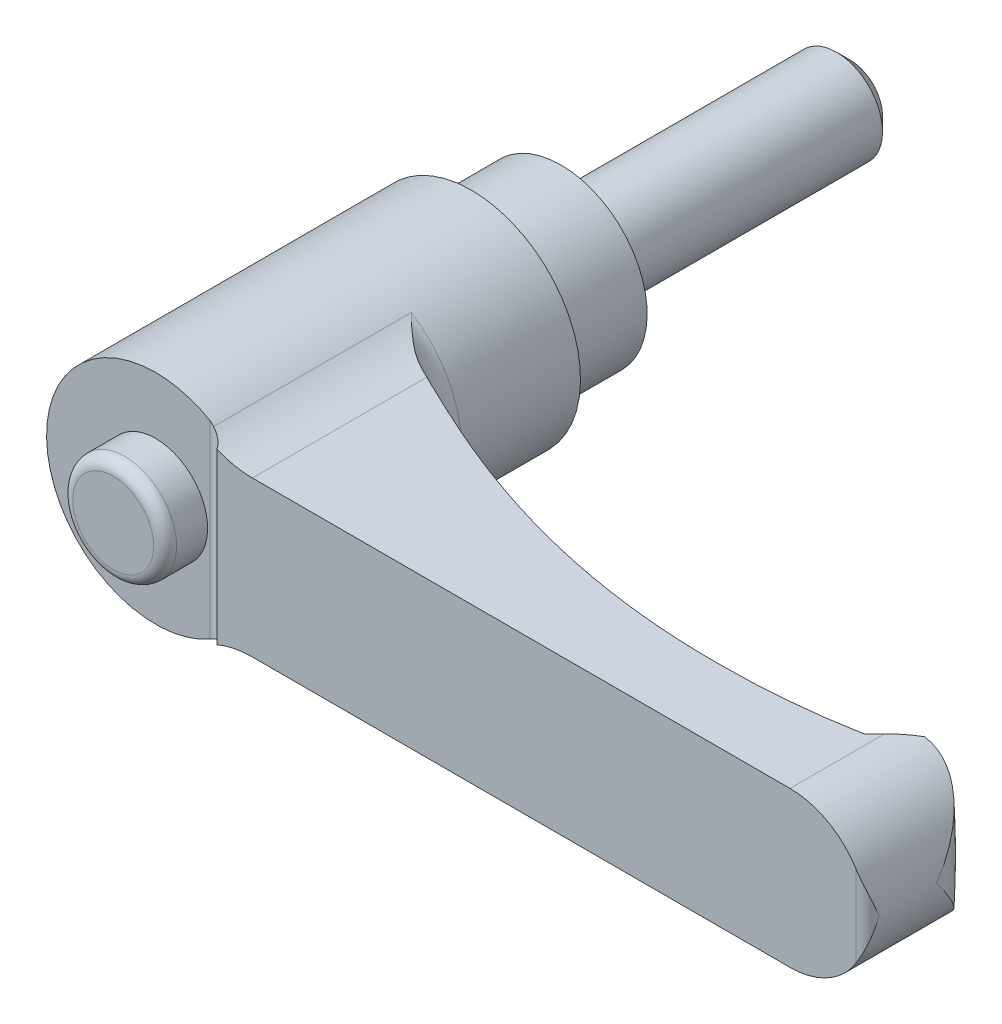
ISO-10303-21;
HEADER;
FILE_DESCRIPTION(('STEP AP214'),'2;1');
FILE_NAME('part.step','',(''),(''),'','','');
FILE_SCHEMA(('AUTOMOTIVE_DESIGN { 1 0 10303 214 1 1 1 1 }'));
ENDSEC;
DATA;
#1=APPLICATION_CONTEXT('core data for automotive mechanical design processes');
#2=APPLICATION_PROTOCOL_DEFINITION('international standard','automotive_design',2000,#1);
#3=PRODUCT_CONTEXT('',#1,'mechanical');
#4=PRODUCT('Part','Part','',(#3));
#5=PRODUCT_RELATED_PRODUCT_CATEGORY('part','',(#4));
#6=PRODUCT_DEFINITION_FORMATION('','',#4);
#7=PRODUCT_DEFINITION_CONTEXT('part definition',#1,'design');
#8=PRODUCT_DEFINITION('design','',#6,#7);
#9=PRODUCT_DEFINITION_SHAPE('','',#8);
#10=(LENGTH_UNIT() NAMED_UNIT(*) SI_UNIT(.MILLI.,.METRE.));
#11=(NAMED_UNIT(*) PLANE_ANGLE_UNIT() SI_UNIT($,.RADIAN.));
#12=(NAMED_UNIT(*) SI_UNIT($,.STERADIAN.) SOLID_ANGLE_UNIT());
#13=UNCERTAINTY_MEASURE_WITH_UNIT(LENGTH_MEASURE(1.E-05),#10,'distance_accuracy_value','');
#14=(GEOMETRIC_REPRESENTATION_CONTEXT(3) GLOBAL_UNCERTAINTY_ASSIGNED_CONTEXT((#13)) GLOBAL_UNIT_ASSIGNED_CONTEXT((#10,
#11,#12)) REPRESENTATION_CONTEXT('',''));
#15=CARTESIAN_POINT('',(0.,0.,0.));
#16=DIRECTION('',(0.,0.,1.));
#17=DIRECTION('',(1.,0.,0.));
#18=AXIS2_PLACEMENT_3D('',#15,#16,#17);
#19=CARTESIAN_POINT('',(6.,0.,0.));
#20=DIRECTION('',(0.,0.,1.));
#21=DIRECTION('',(0.,-1.,0.));
#22=AXIS2_PLACEMENT_3D('',#19,#20,#21);
#23=PLANE('',#22);
#24=CARTESIAN_POINT('',(0.,0.,0.));
#25=DIRECTION('',(0.,0.,-1.));
#26=DIRECTION('',(0.,1.,0.));
#27=AXIS2_PLACEMENT_3D('',#24,#25,#26);
#28=CIRCLE('',#27,4.);
#29=CARTESIAN_POINT('',(0.,4.,0.));
#30=VERTEX_POINT('',#29);
#31=EDGE_CURVE('E423',#30,#30,#28,.T.);
#32=ORIENTED_EDGE('',*,*,#31,.F.);
#33=EDGE_LOOP('',(#32));
#34=FACE_BOUND('',#33,.T.);
#35=CARTESIAN_POINT('',(0.,0.,0.));
#36=DIRECTION('',(0.,0.,-1.));
#37=DIRECTION('',(0.,1.,0.));
#38=AXIS2_PLACEMENT_3D('',#35,#36,#37);
#39=CIRCLE('',#38,6.);
#40=CARTESIAN_POINT('',(0.,6.,0.));
#41=VERTEX_POINT('',#40);
#42=EDGE_CURVE('E347',#41,#41,#39,.T.);
#43=ORIENTED_EDGE('',*,*,#42,.T.);
#44=EDGE_LOOP('',(#43));
#45=FACE_BOUND('',#44,.T.);
#46=ADVANCED_FACE('F14',(#34,#45),#23,.F.);
#47=CARTESIAN_POINT('',(0.,0.,35.5));
#48=DIRECTION('',(0.,0.,-1.));
#49=DIRECTION('',(0.,1.,0.));
#50=AXIS2_PLACEMENT_3D('',#47,#48,#49);
#51=PLANE('',#50);
#52=CARTESIAN_POINT('',(0.,0.,35.5));
#53=DIRECTION('',(0.,0.,-1.));
#54=DIRECTION('',(0.,1.,0.));
#55=AXIS2_PLACEMENT_3D('',#52,#53,#54);
#56=CIRCLE('',#55,9.5);
#57=CARTESIAN_POINT('',(4.75,-8.22724133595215,35.5));
#58=VERTEX_POINT('',#57);
#59=CARTESIAN_POINT('',(4.75,8.22724133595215,35.5));
#60=VERTEX_POINT('',#59);
#61=EDGE_CURVE('E332',#58,#60,#56,.T.);
#62=ORIENTED_EDGE('',*,*,#61,.F.);
#63=DIRECTION('',(0.,1.,0.));
#64=VECTOR('',#63,1.);
#65=CARTESIAN_POINT('',(4.75,-13.5,35.5));
#66=LINE('',#65,#64);
#67=EDGE_CURVE('E383',#58,#60,#66,.T.);
#68=ORIENTED_EDGE('',*,*,#67,.T.);
#69=EDGE_LOOP('',(#62,#68));
#70=FACE_BOUND('',#69,.T.);
#71=CARTESIAN_POINT('',(0.,0.,35.5));
#72=DIRECTION('',(0.,0.,-1.));
#73=DIRECTION('',(0.,1.,0.));
#74=AXIS2_PLACEMENT_3D('',#71,#72,#73);
#75=CIRCLE('',#74,4.52380952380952);
#76=CARTESIAN_POINT('',(0.,4.52380952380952,35.5));
#77=VERTEX_POINT('',#76);
#78=EDGE_CURVE('E183',#77,#77,#75,.F.);
#79=ORIENTED_EDGE('',*,*,#78,.F.);
#80=EDGE_LOOP('',(#79));
#81=FACE_BOUND('',#80,.T.);
#82=ADVANCED_FACE('F158',(#70,#81),#51,.F.);
#83=CARTESIAN_POINT('',(56.25,0.,0.));
#84=DIRECTION('',(0.,0.,1.));
#85=DIRECTION('',(0.,-1.,0.));
#86=AXIS2_PLACEMENT_3D('',#83,#84,#85);
#87=CYLINDRICAL_SURFACE('',#86,6.75);
#88=CARTESIAN_POINT('',(63.,0.,30.5));
#89=CARTESIAN_POINT('',(63.0000000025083,-0.0046874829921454,30.4965903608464));
#90=CARTESIAN_POINT('',(62.9999951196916,-0.0093750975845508,30.4931806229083));
#91=CARTESIAN_POINT('',(62.9990237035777,-0.475524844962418,30.1541065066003));
#92=CARTESIAN_POINT('',(62.9507141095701,-0.938185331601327,29.8175642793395));
#93=CARTESIAN_POINT('',(62.8060463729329,-1.62346497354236,29.3225480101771));
#94=CARTESIAN_POINT('',(62.7456147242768,-1.85084323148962,29.1588881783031));
#95=CARTESIAN_POINT('',(62.6000044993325,-2.30127271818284,28.8365968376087));
#96=CARTESIAN_POINT('',(62.5148384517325,-2.52432607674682,28.6779628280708));
#97=CARTESIAN_POINT('',(62.344804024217,-2.90644000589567,28.4087021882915));
#98=CARTESIAN_POINT('',(62.2657268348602,-3.06692788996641,28.2964051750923));
#99=CARTESIAN_POINT('',(62.0934111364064,-3.38371909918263,28.0768184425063));
#100=CARTESIAN_POINT('',(62.0001726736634,-3.5400224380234,27.9695287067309));
#101=CARTESIAN_POINT('',(61.7993668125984,-3.84715615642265,27.7614384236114));
#102=CARTESIAN_POINT('',(61.6918275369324,-3.99799655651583,27.6606257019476));
#103=CARTESIAN_POINT('',(61.4620426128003,-4.29326696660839,27.4668757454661));
#104=CARTESIAN_POINT('',(61.3398014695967,-4.43769892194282,27.3739361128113));
#105=CARTESIAN_POINT('',(61.0188552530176,-4.78536684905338,27.1560724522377));
#106=CARTESIAN_POINT('',(60.8112818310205,-4.9842025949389,27.0367418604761));
#107=CARTESIAN_POINT('',(60.4758984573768,-5.26551240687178,26.8795376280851));
#108=CARTESIAN_POINT('',(60.3601030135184,-5.35645651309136,26.8307690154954));
#109=CARTESIAN_POINT('',(60.1206554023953,-5.53195453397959,26.7416778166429));
#110=CARTESIAN_POINT('',(59.997005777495,-5.61651049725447,26.7013525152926));
#111=CARTESIAN_POINT('',(59.7699445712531,-5.76076929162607,26.6381973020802));
#112=CARTESIAN_POINT('',(59.667954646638,-5.82188686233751,26.6134697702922));
#113=CARTESIAN_POINT('',(59.4598154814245,-5.93917869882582,26.5707512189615));
#114=CARTESIAN_POINT('',(59.3536672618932,-5.99535416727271,26.5527585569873));
#115=CARTESIAN_POINT('',(59.1377410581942,-6.10229132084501,26.5242546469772));
#116=CARTESIAN_POINT('',(59.0279645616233,-6.15305518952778,26.5137403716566));
#117=CARTESIAN_POINT('',(58.8054681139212,-6.24873887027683,26.5009304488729));
#118=CARTESIAN_POINT('',(58.6927495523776,-6.29366138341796,26.4986309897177));
#119=CARTESIAN_POINT('',(58.4641163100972,-6.37770798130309,26.502966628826));
#120=CARTESIAN_POINT('',(58.3481815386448,-6.41677354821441,26.5096859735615));
#121=CARTESIAN_POINT('',(58.1152313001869,-6.48831686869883,26.5328398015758));
#122=CARTESIAN_POINT('',(57.9982157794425,-6.52079429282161,26.5492747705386));
#123=CARTESIAN_POINT('',(57.7644328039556,-6.57901960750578,26.5923251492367));
#124=CARTESIAN_POINT('',(57.6476652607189,-6.60477054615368,26.618935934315));
#125=CARTESIAN_POINT('',(57.41573023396,-6.64962508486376,26.6826067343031));
#126=CARTESIAN_POINT('',(57.3005622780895,-6.66873068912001,26.7196635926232));
#127=CARTESIAN_POINT('',(57.104290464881,-6.69624244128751,26.7926929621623));
#128=CARTESIAN_POINT('',(57.0224673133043,-6.70614558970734,26.8262017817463));
#129=CARTESIAN_POINT('',(56.8609556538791,-6.72278366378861,26.8986767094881));
#130=CARTESIAN_POINT('',(56.781266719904,-6.72951922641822,26.9376417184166));
#131=CARTESIAN_POINT('',(56.624433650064,-6.74006528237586,27.0209540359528));
#132=CARTESIAN_POINT('',(56.5472927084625,-6.74387222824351,27.0653077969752));
#133=CARTESIAN_POINT('',(56.3961054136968,-6.74884425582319,27.1591719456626));
#134=CARTESIAN_POINT('',(56.3220596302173,-6.75000885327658,27.2086832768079));
#135=CARTESIAN_POINT('',(56.2498,-6.74999999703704,27.2606710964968));
#136=B_SPLINE_CURVE_WITH_KNOTS('',3,(#88,#89,#90,#91,#92,#93,#94,#95,#96,#97,#98,#99,#100,#101,
#102,#103,#104,#105,#106,#107,#108,#109,#110,#111,#112,#113,#114,#115,#116,#117,#118,#119,#120,
#121,#122,#123,#124,#125,#126,#127,#128,#129,#130,#131,#132,#133,#134,#135),.UNSPECIFIED.,.F.,
.F.,(4,2,2,2,2,2,2,2,2,2,2,2,2,2,2,2,2,2,2,2,2,2,2,4),(0.,0.0173896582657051,1.7292315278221,
2.5882674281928,3.44686895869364,4.08007105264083,4.71327107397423,5.34524382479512,
5.97702340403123,6.9068284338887,7.37170994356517,7.83644173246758,8.20045511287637,
8.56437966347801,8.92815681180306,9.29176514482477,9.65879376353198,10.0258407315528,
10.3927210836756,10.7594906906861,11.0261722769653,11.2928002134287,11.5597506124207,
11.8267499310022),.UNSPECIFIED.);
#137=CARTESIAN_POINT('',(58.6622222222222,-6.30425919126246,26.5));
#138=VERTEX_POINT('',#137);
#139=CARTESIAN_POINT('',(63.,0.,30.5));
#140=VERTEX_POINT('',#139);
#141=EDGE_CURVE('E126',#138,#140,#136,.F.);
#142=ORIENTED_EDGE('',*,*,#141,.T.);
#143=CARTESIAN_POINT('',(63.,0.,30.5));
#144=CARTESIAN_POINT('',(63.0000000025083,0.00468748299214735,30.4965903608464));
#145=CARTESIAN_POINT('',(62.9999951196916,0.00937509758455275,30.4931806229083));
#146=CARTESIAN_POINT('',(62.9990237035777,0.47552484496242,30.1541065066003));
#147=CARTESIAN_POINT('',(62.9507141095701,0.938185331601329,29.8175642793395));
#148=CARTESIAN_POINT('',(62.8060463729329,1.62346497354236,29.3225480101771));
#149=CARTESIAN_POINT('',(62.7456147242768,1.85084323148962,29.1588881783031));
#150=CARTESIAN_POINT('',(62.6000044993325,2.30127271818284,28.8365968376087));
#151=CARTESIAN_POINT('',(62.5148384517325,2.52432607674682,28.6779628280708));
#152=CARTESIAN_POINT('',(62.344804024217,2.90644000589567,28.4087021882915));
#153=CARTESIAN_POINT('',(62.2657268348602,3.06692788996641,28.2964051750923));
#154=CARTESIAN_POINT('',(62.0934111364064,3.38371909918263,28.0768184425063));
#155=CARTESIAN_POINT('',(62.0001726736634,3.5400224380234,27.9695287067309));
#156=CARTESIAN_POINT('',(61.7993668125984,3.84715615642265,27.7614384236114));
#157=CARTESIAN_POINT('',(61.6918275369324,3.99799655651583,27.6606257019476));
#158=CARTESIAN_POINT('',(61.4620426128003,4.29326696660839,27.4668757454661));
#159=CARTESIAN_POINT('',(61.3398014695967,4.43769892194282,27.3739361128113));
#160=CARTESIAN_POINT('',(61.0188552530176,4.78536684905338,27.1560724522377));
#161=CARTESIAN_POINT('',(60.8112818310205,4.9842025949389,27.0367418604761));
#162=CARTESIAN_POINT('',(60.4758984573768,5.26551240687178,26.8795376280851));
#163=CARTESIAN_POINT('',(60.3601030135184,5.35645651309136,26.8307690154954));
#164=CARTESIAN_POINT('',(60.1206554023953,5.53195453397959,26.7416778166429));
#165=CARTESIAN_POINT('',(59.997005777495,5.61651049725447,26.7013525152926));
#166=CARTESIAN_POINT('',(59.7699445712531,5.76076929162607,26.6381973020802));
#167=CARTESIAN_POINT('',(59.667954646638,5.82188686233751,26.6134697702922));
#168=CARTESIAN_POINT('',(59.4598154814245,5.93917869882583,26.5707512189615));
#169=CARTESIAN_POINT('',(59.3536672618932,5.99535416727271,26.5527585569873));
#170=CARTESIAN_POINT('',(59.1377410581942,6.10229132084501,26.5242546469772));
#171=CARTESIAN_POINT('',(59.0279645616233,6.15305518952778,26.5137403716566));
#172=CARTESIAN_POINT('',(58.8054681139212,6.24873887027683,26.5009304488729));
#173=CARTESIAN_POINT('',(58.6927495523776,6.29366138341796,26.4986309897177));
#174=CARTESIAN_POINT('',(58.4641163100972,6.37770798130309,26.502966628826));
#175=CARTESIAN_POINT('',(58.3481815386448,6.41677354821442,26.5096859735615));
#176=CARTESIAN_POINT('',(58.1152313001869,6.48831686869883,26.5328398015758));
#177=CARTESIAN_POINT('',(57.9982157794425,6.52079429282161,26.5492747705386));
#178=CARTESIAN_POINT('',(57.7644328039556,6.57901960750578,26.5923251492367));
#179=CARTESIAN_POINT('',(57.6476652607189,6.60477054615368,26.618935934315));
#180=CARTESIAN_POINT('',(57.41573023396,6.64962508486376,26.6826067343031));
#181=CARTESIAN_POINT('',(57.3005622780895,6.66873068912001,26.7196635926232));
#182=CARTESIAN_POINT('',(57.1042904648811,6.69624244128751,26.7926929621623));
#183=CARTESIAN_POINT('',(57.0224673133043,6.70614558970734,26.8262017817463));
#184=CARTESIAN_POINT('',(56.8609556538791,6.72278366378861,26.8986767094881));
#185=CARTESIAN_POINT('',(56.781266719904,6.72951922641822,26.9376417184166));
#186=CARTESIAN_POINT('',(56.624433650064,6.74006528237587,27.0209540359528));
#187=CARTESIAN_POINT('',(56.5472927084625,6.74387222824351,27.0653077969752));
#188=CARTESIAN_POINT('',(56.3961054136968,6.74884425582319,27.1591719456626));
#189=CARTESIAN_POINT('',(56.3220596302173,6.75000885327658,27.2086832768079));
#190=CARTESIAN_POINT('',(56.2498,6.74999999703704,27.2606710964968));
#191=B_SPLINE_CURVE_WITH_KNOTS('',3,(#143,#144,#145,#146,#147,#148,#149,#150,#151,#152,#153,
#154,#155,#156,#157,#158,#159,#160,#161,#162,#163,#164,#165,#166,#167,#168,#169,#170,#171,#172,
#173,#174,#175,#176,#177,#178,#179,#180,#181,#182,#183,#184,#185,#186,#187,#188,#189,#190),
.UNSPECIFIED.,.F.,.F.,(4,2,2,2,2,2,2,2,2,2,2,2,2,2,2,2,2,2,2,2,2,2,2,4),(0.,0.0173896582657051,
1.7292315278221,2.5882674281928,3.44686895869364,4.08007105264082,4.71327107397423,
5.34524382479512,5.97702340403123,6.9068284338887,7.37170994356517,7.83644173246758,
8.20045511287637,8.56437966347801,8.92815681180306,9.29176514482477,9.65879376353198,
10.0258407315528,10.3927210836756,10.7594906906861,11.0261722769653,11.2928002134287,
11.5597506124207,11.8267499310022),.UNSPECIFIED.);
#192=CARTESIAN_POINT('',(58.6622222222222,6.30425919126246,26.5));
#193=VERTEX_POINT('',#192);
#194=EDGE_CURVE('E123',#140,#193,#191,.T.);
#195=ORIENTED_EDGE('',*,*,#194,.T.);
#196=CARTESIAN_POINT('',(56.25,0.,26.5));
#197=DIRECTION('',(0.,0.,-1.));
#198=DIRECTION('',(0.,1.,0.));
#199=AXIS2_PLACEMENT_3D('',#196,#197,#198);
#200=CIRCLE('',#199,6.75);
#201=CARTESIAN_POINT('',(58.,6.51920240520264,26.5));
#202=VERTEX_POINT('',#201);
#203=EDGE_CURVE('E308',#193,#202,#200,.F.);
#204=ORIENTED_EDGE('',*,*,#203,.T.);
#205=CARTESIAN_POINT('',(56.25,0.,28.25));
#206=DIRECTION('',(-0.707106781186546,0.,-0.70710678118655));
#207=DIRECTION('',(-0.70710678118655,0.,0.707106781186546));
#208=AXIS2_PLACEMENT_3D('',#205,#206,#207);
#209=ELLIPSE('',#208,9.54594154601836,6.75);
#210=CARTESIAN_POINT('',(56.25,6.75,28.25));
#211=VERTEX_POINT('',#210);
#212=EDGE_CURVE('E374',#202,#211,#209,.F.);
#213=ORIENTED_EDGE('',*,*,#212,.T.);
#214=DIRECTION('',(0.,0.,1.));
#215=VECTOR('',#214,1.);
#216=CARTESIAN_POINT('',(56.25,6.75,0.));
#217=LINE('',#216,#215);
#218=CARTESIAN_POINT('',(56.25,6.75,36.5));
#219=VERTEX_POINT('',#218);
#220=EDGE_CURVE('E330',#211,#219,#217,.T.);
#221=ORIENTED_EDGE('',*,*,#220,.T.);
#222=CARTESIAN_POINT('',(56.25,0.,36.5));
#223=DIRECTION('',(0.,0.,1.));
#224=DIRECTION('',(0.,-1.,0.));
#225=AXIS2_PLACEMENT_3D('',#222,#223,#224);
#226=CIRCLE('',#225,6.75);
#227=CARTESIAN_POINT('',(62.,3.53553390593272,36.5));
#228=VERTEX_POINT('',#227);
#229=EDGE_CURVE('E322',#228,#219,#226,.T.);
#230=ORIENTED_EDGE('',*,*,#229,.F.);
#231=CARTESIAN_POINT('',(62.,3.53553390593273,36.5));
#232=CARTESIAN_POINT('',(62.0299932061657,3.48675666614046,36.4999933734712));
#233=CARTESIAN_POINT('',(62.0593538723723,3.43761273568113,36.4986515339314));
#234=CARTESIAN_POINT('',(62.1167538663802,3.33870692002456,36.4935798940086));
#235=CARTESIAN_POINT('',(62.1447937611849,3.28894531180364,36.489851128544));
#236=CARTESIAN_POINT('',(62.2267562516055,3.13908056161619,36.4755285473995));
#237=CARTESIAN_POINT('',(62.2786643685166,3.03816514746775,36.4617957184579));
#238=CARTESIAN_POINT('',(62.3766467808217,2.83536966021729,36.4277987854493));
#239=CARTESIAN_POINT('',(62.4227515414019,2.73349792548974,36.4075709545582));
#240=CARTESIAN_POINT('',(62.509502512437,2.52854152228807,36.3618646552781));
#241=CARTESIAN_POINT('',(62.550144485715,2.42545597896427,36.3363821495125));
#242=CARTESIAN_POINT('',(62.6493297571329,2.15471359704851,36.2642737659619));
#243=CARTESIAN_POINT('',(62.7035065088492,1.98634279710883,36.2142841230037));
#244=CARTESIAN_POINT('',(62.7980553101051,1.64812969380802,36.1068184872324));
#245=CARTESIAN_POINT('',(62.8384218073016,1.4782868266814,36.0493394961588));
#246=CARTESIAN_POINT('',(62.9057483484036,1.1374266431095,35.9293690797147));
#247=CARTESIAN_POINT('',(62.9326868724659,0.966407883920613,35.8668697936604));
#248=CARTESIAN_POINT('',(62.9733111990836,0.623942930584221,35.7390768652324));
#249=CARTESIAN_POINT('',(62.9870036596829,0.452496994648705,35.6737846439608));
#250=CARTESIAN_POINT('',(62.997837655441,0.192449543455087,35.5740662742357));
#251=CARTESIAN_POINT('',(62.999781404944,0.103891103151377,35.539987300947));
#252=CARTESIAN_POINT('',(62.9999941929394,0.0102233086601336,35.5039349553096));
#253=CARTESIAN_POINT('',(62.9999999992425,0.00511164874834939,35.5019674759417));
#254=CARTESIAN_POINT('',(63.,0.,35.5));
#255=B_SPLINE_CURVE_WITH_KNOTS('',3,(#231,#232,#233,#234,#235,#236,#237,#238,#239,#240,#241,
#242,#243,#244,#245,#246,#247,#248,#249,#250,#251,#252,#253,#254),.UNSPECIFIED.,.F.,.F.,(4,2,2,
2,2,2,2,2,2,2,2,4),(0.,0.171732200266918,0.343389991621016,0.685890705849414,1.02651095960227,
1.36739390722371,1.91796289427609,2.46875297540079,3.02042294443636,3.57181547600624,
3.85648313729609,3.87291482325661),.UNSPECIFIED.);
#256=CARTESIAN_POINT('',(63.,0.,35.5));
#257=VERTEX_POINT('',#256);
#258=EDGE_CURVE('E169',#257,#228,#255,.F.);
#259=ORIENTED_EDGE('',*,*,#258,.F.);
#260=CARTESIAN_POINT('',(62.,-3.53553390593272,36.5));
#261=CARTESIAN_POINT('',(62.0299932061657,-3.48675666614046,36.4999933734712));
#262=CARTESIAN_POINT('',(62.0593538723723,-3.43761273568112,36.4986515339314));
#263=CARTESIAN_POINT('',(62.1167538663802,-3.33870692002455,36.4935798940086));
#264=CARTESIAN_POINT('',(62.1447937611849,-3.28894531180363,36.489851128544));
#265=CARTESIAN_POINT('',(62.2267562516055,-3.13908056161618,36.4755285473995));
#266=CARTESIAN_POINT('',(62.2786643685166,-3.03816514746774,36.4617957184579));
#267=CARTESIAN_POINT('',(62.3766467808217,-2.83536966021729,36.4277987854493));
#268=CARTESIAN_POINT('',(62.4227515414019,-2.73349792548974,36.4075709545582));
#269=CARTESIAN_POINT('',(62.509502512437,-2.52854152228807,36.3618646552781));
#270=CARTESIAN_POINT('',(62.550144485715,-2.42545597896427,36.3363821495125));
#271=CARTESIAN_POINT('',(62.6493297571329,-2.15471359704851,36.2642737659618));
#272=CARTESIAN_POINT('',(62.7035065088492,-1.98634279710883,36.2142841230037));
#273=CARTESIAN_POINT('',(62.7980553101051,-1.64812969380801,36.1068184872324));
#274=CARTESIAN_POINT('',(62.8384218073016,-1.4782868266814,36.0493394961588));
#275=CARTESIAN_POINT('',(62.9057483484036,-1.1374266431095,35.9293690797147));
#276=CARTESIAN_POINT('',(62.9326868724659,-0.966407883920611,35.8668697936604));
#277=CARTESIAN_POINT('',(62.9733111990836,-0.623942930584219,35.7390768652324));
#278=CARTESIAN_POINT('',(62.9870036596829,-0.452496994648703,35.6737846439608));
#279=CARTESIAN_POINT('',(62.997837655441,-0.192449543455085,35.5740662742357));
#280=CARTESIAN_POINT('',(62.999781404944,-0.103891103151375,35.539987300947));
#281=CARTESIAN_POINT('',(62.9999941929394,-0.0102233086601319,35.5039349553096));
#282=CARTESIAN_POINT('',(62.9999999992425,-0.00511164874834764,35.5019674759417));
#283=CARTESIAN_POINT('',(63.,0.,35.5));
#284=B_SPLINE_CURVE_WITH_KNOTS('',3,(#260,#261,#262,#263,#264,#265,#266,#267,#268,#269,#270,
#271,#272,#273,#274,#275,#276,#277,#278,#279,#280,#281,#282,#283),.UNSPECIFIED.,.F.,.F.,(4,2,2,
2,2,2,2,2,2,2,2,4),(0.,0.171732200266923,0.34338999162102,0.685890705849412,1.02651095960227,
1.36739390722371,1.91796289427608,2.46875297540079,3.02042294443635,3.57181547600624,
3.85648313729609,3.8729148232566),.UNSPECIFIED.);
#285=CARTESIAN_POINT('',(62.,-3.53553390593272,36.5));
#286=VERTEX_POINT('',#285);
#287=EDGE_CURVE('E177',#286,#257,#284,.T.);
#288=ORIENTED_EDGE('',*,*,#287,.F.);
#289=CARTESIAN_POINT('',(56.25,-6.75,36.5));
#290=VERTEX_POINT('',#289);
#291=EDGE_CURVE('E310',#290,#286,#226,.T.);
#292=ORIENTED_EDGE('',*,*,#291,.F.);
#293=DIRECTION('',(0.,0.,1.));
#294=VECTOR('',#293,1.);
#295=CARTESIAN_POINT('',(56.25,-6.75,0.));
#296=LINE('',#295,#294);
#297=CARTESIAN_POINT('',(56.25,-6.75,28.25));
#298=VERTEX_POINT('',#297);
#299=EDGE_CURVE('E355',#298,#290,#296,.T.);
#300=ORIENTED_EDGE('',*,*,#299,.F.);
#301=CARTESIAN_POINT('',(58.,-6.51920240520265,26.5));
#302=VERTEX_POINT('',#301);
#303=EDGE_CURVE('E375',#298,#302,#209,.F.);
#304=ORIENTED_EDGE('',*,*,#303,.T.);
#305=EDGE_CURVE('E134',#302,#138,#200,.F.);
#306=ORIENTED_EDGE('',*,*,#305,.T.);
#307=EDGE_LOOP('',(#142,#195,#204,#213,#221,#230,#259,#288,#292,#300,#304,#306));
#308=FACE_BOUND('',#307,.T.);
#309=ADVANCED_FACE('F132',(#308),#87,.T.);
#310=CARTESIAN_POINT('',(59.,-13.5,26.5));
#311=DIRECTION('',(0.,0.,-1.));
#312=DIRECTION('',(0.,1.,0.));
#313=AXIS2_PLACEMENT_3D('',#310,#311,#312);
#314=PLANE('',#313);
#315=ORIENTED_EDGE('',*,*,#203,.F.);
#316=CARTESIAN_POINT('',(0.,0.,26.5));
#317=DIRECTION('',(0.,0.,-1.));
#318=DIRECTION('',(0.,1.,0.));
#319=AXIS2_PLACEMENT_3D('',#316,#317,#318);
#320=CIRCLE('',#319,59.);
#321=EDGE_CURVE('E37',#193,#138,#320,.T.);
#322=ORIENTED_EDGE('',*,*,#321,.T.);
#323=ORIENTED_EDGE('',*,*,#305,.F.);
#324=DIRECTION('',(0.,1.,0.));
#325=VECTOR('',#324,1.);
#326=CARTESIAN_POINT('',(58.,-13.5,26.5));
#327=LINE('',#326,#325);
#328=EDGE_CURVE('E327',#302,#202,#327,.T.);
#329=ORIENTED_EDGE('',*,*,#328,.T.);
#330=EDGE_LOOP('',(#315,#322,#323,#329));
#331=FACE_BOUND('',#330,.T.);
#332=ADVANCED_FACE('F157',(#331),#314,.T.);
#333=CARTESIAN_POINT('',(0.,0.,36.5));
#334=DIRECTION('',(0.,0.,1.));
#335=DIRECTION('',(0.,-1.,0.));
#336=AXIS2_PLACEMENT_3D('',#333,#334,#335);
#337=PLANE('',#336);
#338=CARTESIAN_POINT('',(9.41740410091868,14.75,36.5));
#339=DIRECTION('',(0.,0.,1.));
#340=DIRECTION('',(1.,0.,0.));
#341=AXIS2_PLACEMENT_3D('',#338,#339,#340);
#342=CIRCLE('',#341,8.);
#343=CARTESIAN_POINT('',(6.33333333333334,7.36836688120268,36.5));
#344=VERTEX_POINT('',#343);
#345=CARTESIAN_POINT('',(9.41740410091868,6.75,36.5));
#346=VERTEX_POINT('',#345);
#347=EDGE_CURVE('E369',#344,#346,#342,.T.);
#348=ORIENTED_EDGE('',*,*,#347,.F.);
#349=DIRECTION('',(0.,1.,0.));
#350=VECTOR('',#349,1.);
#351=CARTESIAN_POINT('',(6.33333333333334,-13.5,36.5));
#352=LINE('',#351,#350);
#353=CARTESIAN_POINT('',(6.33333333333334,-7.36836688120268,36.5));
#354=VERTEX_POINT('',#353);
#355=EDGE_CURVE('E326',#354,#344,#352,.T.);
#356=ORIENTED_EDGE('',*,*,#355,.F.);
#357=CARTESIAN_POINT('',(9.41740410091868,-14.75,36.5));
#358=DIRECTION('',(0.,0.,1.));
#359=DIRECTION('',(1.,0.,0.));
#360=AXIS2_PLACEMENT_3D('',#357,#358,#359);
#361=CIRCLE('',#360,8.);
#362=CARTESIAN_POINT('',(9.41740410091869,-6.75,36.5));
#363=VERTEX_POINT('',#362);
#364=EDGE_CURVE('E361',#363,#354,#361,.T.);
#365=ORIENTED_EDGE('',*,*,#364,.F.);
#366=DIRECTION('',(-1.,0.,0.));
#367=VECTOR('',#366,1.);
#368=CARTESIAN_POINT('',(56.25,-6.75,36.5));
#369=LINE('',#368,#367);
#370=EDGE_CURVE('E364',#290,#363,#369,.T.);
#371=ORIENTED_EDGE('',*,*,#370,.F.);
#372=ORIENTED_EDGE('',*,*,#291,.T.);
#373=DIRECTION('',(0.,1.,0.));
#374=VECTOR('',#373,1.);
#375=CARTESIAN_POINT('',(62.,-13.5,36.5));
#376=LINE('',#375,#374);
#377=EDGE_CURVE('E315',#286,#228,#376,.T.);
#378=ORIENTED_EDGE('',*,*,#377,.T.);
#379=ORIENTED_EDGE('',*,*,#229,.T.);
#380=DIRECTION('',(1.,0.,0.));
#381=VECTOR('',#380,1.);
#382=CARTESIAN_POINT('',(9.41740410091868,6.75,36.5));
#383=LINE('',#382,#381);
#384=EDGE_CURVE('E367',#346,#219,#383,.T.);
#385=ORIENTED_EDGE('',*,*,#384,.F.);
#386=EDGE_LOOP('',(#348,#356,#365,#371,#372,#378,#379,#385));
#387=FACE_BOUND('',#386,.T.);
#388=ADVANCED_FACE('F240',(#387),#337,.T.);
#389=CARTESIAN_POINT('',(0.,0.,0.));
#390=DIRECTION('',(0.,0.,-1.));
#391=DIRECTION('',(0.,1.,0.));
#392=AXIS2_PLACEMENT_3D('',#389,#390,#391);
#393=CYLINDRICAL_SURFACE('',#392,9.5);
#394=CARTESIAN_POINT('',(0.,0.,18.3481601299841));
#395=DIRECTION('',(0.,0.,-1.));
#396=DIRECTION('',(0.,1.,0.));
#397=AXIS2_PLACEMENT_3D('',#394,#395,#396);
#398=CIRCLE('',#397,9.5);
#399=CARTESIAN_POINT('',(5.11230508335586,8.00714285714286,18.3481601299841));
#400=VERTEX_POINT('',#399);
#401=CARTESIAN_POINT('',(5.11230508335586,-8.00714285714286,18.3481601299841));
#402=VERTEX_POINT('',#401);
#403=EDGE_CURVE('E413',#400,#402,#398,.T.);
#404=ORIENTED_EDGE('',*,*,#403,.T.);
#405=DIRECTION('',(0.,0.,1.));
#406=VECTOR('',#405,1.);
#407=CARTESIAN_POINT('',(5.11230508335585,-8.00714285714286,0.));
#408=LINE('',#407,#406);
#409=CARTESIAN_POINT('',(5.11230508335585,-8.00714285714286,35.5614827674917));
#410=VERTEX_POINT('',#409);
#411=EDGE_CURVE('E359',#402,#410,#408,.T.);
#412=ORIENTED_EDGE('',*,*,#411,.T.);
#413=CARTESIAN_POINT('',(4.75,-8.22724133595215,35.5));
#414=CARTESIAN_POINT('',(4.82354897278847,-8.18479174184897,35.5056127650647));
#415=CARTESIAN_POINT('',(4.89626028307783,-8.1414834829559,35.5152432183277));
#416=CARTESIAN_POINT('',(5.03945202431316,-8.05362753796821,35.5421901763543));
#417=CARTESIAN_POINT('',(5.10993308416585,-8.00908020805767,35.5595044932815));
#418=CARTESIAN_POINT('',(5.24861636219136,-7.91889687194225,35.6016146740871));
#419=CARTESIAN_POINT('',(5.31680005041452,-7.87325555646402,35.6264601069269));
#420=CARTESIAN_POINT('',(5.44990684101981,-7.7817124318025,35.6832973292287));
#421=CARTESIAN_POINT('',(5.51483003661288,-7.7358106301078,35.7152889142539));
#422=CARTESIAN_POINT('',(5.69141984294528,-7.6077148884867,35.8145402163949));
#423=CARTESIAN_POINT('',(5.79903338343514,-7.52579740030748,35.8895684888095));
#424=CARTESIAN_POINT('',(5.99917718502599,-7.36722875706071,36.0610902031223));
#425=CARTESIAN_POINT('',(6.09178179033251,-7.29055280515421,36.157471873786));
#426=CARTESIAN_POINT('',(6.20382113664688,-7.19472379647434,36.3011658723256));
#427=CARTESIAN_POINT('',(6.23139044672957,-7.17084441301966,36.33916914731));
#428=CARTESIAN_POINT('',(6.28417716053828,-7.12462925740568,36.4176957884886));
#429=CARTESIAN_POINT('',(6.30939340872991,-7.1022942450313,36.4582203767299));
#430=CARTESIAN_POINT('',(6.33333333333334,-7.08088192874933,36.5));
#431=B_SPLINE_CURVE_WITH_KNOTS('',3,(#413,#414,#415,#416,#417,#418,#419,#420,#421,#422,#423,
#424,#425,#426,#427,#428,#429,#430),.UNSPECIFIED.,.F.,.F.,(4,2,2,2,2,2,2,2,4),(0.,
0.25516766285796,0.510262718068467,0.767074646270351,1.02387922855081,1.48566336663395,
1.94508518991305,2.10299549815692,2.26098294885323),.UNSPECIFIED.);
#432=EDGE_CURVE('E214',#58,#410,#431,.T.);
#433=ORIENTED_EDGE('',*,*,#432,.F.);
#434=ORIENTED_EDGE('',*,*,#61,.T.);
#435=CARTESIAN_POINT('',(6.33333333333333,7.08088192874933,36.5));
#436=CARTESIAN_POINT('',(6.30193651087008,7.10896982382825,36.4452145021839));
#437=CARTESIAN_POINT('',(6.26833956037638,7.13863883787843,36.3925689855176));
#438=CARTESIAN_POINT('',(6.19723055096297,7.20045324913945,36.2916619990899));
#439=CARTESIAN_POINT('',(6.15972345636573,7.23259549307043,36.243395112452));
#440=CARTESIAN_POINT('',(6.08131079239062,7.2986494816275,36.1513438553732));
#441=CARTESIAN_POINT('',(6.04041526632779,7.33255589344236,36.1075470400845));
#442=CARTESIAN_POINT('',(5.95546899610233,7.40171574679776,36.0242830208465));
#443=CARTESIAN_POINT('',(5.91141716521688,7.4369696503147,35.9848173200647));
#444=CARTESIAN_POINT('',(5.7754647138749,7.54368484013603,35.8733623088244));
#445=CARTESIAN_POINT('',(5.67929205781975,7.61650473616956,35.8077657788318));
#446=CARTESIAN_POINT('',(5.47750803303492,7.76289095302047,35.6942705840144));
#447=CARTESIAN_POINT('',(5.37189158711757,7.83645765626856,35.6463815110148));
#448=CARTESIAN_POINT('',(5.1806466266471,7.96370194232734,35.5790108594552));
#449=CARTESIAN_POINT('',(5.09668204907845,8.01772299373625,35.5554125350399));
#450=CARTESIAN_POINT('',(4.92555498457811,8.12398585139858,35.5192948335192));
#451=CARTESIAN_POINT('',(4.83839896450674,8.17623088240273,35.5067542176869));
#452=CARTESIAN_POINT('',(4.75,8.22724133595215,35.5));
#453=B_SPLINE_CURVE_WITH_KNOTS('',3,(#435,#436,#437,#438,#439,#440,#441,#442,#443,#444,#445,
#446,#447,#448,#449,#450,#451,#452),.UNSPECIFIED.,.F.,.F.,(4,2,2,2,2,2,2,2,4),(0.,
0.207163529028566,0.414067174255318,0.620378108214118,0.826760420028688,1.23705708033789,
1.64757566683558,1.9547198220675,2.26127274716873),.UNSPECIFIED.);
#454=CARTESIAN_POINT('',(5.11230508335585,8.00714285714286,35.5614827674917));
#455=VERTEX_POINT('',#454);
#456=EDGE_CURVE('E228',#455,#60,#453,.T.);
#457=ORIENTED_EDGE('',*,*,#456,.F.);
#458=DIRECTION('',(0.,0.,1.));
#459=VECTOR('',#458,1.);
#460=CARTESIAN_POINT('',(5.11230508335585,8.00714285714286,0.));
#461=LINE('',#460,#459);
#462=EDGE_CURVE('E350',#400,#455,#461,.T.);
#463=ORIENTED_EDGE('',*,*,#462,.F.);
#464=EDGE_LOOP('',(#404,#412,#433,#434,#457,#463));
#465=FACE_BOUND('',#464,.T.);
#466=CARTESIAN_POINT('',(0.,0.,8.));
#467=DIRECTION('',(0.,0.,-1.));
#468=DIRECTION('',(0.,1.,0.));
#469=AXIS2_PLACEMENT_3D('',#466,#467,#468);
#470=CIRCLE('',#469,9.5);
#471=CARTESIAN_POINT('',(0.,9.5,8.));
#472=VERTEX_POINT('',#471);
#473=EDGE_CURVE('E333',#472,#472,#470,.T.);
#474=ORIENTED_EDGE('',*,*,#473,.F.);
#475=EDGE_LOOP('',(#474));
#476=FACE_BOUND('',#475,.T.);
#477=ADVANCED_FACE('F238',(#465,#476),#393,.T.);
#478=CARTESIAN_POINT('',(9.41740410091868,14.75,0.));
#479=DIRECTION('',(0.,0.,1.));
#480=DIRECTION('',(0.,-1.,0.));
#481=AXIS2_PLACEMENT_3D('',#478,#479,#480);
#482=CYLINDRICAL_SURFACE('',#481,8.);
#483=DIRECTION('',(0.,0.,1.));
#484=VECTOR('',#483,1.);
#485=CARTESIAN_POINT('',(9.41740410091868,6.75,0.));
#486=LINE('',#485,#484);
#487=CARTESIAN_POINT('',(9.41740410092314,6.75,21.3021638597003));
#488=VERTEX_POINT('',#487);
#489=EDGE_CURVE('E352',#488,#346,#486,.T.);
#490=ORIENTED_EDGE('',*,*,#489,.F.);
#491=CARTESIAN_POINT('',(9.41760410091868,6.7500000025,21.3022609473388));
#492=CARTESIAN_POINT('',(9.34663199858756,6.74999859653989,21.2678090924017));
#493=CARTESIAN_POINT('',(9.27552780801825,6.75094090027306,21.2336266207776));
#494=CARTESIAN_POINT('',(9.13312349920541,6.75473540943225,21.1659081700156));
#495=CARTESIAN_POINT('',(9.06182355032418,6.75758629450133,21.1323717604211));
#496=CARTESIAN_POINT('',(8.91899698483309,6.7652204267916,21.066004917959));
#497=CARTESIAN_POINT('',(8.84747036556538,6.77000369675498,21.0331744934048));
#498=CARTESIAN_POINT('',(8.704162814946,6.78153362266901,20.9682923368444));
#499=CARTESIAN_POINT('',(8.63238174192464,6.78828163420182,20.9362411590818));
#500=CARTESIAN_POINT('',(8.56050869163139,6.79602424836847,20.9046385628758));
#501=B_SPLINE_CURVE_WITH_KNOTS('',3,(#491,#492,#493,#494,#495,#496,#497,#498,#499,#500),
.UNSPECIFIED.,.F.,.F.,(4,2,2,2,4),(0.,0.236671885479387,0.473180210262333,0.709691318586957,
0.946365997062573),.UNSPECIFIED.);
#502=CARTESIAN_POINT('',(8.56096354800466,6.79597525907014,20.9048385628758));
#503=VERTEX_POINT('',#502);
#504=EDGE_CURVE('E246',#488,#503,#501,.T.);
#505=ORIENTED_EDGE('',*,*,#504,.T.);
#506=CARTESIAN_POINT('',(8.56141843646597,6.79592629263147,20.9050385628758));
#507=CARTESIAN_POINT('',(8.47420918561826,6.80531273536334,20.8666951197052));
#508=CARTESIAN_POINT('',(8.38798367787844,6.81604134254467,20.8265142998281));
#509=CARTESIAN_POINT('',(8.21753113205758,6.84002445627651,20.7428900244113));
#510=CARTESIAN_POINT('',(8.13330325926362,6.85327788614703,20.6994479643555));
#511=CARTESIAN_POINT('',(7.88393651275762,6.89653514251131,20.5650030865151));
#512=CARTESIAN_POINT('',(7.72171249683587,6.9300806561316,20.4697011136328));
#513=CARTESIAN_POINT('',(7.40583761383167,7.00533652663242,20.2709379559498));
#514=CARTESIAN_POINT('',(7.25214096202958,7.0469964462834,20.1675294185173));
#515=CARTESIAN_POINT('',(6.95163567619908,7.13786246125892,19.9540740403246));
#516=CARTESIAN_POINT('',(6.80483124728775,7.18707308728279,19.8440232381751));
#517=CARTESIAN_POINT('',(6.52235248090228,7.29074005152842,19.6227797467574));
#518=CARTESIAN_POINT('',(6.38647079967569,7.34497015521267,19.5117441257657));
#519=CARTESIAN_POINT('',(6.12012077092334,7.45966750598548,19.286442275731));
#520=CARTESIAN_POINT('',(5.98965290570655,7.5201353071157,19.1721757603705));
#521=CARTESIAN_POINT('',(5.73356790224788,7.64719834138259,18.9415280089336));
#522=CARTESIAN_POINT('',(5.60795285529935,7.71379617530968,18.825145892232));
#523=CARTESIAN_POINT('',(5.36116691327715,7.853115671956,18.5913699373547));
#524=CARTESIAN_POINT('',(5.23999538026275,7.92583645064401,18.4739762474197));
#525=CARTESIAN_POINT('',(5.11800178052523,8.00350824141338,18.3537764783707));
#526=CARTESIAN_POINT('',(5.11515285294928,8.00532465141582,18.3509683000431));
#527=CARTESIAN_POINT('',(5.11230508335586,8.00714285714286,18.3481601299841));
#528=B_SPLINE_CURVE_WITH_KNOTS('',3,(#506,#507,#508,#509,#510,#511,#512,#513,#514,#515,#516,
#517,#518,#519,#520,#521,#522,#523,#524,#525,#526,#527),.UNSPECIFIED.,.F.,.F.,(4,2,2,2,2,2,2,2,
2,2,4),(0.,0.287104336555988,0.574086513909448,1.14672714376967,1.7159158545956,
2.28544744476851,2.83621563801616,3.38703279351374,3.93808473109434,4.48905724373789,
4.50223731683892),.UNSPECIFIED.);
#529=EDGE_CURVE('E393',#503,#400,#528,.T.);
#530=ORIENTED_EDGE('',*,*,#529,.T.);
#531=ORIENTED_EDGE('',*,*,#462,.T.);
#532=CARTESIAN_POINT('',(6.33333333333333,7.36836688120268,36.5));
#533=CARTESIAN_POINT('',(6.30572631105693,7.37990157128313,36.4517939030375));
#534=CARTESIAN_POINT('',(6.27620115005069,7.39241872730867,36.4049318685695));
#535=CARTESIAN_POINT('',(6.21369042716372,7.41942165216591,36.3142041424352));
#536=CARTESIAN_POINT('',(6.18070621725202,7.433906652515,36.2703372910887));
#537=CARTESIAN_POINT('',(6.11180020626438,7.46478219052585,36.1860768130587));
#538=CARTESIAN_POINT('',(6.07589356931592,7.48116305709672,36.1456672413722));
#539=CARTESIAN_POINT('',(6.001409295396,7.51586753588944,36.0683091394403));
#540=CARTESIAN_POINT('',(5.96283154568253,7.53419123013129,36.0313607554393));
#541=CARTESIAN_POINT('',(5.84377892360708,7.59200134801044,35.9260570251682));
#542=CARTESIAN_POINT('',(5.75985492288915,7.63438377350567,35.8630866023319));
#543=CARTESIAN_POINT('',(5.58613979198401,7.72639161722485,35.7523382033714));
#544=CARTESIAN_POINT('',(5.49634385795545,7.77602300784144,35.7045728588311));
#545=CARTESIAN_POINT('',(5.35683601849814,7.85689272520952,35.6430239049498));
#546=CARTESIAN_POINT('',(5.30809845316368,7.88582630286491,35.6238148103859));
#547=CARTESIAN_POINT('',(5.21035384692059,7.94529574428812,35.5895762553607));
#548=CARTESIAN_POINT('',(5.1613480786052,7.975826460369,35.5745342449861));
#549=CARTESIAN_POINT('',(5.11230508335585,8.00714285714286,35.5614827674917));
#550=B_SPLINE_CURVE_WITH_KNOTS('',3,(#532,#533,#534,#535,#536,#537,#538,#539,#540,#541,#542,
#543,#544,#545,#546,#547,#548,#549),.UNSPECIFIED.,.F.,.F.,(4,2,2,2,2,2,2,2,4),(0.,
0.170139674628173,0.340213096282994,0.50945430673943,0.678702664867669,1.01657399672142,
1.35472528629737,1.53411415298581,1.7129567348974),.UNSPECIFIED.);
#551=EDGE_CURVE('E222',#344,#455,#550,.T.);
#552=ORIENTED_EDGE('',*,*,#551,.F.);
#553=ORIENTED_EDGE('',*,*,#347,.T.);
#554=EDGE_LOOP('',(#490,#505,#530,#531,#552,#553));
#555=FACE_BOUND('',#554,.T.);
#556=ADVANCED_FACE('F234',(#555),#482,.F.);
#557=CARTESIAN_POINT('',(9.41740410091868,6.75,0.));
#558=DIRECTION('',(0.,-1.,0.));
#559=DIRECTION('',(1.,0.,0.));
#560=AXIS2_PLACEMENT_3D('',#557,#558,#559);
#561=PLANE('',#560);
#562=CARTESIAN_POINT('',(43.8904150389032,6.75,-32.7854085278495));
#563=DIRECTION('',(0.,-1.,0.));
#564=DIRECTION('',(1.,0.,0.));
#565=AXIS2_PLACEMENT_3D('',#562,#563,#564);
#566=CIRCLE('',#565,63.);
#567=CARTESIAN_POINT('',(43.630890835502,6.75000000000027,30.2140569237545));
#568=VERTEX_POINT('',#567);
#569=CARTESIAN_POINT('',(55.3333333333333,6.75,29.1666666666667));
#570=VERTEX_POINT('',#569);
#571=EDGE_CURVE('E376',#568,#570,#566,.F.);
#572=ORIENTED_EDGE('',*,*,#571,.F.);
#573=CARTESIAN_POINT('',(31.7211018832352,6.75,29.163677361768));
#574=CARTESIAN_POINT('',(30.4815814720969,6.75,28.9394124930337));
#575=CARTESIAN_POINT('',(29.248337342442,6.75,28.6800208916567));
#576=CARTESIAN_POINT('',(26.798292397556,6.75,28.093381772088));
#577=CARTESIAN_POINT('',(25.5814894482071,6.75,27.7661431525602));
#578=CARTESIAN_POINT('',(23.7726077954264,6.75,27.2275084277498));
#579=CARTESIAN_POINT('',(23.1732161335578,6.75,27.0403034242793));
#580=CARTESIAN_POINT('',(21.9794838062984,6.75,26.6504397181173));
#581=CARTESIAN_POINT('',(21.3851430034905,6.75,26.4477814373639));
#582=CARTESIAN_POINT('',(20.20172109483,6.75,26.027681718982));
#583=CARTESIAN_POINT('',(19.6126399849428,6.75,25.8102402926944));
#584=CARTESIAN_POINT('',(18.4398233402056,6.75,25.3614109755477));
#585=CARTESIAN_POINT('',(17.8560877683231,6.75,25.1300231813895));
#586=CARTESIAN_POINT('',(16.8264520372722,6.75,24.7086305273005));
#587=CARTESIAN_POINT('',(16.3794839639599,6.75,24.5212256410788));
#588=CARTESIAN_POINT('',(15.4885644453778,6.75,24.1393775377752));
#589=CARTESIAN_POINT('',(15.0446130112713,6.75,23.9449342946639));
#590=CARTESIAN_POINT('',(14.1595159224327,6.75,23.5498036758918));
#591=CARTESIAN_POINT('',(13.7183701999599,6.75,23.3491164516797));
#592=CARTESIAN_POINT('',(12.8384969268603,6.75,22.9425083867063));
#593=CARTESIAN_POINT('',(12.3997694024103,6.75,22.7365874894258));
#594=CARTESIAN_POINT('',(11.5213847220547,6.75,22.3195357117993));
#595=CARTESIAN_POINT('',(11.0817393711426,6.75,22.1083800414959));
#596=CARTESIAN_POINT('',(10.2034650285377,6.75,21.6840048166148));
#597=CARTESIAN_POINT('',(9.76483601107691,6.75,21.4707853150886));
#598=CARTESIAN_POINT('',(8.88741279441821,6.75,21.0449308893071));
#599=CARTESIAN_POINT('',(8.4486186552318,6.75,20.832295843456));
#600=CARTESIAN_POINT('',(7.7888040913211,6.75,20.5166390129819));
#601=CARTESIAN_POINT('',(7.56857842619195,6.75,20.4119614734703));
#602=CARTESIAN_POINT('',(7.12729129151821,6.75,20.2043820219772));
#603=CARTESIAN_POINT('',(6.90622982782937,6.75,20.1014800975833));
#604=CARTESIAN_POINT('',(6.48691851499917,6.75,19.9092503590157));
#605=CARTESIAN_POINT('',(6.28878981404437,6.75,19.8196589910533));
#606=CARTESIAN_POINT('',(5.89131318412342,6.75,19.6432260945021));
#607=CARTESIAN_POINT('',(5.69196528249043,6.75,19.5563845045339));
#608=CARTESIAN_POINT('',(5.29178648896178,6.75,19.3863184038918));
#609=CARTESIAN_POINT('',(5.09095599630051,6.75,19.3030929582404));
#610=CARTESIAN_POINT('',(4.68744730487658,6.75,19.1412674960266));
#611=CARTESIAN_POINT('',(4.48476921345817,6.75,19.0626672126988));
#612=CARTESIAN_POINT('',(4.07928382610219,6.75,18.9120884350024));
#613=CARTESIAN_POINT('',(3.87649877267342,6.75,18.8400507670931));
#614=CARTESIAN_POINT('',(3.46854334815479,6.75,18.7031281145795));
#615=CARTESIAN_POINT('',(3.26337283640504,6.75,18.6382435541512));
#616=CARTESIAN_POINT('',(2.64418711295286,6.75,18.4568464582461));
#617=CARTESIAN_POINT('',(2.22603982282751,6.75,18.3534128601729));
#618=CARTESIAN_POINT('',(1.65420364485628,6.75,18.2467177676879));
#619=CARTESIAN_POINT('',(1.50442360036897,6.75,18.2219398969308));
#620=CARTESIAN_POINT('',(1.20392315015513,6.75,18.1790422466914));
#621=CARTESIAN_POINT('',(1.05320291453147,6.75,18.1609212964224));
#622=CARTESIAN_POINT('',(0.751090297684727,6.75,18.1317837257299));
#623=CARTESIAN_POINT('',(0.599697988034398,6.75,18.1207663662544));
#624=CARTESIAN_POINT('',(0.296553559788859,6.75,18.1061196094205));
#625=CARTESIAN_POINT('',(0.144801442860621,6.75,18.1024901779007));
#626=CARTESIAN_POINT('',(-0.159091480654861,6.75,18.1027184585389));
#627=CARTESIAN_POINT('',(-0.311232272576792,6.75,18.1065956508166));
#628=CARTESIAN_POINT('',(-0.615143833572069,6.75,18.121770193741));
#629=CARTESIAN_POINT('',(-0.766914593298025,6.75,18.1330677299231));
#630=CARTESIAN_POINT('',(-1.06969262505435,6.75,18.1627811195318));
#631=CARTESIAN_POINT('',(-1.220700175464,6.75,18.1811941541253));
#632=CARTESIAN_POINT('',(-1.5217232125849,6.75,18.2246820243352));
#633=CARTESIAN_POINT('',(-1.67173881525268,6.75,18.2497560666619));
#634=CARTESIAN_POINT('',(-2.07224275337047,6.75,18.3251477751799));
#635=CARTESIAN_POINT('',(-2.32169003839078,6.75,18.381037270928));
#636=CARTESIAN_POINT('',(-2.81697540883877,6.75,18.507138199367));
#637=CARTESIAN_POINT('',(-3.06281183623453,6.75,18.5773560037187));
#638=CARTESIAN_POINT('',(-3.55135994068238,6.75,18.7293420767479));
#639=CARTESIAN_POINT('',(-3.79406482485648,6.75,18.8111319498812));
#640=CARTESIAN_POINT('',(-4.27623455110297,6.75,18.9835884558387));
#641=CARTESIAN_POINT('',(-4.51569977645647,6.75,19.0742540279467));
#642=CARTESIAN_POINT('',(-4.99367008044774,6.75,19.2630221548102));
#643=CARTESIAN_POINT('',(-5.23215559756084,6.75,19.3611738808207));
#644=CARTESIAN_POINT('',(-5.70695626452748,6.75,19.5625758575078));
#645=CARTESIAN_POINT('',(-5.94327137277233,6.75,19.6658262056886));
#646=CARTESIAN_POINT('',(-6.41402120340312,6.75,19.8759260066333));
#647=CARTESIAN_POINT('',(-6.64845749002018,6.75,19.9827719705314));
#648=CARTESIAN_POINT('',(-7.11612805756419,6.75,20.199046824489));
#649=CARTESIAN_POINT('',(-7.34936235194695,6.75,20.3084756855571));
#650=CARTESIAN_POINT('',(-7.820481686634,6.75,20.5316181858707));
#651=CARTESIAN_POINT('',(-8.05834758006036,6.75,20.6453721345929));
#652=CARTESIAN_POINT('',(-8.53358360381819,6.75,20.8739082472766));
#653=CARTESIAN_POINT('',(-8.77095373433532,6.75,20.9886904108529));
#654=CARTESIAN_POINT('',(-9.48285175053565,6.75,21.3336726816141));
#655=CARTESIAN_POINT('',(-9.95708901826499,6.75,21.5644709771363));
#656=CARTESIAN_POINT('',(-10.904589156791,6.75,22.0230894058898));
#657=CARTESIAN_POINT('',(-11.3778479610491,6.75,22.2509179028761));
#658=CARTESIAN_POINT('',(-12.3264717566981,6.75,22.702156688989));
#659=CARTESIAN_POINT('',(-12.8018367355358,6.75,22.9255670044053));
#660=CARTESIAN_POINT('',(-13.7472574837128,6.75,23.3624658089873));
#661=CARTESIAN_POINT('',(-14.217264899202,6.75,23.5760586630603));
#662=CARTESIAN_POINT('',(-15.160466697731,6.75,23.9960838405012));
#663=CARTESIAN_POINT('',(-15.6336610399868,6.75,24.2025162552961));
#664=CARTESIAN_POINT('',(-16.5835181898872,6.75,24.6072968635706));
#665=CARTESIAN_POINT('',(-17.0601810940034,6.75,24.8056448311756));
#666=CARTESIAN_POINT('',(-18.0170761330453,6.75,25.1935214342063));
#667=CARTESIAN_POINT('',(-18.4973082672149,6.75,25.3830500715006));
#668=CARTESIAN_POINT('',(-19.9446532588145,6.75,25.9379698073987));
#669=CARTESIAN_POINT('',(-20.9172563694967,6.75,26.2891978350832));
#670=CARTESIAN_POINT('',(-22.8764349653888,6.75,26.9503282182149));
#671=CARTESIAN_POINT('',(-23.8630106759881,6.75,27.2602299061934));
#672=CARTESIAN_POINT('',(-25.8434483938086,6.75,27.8346774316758));
#673=CARTESIAN_POINT('',(-26.8372408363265,6.75,28.0994625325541));
#674=CARTESIAN_POINT('',(-28.8357706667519,6.75,28.5839273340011));
#675=CARTESIAN_POINT('',(-29.8405080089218,6.75,28.8036072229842));
#676=CARTESIAN_POINT('',(-31.8589765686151,6.75,29.1964952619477));
#677=CARTESIAN_POINT('',(-32.8727072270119,6.75,29.3697062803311));
#678=CARTESIAN_POINT('',(-34.9071605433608,6.75,29.6686480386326));
#679=CARTESIAN_POINT('',(-35.9278832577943,6.75,29.7943783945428));
#680=CARTESIAN_POINT('',(-37.9963261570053,6.75,29.9997968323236));
#681=CARTESIAN_POINT('',(-39.0441517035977,6.75,30.0784270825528));
#682=CARTESIAN_POINT('',(-41.14239334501,6.75,30.1847467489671));
#683=CARTESIAN_POINT('',(-42.1928094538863,6.75,30.2124358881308));
#684=CARTESIAN_POINT('',(-44.2938118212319,6.75,30.2165051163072));
#685=CARTESIAN_POINT('',(-45.344398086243,6.75,30.1928819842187));
#686=CARTESIAN_POINT('',(-47.4431477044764,6.75,30.0941408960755));
#687=CARTESIAN_POINT('',(-48.4913110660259,6.75,30.0190231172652));
#688=CARTESIAN_POINT('',(-50.5819392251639,6.75,29.8173590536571));
#689=CARTESIAN_POINT('',(-51.6244075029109,6.75,29.6908488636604));
#690=CARTESIAN_POINT('',(-53.7018393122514,6.75,29.3865594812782));
#691=CARTESIAN_POINT('',(-54.7368028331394,6.75,29.2087802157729));
#692=CARTESIAN_POINT('',(-56.796555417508,6.75,28.8022916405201));
#693=CARTESIAN_POINT('',(-57.8213456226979,6.75,28.5735881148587));
#694=CARTESIAN_POINT('',(-59.8583175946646,6.75,28.0657058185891));
#695=CARTESIAN_POINT('',(-60.8704998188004,6.75,27.7865288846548));
#696=CARTESIAN_POINT('',(-62.7386591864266,6.75,27.2210237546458));
#697=CARTESIAN_POINT('',(-63.596613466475,6.75,26.9412039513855));
#698=CARTESIAN_POINT('',(-65.2998711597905,6.75,26.3451620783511));
#699=CARTESIAN_POINT('',(-66.1451735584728,6.75,26.0289371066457));
#700=CARTESIAN_POINT('',(-67.8213142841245,6.75,25.3607166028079));
#701=CARTESIAN_POINT('',(-68.6521555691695,6.75,25.008728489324));
#702=CARTESIAN_POINT('',(-70.2981029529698,6.75,24.2695044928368));
#703=CARTESIAN_POINT('',(-71.1132075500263,6.75,23.8822652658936));
#704=CARTESIAN_POINT('',(-72.7262028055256,6.75,23.0731962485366));
#705=CARTESIAN_POINT('',(-73.524091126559,6.75,22.6513617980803));
#706=CARTESIAN_POINT('',(-75.1011409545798,6.75,21.7738568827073));
#707=CARTESIAN_POINT('',(-75.880300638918,6.75,21.3181831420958));
#708=CARTESIAN_POINT('',(-77.4183136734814,6.75,20.3738879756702));
#709=CARTESIAN_POINT('',(-78.1771685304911,6.75,19.8852690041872));
#710=CARTESIAN_POINT('',(-79.6732930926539,6.75,18.8758914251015));
#711=CARTESIAN_POINT('',(-80.4105607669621,6.75,18.3551298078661));
#712=CARTESIAN_POINT('',(-81.8513021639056,6.75,17.290405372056));
#713=CARTESIAN_POINT('',(-82.5551151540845,6.75,16.746901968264));
#714=CARTESIAN_POINT('',(-83.9391504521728,6.75,15.6306111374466));
#715=CARTESIAN_POINT('',(-84.6193705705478,6.75,15.0578210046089));
#716=CARTESIAN_POINT('',(-86.6226170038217,6.75,13.2971348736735));
#717=CARTESIAN_POINT('',(-87.9086425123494,6.75,12.0666177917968));
#718=CARTESIAN_POINT('',(-90.3715260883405,6.75,9.50168917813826));
#719=CARTESIAN_POINT('',(-91.5484103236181,6.75,8.16730269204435));
#720=CARTESIAN_POINT('',(-93.7851188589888,6.75,5.40369634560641));
#721=CARTESIAN_POINT('',(-94.8449429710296,6.75,3.97447633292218));
#722=CARTESIAN_POINT('',(-96.8361244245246,6.75,1.03692343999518));
#723=CARTESIAN_POINT('',(-97.767942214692,6.75,-0.471097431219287));
#724=CARTESIAN_POINT('',(-99.5010623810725,6.75,-3.56036164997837));
#725=CARTESIAN_POINT('',(-100.302365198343,6.75,-5.14160475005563));
#726=CARTESIAN_POINT('',(-101.768771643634,6.75,-8.36619229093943));
#727=CARTESIAN_POINT('',(-102.433863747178,6.75,-10.0095419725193));
#728=CARTESIAN_POINT('',(-103.622996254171,6.75,-13.3465069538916));
#729=CARTESIAN_POINT('',(-104.147036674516,6.75,-15.0401222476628));
#730=CARTESIAN_POINT('',(-105.049640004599,6.75,-18.4630084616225));
#731=CARTESIAN_POINT('',(-105.428416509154,6.75,-20.1922230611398));
#732=CARTESIAN_POINT('',(-106.038877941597,6.75,-23.6764228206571));
#733=CARTESIAN_POINT('',(-106.270563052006,6.75,-25.4314079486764));
#734=CARTESIAN_POINT('',(-106.585179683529,6.75,-28.9546005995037));
#735=CARTESIAN_POINT('',(-106.668116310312,6.75,-30.7228076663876));
#736=CARTESIAN_POINT('',(-106.684658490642,6.75,-34.2599203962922));
#737=CARTESIAN_POINT('',(-106.618264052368,6.75,-36.0288260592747));
#738=CARTESIAN_POINT('',(-106.336687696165,6.75,-39.5538875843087));
#739=CARTESIAN_POINT('',(-106.121578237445,6.75,-41.3100492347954));
#740=CARTESIAN_POINT('',(-105.544185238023,6.75,-44.7980086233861));
#741=CARTESIAN_POINT('',(-105.181901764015,6.75,-46.5298063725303));
#742=CARTESIAN_POINT('',(-104.312743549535,6.75,-49.9567519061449));
#743=CARTESIAN_POINT('',(-103.805867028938,6.75,-51.651899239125));
#744=CARTESIAN_POINT('',(-102.651145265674,6.75,-54.9934802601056));
#745=CARTESIAN_POINT('',(-102.003299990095,6.75,-56.6399139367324));
#746=CARTESIAN_POINT('',(-100.571184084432,6.75,-59.8725679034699));
#747=CARTESIAN_POINT('',(-99.7868975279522,6.75,-61.4587811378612));
#748=CARTESIAN_POINT('',(-98.0875527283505,6.75,-64.5595376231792));
#749=CARTESIAN_POINT('',(-97.1724945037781,6.75,-66.0740808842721));
#750=CARTESIAN_POINT('',(-95.2181592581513,6.75,-69.02073707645));
#751=CARTESIAN_POINT('',(-94.1788847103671,6.75,-70.452851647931));
#752=CARTESIAN_POINT('',(-91.9835199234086,6.75,-73.2245536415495));
#753=CARTESIAN_POINT('',(-90.8274296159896,6.75,-74.564141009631));
#754=CARTESIAN_POINT('',(-88.4057386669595,6.75,-77.1423361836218));
#755=CARTESIAN_POINT('',(-87.1400537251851,6.75,-78.380864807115));
#756=CARTESIAN_POINT('',(-84.5089879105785,6.75,-80.7470553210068));
#757=CARTESIAN_POINT('',(-83.1436070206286,6.75,-81.8747171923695));
#758=CARTESIAN_POINT('',(-80.3227939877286,6.75,-84.0113309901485));
#759=CARTESIAN_POINT('',(-78.8673570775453,6.75,-85.0202766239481));
#760=CARTESIAN_POINT('',(-75.8769461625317,6.75,-86.9123338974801));
#761=CARTESIAN_POINT('',(-74.3419720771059,6.75,-87.7954454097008));
#762=CARTESIAN_POINT('',(-71.1998351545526,6.75,-89.431561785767));
#763=CARTESIAN_POINT('',(-69.5925280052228,6.75,-90.1842905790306));
#764=CARTESIAN_POINT('',(-67.1388562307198,6.75,-91.2100668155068));
#765=CARTESIAN_POINT('',(-66.3137332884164,6.75,-91.5348094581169));
#766=CARTESIAN_POINT('',(-64.6506068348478,6.75,-92.1493747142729));
#767=CARTESIAN_POINT('',(-63.8126045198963,6.75,-92.4392005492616));
#768=CARTESIAN_POINT('',(-62.1252437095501,6.75,-92.9834437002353));
#769=CARTESIAN_POINT('',(-61.2758857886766,6.75,-93.2378628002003));
#770=CARTESIAN_POINT('',(-59.5673372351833,6.75,-93.7108951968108));
#771=CARTESIAN_POINT('',(-58.7081475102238,6.75,-93.9295117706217));
#772=CARTESIAN_POINT('',(-56.9813119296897,6.75,-94.330650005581));
#773=CARTESIAN_POINT('',(-56.1136653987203,6.75,-94.5131687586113));
#774=CARTESIAN_POINT('',(-54.371590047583,6.75,-94.8418182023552));
#775=CARTESIAN_POINT('',(-53.4971618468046,6.75,-94.9879521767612));
#776=CARTESIAN_POINT('',(-51.7381452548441,6.75,-95.2443772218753));
#777=CARTESIAN_POINT('',(-50.853527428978,6.75,-95.3544663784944));
#778=CARTESIAN_POINT('',(-49.0805458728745,6.75,-95.5375819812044));
#779=CARTESIAN_POINT('',(-48.192182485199,6.75,-95.6106117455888));
#780=CARTESIAN_POINT('',(-46.4130642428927,6.75,-95.7196121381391));
#781=CARTESIAN_POINT('',(-45.5223090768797,6.75,-95.7555776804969));
#782=CARTESIAN_POINT('',(-43.7401549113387,6.75,-95.7905002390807));
#783=CARTESIAN_POINT('',(-42.8487559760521,6.75,-95.7894605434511));
#784=CARTESIAN_POINT('',(-41.0665202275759,6.75,-95.7505392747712));
#785=CARTESIAN_POINT('',(-40.1756836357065,6.75,-95.7126475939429));
#786=CARTESIAN_POINT('',(-38.3964008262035,6.75,-95.6002786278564));
#787=CARTESIAN_POINT('',(-37.5079544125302,6.75,-95.5258044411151));
#788=CARTESIAN_POINT('',(-35.7349776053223,6.75,-95.3406622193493));
#789=CARTESIAN_POINT('',(-34.8504466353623,6.75,-95.2299997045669));
#790=CARTESIAN_POINT('',(-33.0866559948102,6.75,-94.9729961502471));
#791=CARTESIAN_POINT('',(-32.2073960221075,6.75,-94.8266571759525));
#792=CARTESIAN_POINT('',(-30.2088075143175,6.75,-94.4528004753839));
#793=CARTESIAN_POINT('',(-29.0915678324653,6.75,-94.2140271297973));
#794=CARTESIAN_POINT('',(-26.870729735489,6.75,-93.680789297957));
#795=CARTESIAN_POINT('',(-25.7671289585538,6.75,-93.3863346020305));
#796=CARTESIAN_POINT('',(-23.5794007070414,6.75,-92.7452706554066));
#797=CARTESIAN_POINT('',(-22.4952182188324,6.75,-92.3988492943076));
#798=CARTESIAN_POINT('',(-20.8818413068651,6.75,-91.8421742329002));
#799=CARTESIAN_POINT('',(-20.3461750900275,6.75,-91.6504327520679));
#800=CARTESIAN_POINT('',(-19.2791955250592,6.75,-91.2551758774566));
#801=CARTESIAN_POINT('',(-18.7478821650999,6.75,-91.0516605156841));
#802=CARTESIAN_POINT('',(-17.7341015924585,6.75,-90.6511286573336));
#803=CARTESIAN_POINT('',(-17.2512814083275,6.75,-90.4550030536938));
#804=CARTESIAN_POINT('',(-16.2892277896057,6.75,-90.054140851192));
#805=CARTESIAN_POINT('',(-15.8099943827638,6.75,-89.8494041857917));
#806=CARTESIAN_POINT('',(-14.8549276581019,6.75,-89.4321783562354));
#807=CARTESIAN_POINT('',(-14.3790942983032,6.75,-89.2196892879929));
#808=CARTESIAN_POINT('',(-13.4304626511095,6.75,-88.7880630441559));
#809=CARTESIAN_POINT('',(-12.9576643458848,6.75,-88.5689259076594));
#810=CARTESIAN_POINT('',(-12.0107866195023,6.75,-88.1237287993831));
#811=CARTESIAN_POINT('',(-11.5367265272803,6.75,-87.8976278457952));
#812=CARTESIAN_POINT('',(-10.5901348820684,6.75,-87.4422263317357));
#813=CARTESIAN_POINT('',(-10.1176033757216,6.75,-87.2129256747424));
#814=CARTESIAN_POINT('',(-9.40891081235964,6.75,-86.8688571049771));
#815=CARTESIAN_POINT('',(-9.17271619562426,6.75,-86.754157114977));
#816=CARTESIAN_POINT('',(-8.70009930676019,6.75,-86.525227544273));
#817=CARTESIAN_POINT('',(-8.46367703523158,6.75,-86.4109979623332));
#818=CARTESIAN_POINT('',(-7.99032304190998,6.75,-86.1836245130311));
#819=CARTESIAN_POINT('',(-7.75339134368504,6.75,-86.0704805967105));
#820=CARTESIAN_POINT('',(-7.27865658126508,6.75,-85.8460384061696));
#821=CARTESIAN_POINT('',(-7.04085352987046,6.75,-85.7347401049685));
#822=CARTESIAN_POINT('',(-6.59371126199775,6.75,-85.5286626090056));
#823=CARTESIAN_POINT('',(-6.38452366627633,6.75,-85.4335553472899));
#824=CARTESIAN_POINT('',(-5.96482585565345,6.75,-85.2462863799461));
#825=CARTESIAN_POINT('',(-5.75431562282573,6.75,-85.1541247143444));
#826=CARTESIAN_POINT('',(-5.33149356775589,6.75,-84.9736760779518));
#827=CARTESIAN_POINT('',(-5.11918079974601,6.75,-84.8853913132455));
#828=CARTESIAN_POINT('',(-4.69248281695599,6.75,-84.7139542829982));
#829=CARTESIAN_POINT('',(-4.47809761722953,6.75,-84.6308019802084));
#830=CARTESIAN_POINT('',(-4.04974384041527,6.75,-84.4721558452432));
#831=CARTESIAN_POINT('',(-3.83580783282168,6.75,-84.3965746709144));
#832=CARTESIAN_POINT('',(-3.40521230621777,6.75,-84.2535001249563));
#833=CARTESIAN_POINT('',(-3.18855265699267,6.75,-84.1860071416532));
#834=CARTESIAN_POINT('',(-2.7525433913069,6.75,-84.0610936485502));
#835=CARTESIAN_POINT('',(-2.53319651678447,6.75,-84.0036636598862));
#836=CARTESIAN_POINT('',(-2.09168832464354,6.75,-83.9008827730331));
#837=CARTESIAN_POINT('',(-1.86952759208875,6.75,-83.855529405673));
#838=CARTESIAN_POINT('',(-1.49130549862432,6.75,-83.7906550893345));
#839=CARTESIAN_POINT('',(-1.33586865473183,6.75,-83.7674774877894));
#840=CARTESIAN_POINT('',(-1.02408077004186,6.75,-83.7284590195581));
#841=CARTESIAN_POINT('',(-0.867729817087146,6.75,-83.7126174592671));
#842=CARTESIAN_POINT('',(-0.554462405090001,6.75,-83.6887013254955));
#843=CARTESIAN_POINT('',(-0.39754606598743,6.75,-83.680625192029));
#844=CARTESIAN_POINT('',(-0.0835038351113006,6.75,-83.6724647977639));
#845=CARTESIAN_POINT('',(0.0736220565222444,6.75,-83.6723805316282));
#846=CARTESIAN_POINT('',(0.388412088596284,6.75,-83.6802250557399));
#847=CARTESIAN_POINT('',(0.546075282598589,6.75,-83.6881915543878));
#848=CARTESIAN_POINT('',(0.860809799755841,6.75,-83.7119647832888));
#849=CARTESIAN_POINT('',(1.01788109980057,6.75,-83.7277718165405));
#850=CARTESIAN_POINT('',(1.33107186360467,6.75,-83.7667915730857));
#851=CARTESIAN_POINT('',(1.48719146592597,6.75,-83.7900031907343));
#852=CARTESIAN_POINT('',(1.79822732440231,6.75,-83.8432471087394));
#853=CARTESIAN_POINT('',(1.95314372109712,6.75,-83.8732785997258));
#854=CARTESIAN_POINT('',(2.62162776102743,6.75,-84.0167635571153));
#855=CARTESIAN_POINT('',(3.12861672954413,6.75,-84.1613638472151));
#856=CARTESIAN_POINT('',(3.87795406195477,6.75,-84.4106972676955));
#857=CARTESIAN_POINT('',(4.12616139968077,6.75,-84.4993375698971));
#858=CARTESIAN_POINT('',(4.61946607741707,6.75,-84.6849296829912));
#859=CARTESIAN_POINT('',(4.86456379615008,6.75,-84.781880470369));
#860=CARTESIAN_POINT('',(5.35373795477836,6.75,-84.9826129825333));
#861=CARTESIAN_POINT('',(5.59779784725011,6.75,-85.0864344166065));
#862=CARTESIAN_POINT('',(6.08391986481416,6.75,-85.2986549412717));
#863=CARTESIAN_POINT('',(6.32598194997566,6.75,-85.4070541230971));
#864=CARTESIAN_POINT('',(6.80840591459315,6.75,-85.626981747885));
#865=CARTESIAN_POINT('',(7.04876914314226,6.75,-85.738507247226));
#866=CARTESIAN_POINT('',(7.52847328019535,6.75,-85.9637227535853));
#867=CARTESIAN_POINT('',(7.76781419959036,6.75,-86.0774127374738));
#868=CARTESIAN_POINT('',(8.25058393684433,6.75,-86.3083743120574));
#869=CARTESIAN_POINT('',(8.49400009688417,6.75,-86.4256722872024));
#870=CARTESIAN_POINT('',(8.98050911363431,6.75,-86.6609348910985));
#871=CARTESIAN_POINT('',(9.22360197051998,6.75,-86.7788995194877));
#872=CARTESIAN_POINT('',(9.95291032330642,6.75,-87.1329433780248));
#873=CARTESIAN_POINT('',(10.43907279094,6.75,-87.3691324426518));
#874=CARTESIAN_POINT('',(11.4111644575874,6.75,-87.8375363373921));
#875=CARTESIAN_POINT('',(11.8970882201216,6.75,-88.0697623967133));
#876=CARTESIAN_POINT('',(12.8714835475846,6.75,-88.5288181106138));
#877=CARTESIAN_POINT('',(13.3599550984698,6.75,-88.7556477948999));
#878=CARTESIAN_POINT('',(14.3351346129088,6.75,-89.1999837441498));
#879=CARTESIAN_POINT('',(14.8218099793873,6.75,-89.4175613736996));
#880=CARTESIAN_POINT('',(15.7987012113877,6.75,-89.8446134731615));
#881=CARTESIAN_POINT('',(16.2889170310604,6.75,-90.0540880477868));
#882=CARTESIAN_POINT('',(17.2731304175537,6.75,-90.4640285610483));
#883=CARTESIAN_POINT('',(17.7671281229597,6.75,-90.6644941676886));
#884=CARTESIAN_POINT('',(18.7589568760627,6.75,-91.0556890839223));
#885=CARTESIAN_POINT('',(19.2567879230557,6.75,-91.246418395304));
#886=CARTESIAN_POINT('',(20.7571720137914,6.75,-91.8035253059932));
#887=CARTESIAN_POINT('',(21.7655568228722,6.75,-92.1543779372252));
#888=CARTESIAN_POINT('',(23.7968768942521,6.75,-92.8111424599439));
#889=CARTESIAN_POINT('',(24.8198123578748,6.75,-93.1170537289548));
#890=CARTESIAN_POINT('',(26.8755254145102,6.75,-93.6806238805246));
#891=CARTESIAN_POINT('',(27.9082628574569,6.75,-93.938428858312));
#892=CARTESIAN_POINT('',(29.9847437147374,6.75,-94.4051396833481));
#893=CARTESIAN_POINT('',(31.0284871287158,6.75,-94.6140455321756));
#894=CARTESIAN_POINT('',(33.1247380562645,6.75,-94.9815983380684));
#895=CARTESIAN_POINT('',(34.1772450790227,6.75,-95.1402480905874));
#896=CARTESIAN_POINT('',(36.2887235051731,6.75,-95.406294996));
#897=CARTESIAN_POINT('',(37.3476948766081,6.75,-95.513692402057));
#898=CARTESIAN_POINT('',(39.4383732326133,6.75,-95.6741075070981));
#899=CARTESIAN_POINT('',(40.4699645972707,6.75,-95.7286336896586));
#900=CARTESIAN_POINT('',(42.5345754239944,6.75,-95.7882677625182));
#901=CARTESIAN_POINT('',(43.5675948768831,6.75,-95.7933759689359));
#902=CARTESIAN_POINT('',(45.6326882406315,6.75,-95.7539054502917));
#903=CARTESIAN_POINT('',(46.6647621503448,6.75,-95.7093266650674));
#904=CARTESIAN_POINT('',(48.7255562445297,6.75,-95.5703832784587));
#905=CARTESIAN_POINT('',(49.7542764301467,6.75,-95.47601869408));
#906=CARTESIAN_POINT('',(51.8044254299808,6.75,-95.237739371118));
#907=CARTESIAN_POINT('',(52.8258627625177,6.75,-95.0938979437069));
#908=CARTESIAN_POINT('',(54.8605635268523,6.75,-94.756843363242));
#909=CARTESIAN_POINT('',(55.8738269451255,6.75,-94.5636301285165));
#910=CARTESIAN_POINT('',(57.8896776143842,6.75,-94.1282028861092));
#911=CARTESIAN_POINT('',(58.8922657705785,6.75,-93.8859930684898));
#912=CARTESIAN_POINT('',(60.8844423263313,6.75,-93.3530529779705));
#913=CARTESIAN_POINT('',(61.8740311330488,6.75,-93.0623242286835));
#914=CARTESIAN_POINT('',(63.713667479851,6.75,-92.4727675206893));
#915=CARTESIAN_POINT('',(64.565538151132,6.75,-92.1796114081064));
#916=CARTESIAN_POINT('',(66.2560827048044,6.75,-91.5572141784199));
#917=CARTESIAN_POINT('',(67.0947555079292,6.75,-91.2279701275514));
#918=CARTESIAN_POINT('',(68.7571178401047,6.75,-90.5340537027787));
#919=CARTESIAN_POINT('',(69.5808102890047,6.75,-90.1693883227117));
#920=CARTESIAN_POINT('',(71.2119472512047,6.75,-89.4051741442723));
#921=CARTESIAN_POINT('',(72.0193902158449,6.75,-89.0056220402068));
#922=CARTESIAN_POINT('',(73.6167343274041,6.75,-88.1722263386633));
#923=CARTESIAN_POINT('',(74.4066293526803,6.75,-87.73837100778));
#924=CARTESIAN_POINT('',(75.9672090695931,6.75,-86.8372182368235));
#925=CARTESIAN_POINT('',(76.7378918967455,6.75,-86.3699175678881));
#926=CARTESIAN_POINT('',(78.2584875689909,6.75,-85.4027854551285));
#927=CARTESIAN_POINT('',(79.0084019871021,6.75,-84.9029564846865));
#928=CARTESIAN_POINT('',(80.4862020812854,6.75,-83.8715925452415));
#929=CARTESIAN_POINT('',(81.2140856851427,6.75,-83.3400546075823));
#930=CARTESIAN_POINT('',(82.6366380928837,6.75,-82.253731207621));
#931=CARTESIAN_POINT('',(83.3316246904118,6.75,-81.699362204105));
#932=CARTESIAN_POINT('',(84.6975587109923,6.75,-80.5617264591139));
#933=CARTESIAN_POINT('',(85.368503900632,6.75,-79.9784570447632));
#934=CARTESIAN_POINT('',(87.3432818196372,6.75,-78.1869423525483));
#935=CARTESIAN_POINT('',(88.6094629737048,6.75,-76.9366804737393));
#936=CARTESIAN_POINT('',(91.0310464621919,6.75,-74.3340775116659));
#937=CARTESIAN_POINT('',(92.1864789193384,6.75,-72.98176436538));
#938=CARTESIAN_POINT('',(94.3788698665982,6.75,-70.1842028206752));
#939=CARTESIAN_POINT('',(95.4158281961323,6.75,-68.7389542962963));
#940=CARTESIAN_POINT('',(97.360308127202,6.75,-65.7711255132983));
#941=CARTESIAN_POINT('',(98.2682706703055,6.75,-64.2488340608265));
#942=CARTESIAN_POINT('',(99.9525691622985,6.75,-61.1330949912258));
#943=CARTESIAN_POINT('',(100.728905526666,6.75,-59.5396475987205));
#944=CARTESIAN_POINT('',(102.14444719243,6.75,-56.2927997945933));
#945=CARTESIAN_POINT('',(102.783640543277,6.75,-54.6393941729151));
#946=CARTESIAN_POINT('',(103.920229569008,6.75,-51.284541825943));
#947=CARTESIAN_POINT('',(104.417625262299,6.75,-49.5830951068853));
#948=CARTESIAN_POINT('',(105.266449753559,6.75,-46.1467335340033));
#949=CARTESIAN_POINT('',(105.618084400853,6.75,-44.4118695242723));
#950=CARTESIAN_POINT('',(106.173886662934,6.75,-40.918679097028));
#951=CARTESIAN_POINT('',(106.378054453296,6.75,-39.1603527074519));
#952=CARTESIAN_POINT('',(106.63745907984,6.75,-35.6328053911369));
#953=CARTESIAN_POINT('',(106.692700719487,6.75,-33.863584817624));
#954=CARTESIAN_POINT('',(106.653871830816,6.75,-30.3267827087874));
#955=CARTESIAN_POINT('',(106.559801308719,6.75,-28.5592011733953));
#956=CARTESIAN_POINT('',(106.223097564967,6.75,-25.039056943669));
#957=CARTESIAN_POINT('',(105.980531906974,6.75,-23.2864877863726));
#958=CARTESIAN_POINT('',(105.348629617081,6.75,-19.8080128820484));
#959=CARTESIAN_POINT('',(104.959293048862,6.75,-18.0821071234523));
#960=CARTESIAN_POINT('',(104.036625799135,6.75,-14.6692067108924));
#961=CARTESIAN_POINT('',(103.503293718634,6.75,-12.9822124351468));
#962=CARTESIAN_POINT('',(102.296446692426,6.75,-9.65913461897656));
#963=CARTESIAN_POINT('',(101.622931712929,6.75,-8.02305109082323));
#964=CARTESIAN_POINT('',(100.140421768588,6.75,-4.81317579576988));
#965=CARTESIAN_POINT('',(99.331407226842,6.75,-3.23939307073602));
#966=CARTESIAN_POINT('',(97.5837445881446,6.75,-0.165533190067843));
#967=CARTESIAN_POINT('',(96.6450965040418,6.75,1.33454397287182));
#968=CARTESIAN_POINT('',(94.6448869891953,6.75,4.25033983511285));
#969=CARTESIAN_POINT('',(93.5833278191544,6.75,5.66606008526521));
#970=CARTESIAN_POINT('',(91.3448583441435,6.75,8.40316188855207));
#971=CARTESIAN_POINT('',(90.1679479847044,6.75,9.72454339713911));
#972=CARTESIAN_POINT('',(87.7061788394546,6.75,12.2646707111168));
#973=CARTESIAN_POINT('',(86.4212338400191,6.75,13.4833329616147));
#974=CARTESIAN_POINT('',(83.7533888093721,6.75,15.8082511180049));
#975=CARTESIAN_POINT('',(82.3704887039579,6.75,16.9145069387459));
#976=CARTESIAN_POINT('',(79.5164948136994,6.75,19.0069377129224));
#977=CARTESIAN_POINT('',(78.0453946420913,6.75,19.9931039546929));
#978=CARTESIAN_POINT('',(75.0255771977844,6.75,21.8384016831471));
#979=CARTESIAN_POINT('',(73.4768600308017,6.75,22.6975333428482));
#980=CARTESIAN_POINT('',(70.3092725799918,6.75,24.2846363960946));
#981=CARTESIAN_POINT('',(68.6902527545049,6.75,25.0123093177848));
#982=CARTESIAN_POINT('',(65.3968310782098,6.75,26.3291953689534));
#983=CARTESIAN_POINT('',(63.7224285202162,6.75,26.9184067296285));
#984=CARTESIAN_POINT('',(60.3306421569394,6.75,27.9543579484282));
#985=CARTESIAN_POINT('',(58.6132703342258,6.75,28.401137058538));
#986=CARTESIAN_POINT('',(55.1472728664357,6.75,29.1497014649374));
#987=CARTESIAN_POINT('',(53.3986487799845,6.75,29.4514939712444));
#988=CARTESIAN_POINT('',(49.9873848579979,6.75,29.8949635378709));
#989=CARTESIAN_POINT('',(48.325836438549,6.75,30.0451162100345));
#990=CARTESIAN_POINT('',(44.9959240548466,6.75,30.2156585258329));
#991=CARTESIAN_POINT('',(43.3275601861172,6.75,30.2360499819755));
#992=CARTESIAN_POINT('',(40.8278480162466,6.75,30.1700137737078));
#993=CARTESIAN_POINT('',(39.9949434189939,6.75,30.1318832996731));
#994=CARTESIAN_POINT('',(38.3312308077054,6.75,30.0236448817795));
#995=CARTESIAN_POINT('',(37.5004226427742,6.75,29.9535393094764));
#996=CARTESIAN_POINT('',(35.8421572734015,6.75,29.7816602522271));
#997=CARTESIAN_POINT('',(35.0146998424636,6.75,29.6798889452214));
#998=CARTESIAN_POINT('',(33.3642796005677,6.75,29.4450971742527));
#999=CARTESIAN_POINT('',(32.541316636,6.75,29.3120777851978));
#1000=CARTESIAN_POINT('',(31.7211018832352,6.75,29.163677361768));
#1001=B_SPLINE_CURVE_WITH_KNOTS('',3,(#573,#574,#575,#576,#577,#578,#579,#580,#581,#582,#583,
#584,#585,#586,#587,#588,#589,#590,#591,#592,#593,#594,#595,#596,#597,#598,#599,#600,#601,#602,
#603,#604,#605,#606,#607,#608,#609,#610,#611,#612,#613,#614,#615,#616,#617,#618,#619,#620,#621,
#622,#623,#624,#625,#626,#627,#628,#629,#630,#631,#632,#633,#634,#635,#636,#637,#638,#639,#640,
#641,#642,#643,#644,#645,#646,#647,#648,#649,#650,#651,#652,#653,#654,#655,#656,#657,#658,#659,
#660,#661,#662,#663,#664,#665,#666,#667,#668,#669,#670,#671,#672,#673,#674,#675,#676,#677,#678,
#679,#680,#681,#682,#683,#684,#685,#686,#687,#688,#689,#690,#691,#692,#693,#694,#695,#696,#697,
#698,#699,#700,#701,#702,#703,#704,#705,#706,#707,#708,#709,#710,#711,#712,#713,#714,#715,#716,
#717,#718,#719,#720,#721,#722,#723,#724,#725,#726,#727,#728,#729,#730,#731,#732,#733,#734,#735,
#736,#737,#738,#739,#740,#741,#742,#743,#744,#745,#746,#747,#748,#749,#750,#751,#752,#753,#754,
#755,#756,#757,#758,#759,#760,#761,#762,#763,#764,#765,#766,#767,#768,#769,#770,#771,#772,#773,
#774,#775,#776,#777,#778,#779,#780,#781,#782,#783,#784,#785,#786,#787,#788,#789,#790,#791,#792,
#793,#794,#795,#796,#797,#798,#799,#800,#801,#802,#803,#804,#805,#806,#807,#808,#809,#810,#811,
#812,#813,#814,#815,#816,#817,#818,#819,#820,#821,#822,#823,#824,#825,#826,#827,#828,#829,#830,
#831,#832,#833,#834,#835,#836,#837,#838,#839,#840,#841,#842,#843,#844,#845,#846,#847,#848,#849,
#850,#851,#852,#853,#854,#855,#856,#857,#858,#859,#860,#861,#862,#863,#864,#865,#866,#867,#868,
#869,#870,#871,#872,#873,#874,#875,#876,#877,#878,#879,#880,#881,#882,#883,#884,#885,#886,#887,
#888,#889,#890,#891,#892,#893,#894,#895,#896,#897,#898,#899,#900,#901,#902,#903,#904,#905,#906,
#907,#908,#909,#910,#911,#912,#913,#914,#915,#916,#917,#918,#919,#920,#921,#922,#923,#924,#925,
#926,#927,#928,#929,#930,#931,#932,#933,#934,#935,#936,#937,#938,#939,#940,#941,#942,#943,#944,
#945,#946,#947,#948,#949,#950,#951,#952,#953,#954,#955,#956,#957,#958,#959,#960,#961,#962,#963,
#964,#965,#966,#967,#968,#969,#970,#971,#972,#973,#974,#975,#976,#977,#978,#979,#980,#981,#982,
#983,#984,#985,#986,#987,#988,#989,#990,#991,#992,#993,#994,#995,#996,#997,#998,#999,#1000),
.UNSPECIFIED.,.T.,.F.,(4,2,2,2,2,2,2,2,2,2,2,2,2,2,2,2,2,2,2,2,2,2,2,2,2,2,2,2,2,2,2,2,2,2,2,2,
2,2,2,2,2,2,2,2,2,2,2,2,2,2,2,2,2,2,2,2,2,2,2,2,2,2,2,2,2,2,2,2,2,2,2,2,2,2,2,2,2,2,2,2,2,2,2,2,
2,2,2,2,2,2,2,2,2,2,2,2,2,2,2,2,2,2,2,2,2,2,2,2,2,2,2,2,2,2,2,2,2,2,2,2,2,2,2,2,2,2,2,2,2,2,2,2,
2,2,2,2,2,2,2,2,2,2,2,2,2,2,2,2,2,2,2,2,2,2,2,2,2,2,2,2,2,2,2,2,2,2,2,2,2,2,2,2,2,2,2,2,2,2,2,2,
2,2,2,2,2,2,2,2,2,2,2,2,2,2,2,2,2,2,2,2,2,2,2,2,2,2,2,2,2,2,2,2,2,4),(0.,3.77861670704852,
7.5567381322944,9.44040078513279,11.3240120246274,13.2076218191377,15.0912185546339,
16.5451550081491,17.9990968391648,19.4530034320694,20.906925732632,22.370085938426,
23.8332086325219,25.2959995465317,26.027506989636,26.7590093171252,27.411323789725,
28.0636236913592,28.7157539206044,29.3678464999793,30.0133125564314,30.6588168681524,
31.9483552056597,32.4036871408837,32.8589389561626,33.3141433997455,33.7693457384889,
34.2257309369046,34.6821275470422,35.1383435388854,35.5945052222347,36.3608361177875,
37.127508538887,37.8956316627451,38.663663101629,39.4372651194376,40.2108819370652,
40.9837686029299,41.7566465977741,42.5476425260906,43.3386381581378,44.9208898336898,
46.4966058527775,48.0723124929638,49.6210544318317,51.1697765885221,52.7185419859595,
54.2673070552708,57.3686159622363,60.469974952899,63.5543370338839,66.6386862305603,
69.7228449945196,72.8070287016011,75.9581097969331,79.1092080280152,82.2605040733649,
85.4117892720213,88.5608650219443,91.709945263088,94.8586680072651,98.0072761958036,
100.713776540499,103.420492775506,106.126648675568,108.833061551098,111.539839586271,
114.246879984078,116.953718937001,119.660811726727,122.327701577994,124.994838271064,
130.327575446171,135.659030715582,140.990494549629,146.30224829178,151.613984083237,
156.926169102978,162.238353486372,167.542696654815,172.847033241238,178.151187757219,
183.455341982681,188.756913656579,194.058482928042,199.360117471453,204.661753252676,
209.96400829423,215.266262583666,220.568411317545,225.870563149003,231.1768302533,
236.483098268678,241.789647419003,247.096201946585,252.413858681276,255.0734024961,
257.732700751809,260.391864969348,263.05078564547,265.70992044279,268.368815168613,
271.042359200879,273.715663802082,276.389335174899,279.062768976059,281.736936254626,
284.410877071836,287.084410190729,289.757788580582,293.183656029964,296.608921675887,
300.022088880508,301.728823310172,303.435553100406,304.998868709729,306.562196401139,
308.125504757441,309.688803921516,311.26443859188,312.840120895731,313.627836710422,
314.415550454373,315.203228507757,315.990895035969,316.680257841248,317.369630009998,
318.059389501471,318.749143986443,319.429700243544,320.110289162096,320.790233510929,
321.470038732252,321.941350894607,322.412618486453,322.883791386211,323.354963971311,
323.828353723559,324.301761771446,324.775099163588,325.24838041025,326.825981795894,
327.616648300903,328.407217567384,329.202841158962,329.998480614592,330.793394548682,
331.588299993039,332.398910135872,333.209519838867,334.831015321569,336.446685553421,
338.062346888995,339.66157483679,341.260782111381,342.860048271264,344.459314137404,
347.661288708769,350.863307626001,354.055438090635,357.247568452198,360.439521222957,
363.631458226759,366.729382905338,369.82728776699,372.925196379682,376.023103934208,
379.116440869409,382.209782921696,385.302860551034,388.395841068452,391.097749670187,
393.799878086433,396.501474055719,399.20332629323,401.90610672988,404.609148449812,
407.311984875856,410.015074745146,412.681260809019,415.347693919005,420.679032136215,
426.00891613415,431.338807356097,436.650017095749,441.961210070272,447.272865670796,
452.584520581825,457.888648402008,463.192769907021,468.496720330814,473.800670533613,
479.102209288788,484.40374574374,489.70533370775,495.00692294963,500.309278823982,
505.611634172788,510.913892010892,516.216152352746,521.522684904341,526.829221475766,
532.136142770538,537.443056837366,542.761872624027,548.080756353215,553.398173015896,
558.715325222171,563.715371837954,568.715348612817,571.216176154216,573.716818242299,
576.217288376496,578.717672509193),.UNSPECIFIED.);
#1002=EDGE_CURVE('E255',#568,#488,#1001,.T.);
#1003=ORIENTED_EDGE('',*,*,#1002,.T.);
#1004=ORIENTED_EDGE('',*,*,#489,.T.);
#1005=ORIENTED_EDGE('',*,*,#384,.T.);
#1006=ORIENTED_EDGE('',*,*,#220,.F.);
#1007=DIRECTION('',(0.70710678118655,0.,-0.707106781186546));
#1008=VECTOR('',#1007,1.);
#1009=CARTESIAN_POINT('',(46.9587020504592,6.75,37.5412979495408));
#1010=LINE('',#1009,#1008);
#1011=EDGE_CURVE('E372',#570,#211,#1010,.T.);
#1012=ORIENTED_EDGE('',*,*,#1011,.F.);
#1013=EDGE_LOOP('',(#572,#1003,#1004,#1005,#1006,#1012));
#1014=FACE_BOUND('',#1013,.T.);
#1015=ADVANCED_FACE('F162',(#1014),#561,.F.);
#1016=CARTESIAN_POINT('',(56.25,-6.75,0.));
#1017=DIRECTION('',(0.,1.,0.));
#1018=DIRECTION('',(-1.,0.,0.));
#1019=AXIS2_PLACEMENT_3D('',#1016,#1017,#1018);
#1020=PLANE('',#1019);
#1021=DIRECTION('',(0.,0.,1.));
#1022=VECTOR('',#1021,1.);
#1023=CARTESIAN_POINT('',(9.41740410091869,-6.75,0.));
#1024=LINE('',#1023,#1022);
#1025=CARTESIAN_POINT('',(9.4174041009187,-6.75,21.3021638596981));
#1026=VERTEX_POINT('',#1025);
#1027=EDGE_CURVE('E357',#1026,#363,#1024,.T.);
#1028=ORIENTED_EDGE('',*,*,#1027,.F.);
#1029=CARTESIAN_POINT('',(31.7211018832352,-6.75,29.163677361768));
#1030=CARTESIAN_POINT('',(32.6221696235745,-6.75,29.326704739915));
#1031=CARTESIAN_POINT('',(33.5265795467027,-6.75,29.471175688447));
#1032=CARTESIAN_POINT('',(35.3407094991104,-6.75,29.7223484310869));
#1033=CARTESIAN_POINT('',(36.2504299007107,-6.75,29.8290475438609));
#1034=CARTESIAN_POINT('',(38.0737199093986,-6.75,30.0041551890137));
#1035=CARTESIAN_POINT('',(38.9872901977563,-6.75,30.0725566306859));
#1036=CARTESIAN_POINT('',(40.8165927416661,-6.75,30.170661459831));
#1037=CARTESIAN_POINT('',(41.7323251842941,-6.75,30.2003613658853));
#1038=CARTESIAN_POINT('',(43.5625278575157,-6.75,30.2207719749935));
#1039=CARTESIAN_POINT('',(44.476997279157,-6.75,30.2115548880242));
#1040=CARTESIAN_POINT('',(46.3047997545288,-6.75,30.1541435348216));
#1041=CARTESIAN_POINT('',(47.218132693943,-6.75,30.1059456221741));
#1042=CARTESIAN_POINT('',(49.0417644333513,-6.75,29.9705318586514));
#1043=CARTESIAN_POINT('',(49.9520636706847,-6.75,29.8833219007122));
#1044=CARTESIAN_POINT('',(51.7681713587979,-6.75,29.6699256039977));
#1045=CARTESIAN_POINT('',(52.6739793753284,-6.75,29.543735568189));
#1046=CARTESIAN_POINT('',(54.4764363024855,-6.75,29.2529912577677));
#1047=CARTESIAN_POINT('',(55.3731052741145,-6.75,29.088561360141));
#1048=CARTESIAN_POINT('',(57.1586413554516,-6.75,28.7213295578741));
#1049=CARTESIAN_POINT('',(58.0475077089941,-6.75,28.5185239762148));
#1050=CARTESIAN_POINT('',(59.8156260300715,-6.75,28.0748800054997));
#1051=CARTESIAN_POINT('',(60.6948787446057,-6.75,27.8340445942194));
#1052=CARTESIAN_POINT('',(62.4422754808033,-6.75,27.3147013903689));
#1053=CARTESIAN_POINT('',(63.3104184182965,-6.75,27.0361899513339));
#1054=CARTESIAN_POINT('',(65.0345493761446,-6.75,26.441750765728));
#1055=CARTESIAN_POINT('',(65.890527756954,-6.75,26.1257950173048));
#1056=CARTESIAN_POINT('',(67.5880601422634,-6.75,25.457196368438));
#1057=CARTESIAN_POINT('',(68.429612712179,-6.75,25.1045498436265));
#1058=CARTESIAN_POINT('',(70.930037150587,-6.75,23.9925432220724));
#1059=CARTESIAN_POINT('',(72.5651973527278,-6.75,23.1789362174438));
#1060=CARTESIAN_POINT('',(75.7229837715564,-6.75,21.4331598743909));
#1061=CARTESIAN_POINT('',(77.2473091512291,-6.75,20.50405007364));
#1062=CARTESIAN_POINT('',(80.2118464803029,-6.75,18.5200477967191));
#1063=CARTESIAN_POINT('',(81.6520597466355,-6.75,17.4651572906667));
#1064=CARTESIAN_POINT('',(84.4373441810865,-6.75,15.2375248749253));
#1065=CARTESIAN_POINT('',(85.7824510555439,-6.75,14.0648275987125));
#1066=CARTESIAN_POINT('',(88.3684002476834,-6.75,11.6096020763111));
#1067=CARTESIAN_POINT('',(89.6092425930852,-6.75,10.3270738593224));
#1068=CARTESIAN_POINT('',(91.9710228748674,-6.75,7.66884410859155));
#1069=CARTESIAN_POINT('',(93.0925929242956,-6.75,6.29370412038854));
#1070=CARTESIAN_POINT('',(95.2156780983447,-6.75,3.45368029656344));
#1071=CARTESIAN_POINT('',(96.2171937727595,-6.75,1.9887968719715));
#1072=CARTESIAN_POINT('',(98.0930692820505,-6.75,-1.02042751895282));
#1073=CARTESIAN_POINT('',(98.9674174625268,-6.75,-2.56477575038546));
#1074=CARTESIAN_POINT('',(100.582569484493,-6.75,-5.72179634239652));
#1075=CARTESIAN_POINT('',(101.323373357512,-6.75,-7.33446868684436));
#1076=CARTESIAN_POINT('',(102.664699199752,-6.75,-10.6131654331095));
#1077=CARTESIAN_POINT('',(103.265513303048,-6.75,-12.2790703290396));
#1078=CARTESIAN_POINT('',(104.324559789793,-6.75,-15.6555993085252));
#1079=CARTESIAN_POINT('',(104.78279241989,-6.75,-17.3662233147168));
#1080=CARTESIAN_POINT('',(105.553385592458,-6.75,-20.819963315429));
#1081=CARTESIAN_POINT('',(105.865750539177,-6.75,-22.5630783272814));
#1082=CARTESIAN_POINT('',(106.342393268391,-6.75,-26.0694392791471));
#1083=CARTESIAN_POINT('',(106.506671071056,-6.75,-27.8326852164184));
#1084=CARTESIAN_POINT('',(106.685893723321,-6.75,-31.3653673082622));
#1085=CARTESIAN_POINT('',(106.700955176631,-6.75,-33.1347975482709));
#1086=CARTESIAN_POINT('',(106.581941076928,-6.75,-36.6686344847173));
#1087=CARTESIAN_POINT('',(106.447865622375,-6.75,-38.4330411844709));
#1088=CARTESIAN_POINT('',(106.031535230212,-6.75,-41.9442908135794));
#1089=CARTESIAN_POINT('',(105.749279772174,-6.75,-43.6911336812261));
#1090=CARTESIAN_POINT('',(105.038606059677,-6.75,-47.1548299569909));
#1091=CARTESIAN_POINT('',(104.610187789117,-6.75,-48.8716833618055));
#1092=CARTESIAN_POINT('',(103.610305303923,-6.75,-52.2630098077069));
#1093=CARTESIAN_POINT('',(103.038856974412,-6.75,-53.9374875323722));
#1094=CARTESIAN_POINT('',(101.7569725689,-6.75,-57.232368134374));
#1095=CARTESIAN_POINT('',(101.046536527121,-6.75,-58.8527710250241));
#1096=CARTESIAN_POINT('',(99.491754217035,-6.75,-62.0279950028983));
#1097=CARTESIAN_POINT('',(98.6474086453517,-6.75,-63.5828164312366));
#1098=CARTESIAN_POINT('',(96.8308327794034,-6.75,-66.6158648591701));
#1099=CARTESIAN_POINT('',(95.8586024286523,-6.75,-68.0940918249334));
#1100=CARTESIAN_POINT('',(93.7926967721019,-6.75,-70.9641802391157));
#1101=CARTESIAN_POINT('',(92.6989630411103,-6.75,-72.3559996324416));
#1102=CARTESIAN_POINT('',(90.3982440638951,-6.75,-75.042651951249));
#1103=CARTESIAN_POINT('',(89.1912588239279,-6.75,-76.3374848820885));
#1104=CARTESIAN_POINT('',(86.6726051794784,-6.75,-78.8210764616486));
#1105=CARTESIAN_POINT('',(85.3609331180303,-6.75,-80.0098314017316));
#1106=CARTESIAN_POINT('',(82.6423023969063,-6.75,-82.2728625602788));
#1107=CARTESIAN_POINT('',(81.235343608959,-6.75,-83.3471386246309));
#1108=CARTESIAN_POINT('',(78.333931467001,-6.75,-85.3752569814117));
#1109=CARTESIAN_POINT('',(76.8393479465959,-6.75,-86.328913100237));
#1110=CARTESIAN_POINT('',(73.7753858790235,-6.75,-88.1072173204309));
#1111=CARTESIAN_POINT('',(72.2060073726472,-6.75,-88.9318654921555));
#1112=CARTESIAN_POINT('',(69.0036771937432,-6.75,-90.4464325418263));
#1113=CARTESIAN_POINT('',(67.3707387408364,-6.75,-91.1363792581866));
#1114=CARTESIAN_POINT('',(64.8827114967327,-6.75,-92.0667665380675));
#1115=CARTESIAN_POINT('',(64.0468175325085,-6.75,-92.3595058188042));
#1116=CARTESIAN_POINT('',(62.3635248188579,-6.75,-92.9097177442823));
#1117=CARTESIAN_POINT('',(61.5161271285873,-6.75,-93.1671936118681));
#1118=CARTESIAN_POINT('',(59.8084206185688,-6.75,-93.6472831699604));
#1119=CARTESIAN_POINT('',(58.9480777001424,-6.75,-93.8697753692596));
#1120=CARTESIAN_POINT('',(57.218898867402,-6.75,-94.2784901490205));
#1121=CARTESIAN_POINT('',(56.3500637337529,-6.75,-94.4647160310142));
#1122=CARTESIAN_POINT('',(54.6052922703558,-6.75,-94.8006694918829));
#1123=CARTESIAN_POINT('',(53.7293553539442,-6.75,-94.9503940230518));
#1124=CARTESIAN_POINT('',(51.972074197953,-6.75,-95.2131245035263));
#1125=CARTESIAN_POINT('',(51.0907304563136,-6.75,-95.3261337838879));
#1126=CARTESIAN_POINT('',(49.323243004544,-6.75,-95.5154348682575));
#1127=CARTESIAN_POINT('',(48.4370954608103,-6.75,-95.5916908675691));
#1128=CARTESIAN_POINT('',(46.6624770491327,-6.75,-95.707290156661));
#1129=CARTESIAN_POINT('',(45.7740063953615,-6.75,-95.7466367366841));
#1130=CARTESIAN_POINT('',(43.9961083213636,-6.75,-95.7884918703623));
#1131=CARTESIAN_POINT('',(43.1066808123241,-6.75,-95.7909966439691));
#1132=CARTESIAN_POINT('',(41.3285593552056,-6.75,-95.7593135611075));
#1133=CARTESIAN_POINT('',(40.4398653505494,-6.75,-95.7251288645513));
#1134=CARTESIAN_POINT('',(38.653238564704,-6.75,-95.6196524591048));
#1135=CARTESIAN_POINT('',(37.75533356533,-6.75,-95.5478902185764));
#1136=CARTESIAN_POINT('',(35.9633257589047,-6.75,-95.3673754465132));
#1137=CARTESIAN_POINT('',(35.0692226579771,-6.75,-95.2586258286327));
#1138=CARTESIAN_POINT('',(33.2862132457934,-6.75,-95.0046428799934));
#1139=CARTESIAN_POINT('',(32.397306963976,-6.75,-94.8594093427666));
#1140=CARTESIAN_POINT('',(30.6261033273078,-6.75,-94.5331196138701));
#1141=CARTESIAN_POINT('',(29.7438059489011,-6.75,-94.352063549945));
#1142=CARTESIAN_POINT('',(27.9908400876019,-6.75,-93.9558125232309));
#1143=CARTESIAN_POINT('',(27.120138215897,-6.75,-93.7407650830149));
#1144=CARTESIAN_POINT('',(25.3877340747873,-6.75,-93.2770464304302));
#1145=CARTESIAN_POINT('',(24.5260319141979,-6.75,-93.0283748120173));
#1146=CARTESIAN_POINT('',(22.8127176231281,-6.75,-92.4988153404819));
#1147=CARTESIAN_POINT('',(21.9611042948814,-6.75,-92.2179313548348));
#1148=CARTESIAN_POINT('',(20.2685720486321,-6.75,-91.6257191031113));
#1149=CARTESIAN_POINT('',(19.4276527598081,-6.75,-91.3143918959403));
#1150=CARTESIAN_POINT('',(18.092544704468,-6.75,-90.7945361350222));
#1151=CARTESIAN_POINT('',(17.5948346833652,-6.75,-90.5949801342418));
#1152=CARTESIAN_POINT('',(16.6032436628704,-6.75,-90.1865768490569));
#1153=CARTESIAN_POINT('',(16.1093626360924,-6.75,-89.9777296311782));
#1154=CARTESIAN_POINT('',(15.1253228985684,-6.75,-89.5516567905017));
#1155=CARTESIAN_POINT('',(14.6351636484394,-6.75,-89.3344324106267));
#1156=CARTESIAN_POINT('',(13.6581342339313,-6.75,-88.8927212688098));
#1157=CARTESIAN_POINT('',(13.17126407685,-6.75,-88.6682344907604));
#1158=CARTESIAN_POINT('',(12.1958801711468,-6.75,-88.2115032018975));
#1159=CARTESIAN_POINT('',(11.7073905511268,-6.75,-87.9792073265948));
#1160=CARTESIAN_POINT('',(10.7321683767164,-6.75,-87.5109370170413));
#1161=CARTESIAN_POINT('',(10.2454358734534,-6.75,-87.2749624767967));
#1162=CARTESIAN_POINT('',(9.51555044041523,-6.75,-86.9206428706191));
#1163=CARTESIAN_POINT('',(9.27230614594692,-6.75,-86.8024841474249));
#1164=CARTESIAN_POINT('',(8.7856127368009,-6.75,-86.566589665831));
#1165=CARTESIAN_POINT('',(8.54216362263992,-6.75,-86.4488539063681));
#1166=CARTESIAN_POINT('',(8.0547592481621,-6.75,-86.214461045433));
#1167=CARTESIAN_POINT('',(7.81080401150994,-6.75,-86.0978038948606));
#1168=CARTESIAN_POINT('',(7.32199848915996,-6.75,-85.8663828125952));
#1169=CARTESIAN_POINT('',(7.07714821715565,-6.75,-85.7516188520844));
#1170=CARTESIAN_POINT('',(6.61768174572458,-6.75,-85.539594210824));
#1171=CARTESIAN_POINT('',(6.40322858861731,-6.75,-85.4419812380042));
#1172=CARTESIAN_POINT('',(5.97293942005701,-6.75,-85.2498316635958));
#1173=CARTESIAN_POINT('',(5.75710338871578,-6.75,-85.155295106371));
#1174=CARTESIAN_POINT('',(5.32353035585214,-6.75,-84.9702971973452));
#1175=CARTESIAN_POINT('',(5.10579229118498,-6.75,-84.8798383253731));
#1176=CARTESIAN_POINT('',(4.66812465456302,-6.75,-84.7043572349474));
#1177=CARTESIAN_POINT('',(4.44819509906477,-6.75,-84.6193349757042));
#1178=CARTESIAN_POINT('',(4.00923021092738,-6.75,-84.4576048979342));
#1179=CARTESIAN_POINT('',(3.79023580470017,-6.75,-84.3807867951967));
#1180=CARTESIAN_POINT('',(3.34937489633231,-6.75,-84.2357596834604));
#1181=CARTESIAN_POINT('',(3.12750824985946,-6.75,-84.1675511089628));
#1182=CARTESIAN_POINT('',(2.68096607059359,-6.75,-84.0418891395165));
#1183=CARTESIAN_POINT('',(2.45629367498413,-6.75,-83.9844247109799));
#1184=CARTESIAN_POINT('',(2.00403485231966,-6.75,-83.8824032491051));
#1185=CARTESIAN_POINT('',(1.7764490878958,-6.75,-83.8378433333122));
#1186=CARTESIAN_POINT('',(1.38954722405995,-6.75,-83.7751878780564));
#1187=CARTESIAN_POINT('',(1.23086312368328,-6.75,-83.7531694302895));
#1188=CARTESIAN_POINT('',(0.912616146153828,-6.75,-83.7168752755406));
#1189=CARTESIAN_POINT('',(0.753053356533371,-6.75,-83.7025988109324));
#1190=CARTESIAN_POINT('',(0.43344695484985,-6.75,-83.6821990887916));
#1191=CARTESIAN_POINT('',(0.273403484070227,-6.75,-83.676073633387));
#1192=CARTESIAN_POINT('',(-0.0467865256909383,-6.75,-83.6721516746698));
#1193=CARTESIAN_POINT('',(-0.20693306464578,-6.75,-83.6743551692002));
#1194=CARTESIAN_POINT('',(-0.528067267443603,-6.75,-83.687071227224));
#1195=CARTESIAN_POINT('',(-0.689052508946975,-6.75,-83.697644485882));
#1196=CARTESIAN_POINT('',(-1.01028975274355,-6.75,-83.7268606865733));
#1197=CARTESIAN_POINT('',(-1.17054171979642,-6.75,-83.7455040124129));
#1198=CARTESIAN_POINT('',(-1.48997428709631,-6.75,-83.7903410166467));
#1199=CARTESIAN_POINT('',(-1.6491549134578,-6.75,-83.8165345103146));
#1200=CARTESIAN_POINT('',(-1.96618153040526,-6.75,-83.8758044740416));
#1201=CARTESIAN_POINT('',(-2.12402778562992,-6.75,-83.908879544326));
#1202=CARTESIAN_POINT('',(-2.59294502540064,-6.75,-84.01676947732));
#1203=CARTESIAN_POINT('',(-2.90194686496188,-6.75,-84.1006301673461));
#1204=CARTESIAN_POINT('',(-3.5143825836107,-6.75,-84.2868428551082));
#1205=CARTESIAN_POINT('',(-3.81781271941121,-6.75,-84.3892068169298));
#1206=CARTESIAN_POINT('',(-4.42049244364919,-6.75,-84.6076421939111));
#1207=CARTESIAN_POINT('',(-4.71972977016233,-6.75,-84.723747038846));
#1208=CARTESIAN_POINT('',(-5.31422892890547,-6.75,-84.965446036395));
#1209=CARTESIAN_POINT('',(-5.60949157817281,-6.75,-85.0910382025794));
#1210=CARTESIAN_POINT('',(-6.19939618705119,-6.75,-85.3496919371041));
#1211=CARTESIAN_POINT('',(-6.49401618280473,-6.75,-85.4828032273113));
#1212=CARTESIAN_POINT('',(-7.08129088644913,-6.75,-85.753293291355));
#1213=CARTESIAN_POINT('',(-7.37394552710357,-6.75,-85.8906722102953));
#1214=CARTESIAN_POINT('',(-7.95766182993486,-6.75,-86.1677627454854));
#1215=CARTESIAN_POINT('',(-8.24872510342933,-6.75,-86.3074709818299));
#1216=CARTESIAN_POINT('',(-8.8302695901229,-6.75,-86.5880780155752));
#1217=CARTESIAN_POINT('',(-9.12075081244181,-6.75,-86.7289767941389));
#1218=CARTESIAN_POINT('',(-9.70681861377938,-6.75,-87.0134711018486));
#1219=CARTESIAN_POINT('',(-10.0024036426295,-6.75,-87.1570698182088));
#1220=CARTESIAN_POINT('',(-10.593890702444,-6.75,-87.4436157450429));
#1221=CARTESIAN_POINT('',(-10.8897927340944,-6.75,-87.5865629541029));
#1222=CARTESIAN_POINT('',(-11.482317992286,-6.75,-87.871188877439));
#1223=CARTESIAN_POINT('',(-11.778941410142,-6.75,-88.0128671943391));
#1224=CARTESIAN_POINT('',(-12.3730588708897,-6.75,-88.2943857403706));
#1225=CARTESIAN_POINT('',(-12.6705529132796,-6.75,-88.4342259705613));
#1226=CARTESIAN_POINT('',(-13.5623243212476,-6.75,-88.8492520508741));
#1227=CARTESIAN_POINT('',(-14.1581856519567,-6.75,-89.1210541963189));
#1228=CARTESIAN_POINT('',(-15.355068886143,-6.75,-89.6530141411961));
#1229=CARTESIAN_POINT('',(-15.9560905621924,-6.75,-89.9131724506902));
#1230=CARTESIAN_POINT('',(-17.0316803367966,-6.75,-90.3646174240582));
#1231=CARTESIAN_POINT('',(-17.5051495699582,-6.75,-90.5585205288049));
#1232=CARTESIAN_POINT('',(-18.4556070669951,-6.75,-90.9374749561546));
#1233=CARTESIAN_POINT('',(-18.9325952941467,-6.75,-91.1225263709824));
#1234=CARTESIAN_POINT('',(-20.368937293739,-6.75,-91.6635981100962));
#1235=CARTESIAN_POINT('',(-21.3336559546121,-6.75,-92.0055306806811));
#1236=CARTESIAN_POINT('',(-23.2777656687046,-6.75,-92.6488997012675));
#1237=CARTESIAN_POINT('',(-24.2571726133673,-6.75,-92.9502881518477));
#1238=CARTESIAN_POINT('',(-26.2282679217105,-6.75,-93.5098075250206));
#1239=CARTESIAN_POINT('',(-27.219955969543,-6.75,-93.7679395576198));
#1240=CARTESIAN_POINT('',(-29.2151919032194,-6.75,-94.2395212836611));
#1241=CARTESIAN_POINT('',(-30.2187527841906,-6.75,-94.4529160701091));
#1242=CARTESIAN_POINT('',(-32.2346440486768,-6.75,-94.8333270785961));
#1243=CARTESIAN_POINT('',(-33.2469744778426,-6.75,-95.0003430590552));
#1244=CARTESIAN_POINT('',(-35.2781891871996,-6.75,-95.286990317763));
#1245=CARTESIAN_POINT('',(-36.2970725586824,-6.75,-95.4066280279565));
#1246=CARTESIAN_POINT('',(-38.3393421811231,-6.75,-95.5978201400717));
#1247=CARTESIAN_POINT('',(-39.3627283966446,-6.75,-95.6693749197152));
#1248=CARTESIAN_POINT('',(-41.3768642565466,-6.75,-95.7622786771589));
#1249=CARTESIAN_POINT('',(-42.3675391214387,-6.75,-95.785253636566));
#1250=CARTESIAN_POINT('',(-44.3490059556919,-6.75,-95.7855618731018));
#1251=CARTESIAN_POINT('',(-45.3397979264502,-6.75,-95.7628903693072));
#1252=CARTESIAN_POINT('',(-47.3191691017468,-6.75,-95.6717514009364));
#1253=CARTESIAN_POINT('',(-48.3077485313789,-6.75,-95.6032888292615));
#1254=CARTESIAN_POINT('',(-50.2807757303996,-6.75,-95.4205517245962));
#1255=CARTESIAN_POINT('',(-51.265223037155,-6.75,-95.3062721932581));
#1256=CARTESIAN_POINT('',(-53.2244949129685,-6.75,-95.0324731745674));
#1257=CARTESIAN_POINT('',(-54.1993405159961,-6.75,-94.8731042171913));
#1258=CARTESIAN_POINT('',(-56.1405722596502,-6.75,-94.5092149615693));
#1259=CARTESIAN_POINT('',(-57.1069583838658,-6.75,-94.3046945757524));
#1260=CARTESIAN_POINT('',(-59.0290967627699,-6.75,-93.8508755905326));
#1261=CARTESIAN_POINT('',(-59.9848496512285,-6.75,-93.6015796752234));
#1262=CARTESIAN_POINT('',(-61.8836808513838,-6.75,-93.0586732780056));
#1263=CARTESIAN_POINT('',(-62.826759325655,-6.75,-92.7650633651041));
#1264=CARTESIAN_POINT('',(-64.614144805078,-6.75,-92.1624428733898));
#1265=CARTESIAN_POINT('',(-65.4597182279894,-6.75,-91.8571812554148));
#1266=CARTESIAN_POINT('',(-67.1371835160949,-6.75,-91.2109144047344));
#1267=CARTESIAN_POINT('',(-67.9690742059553,-6.75,-90.8699061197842));
#1268=CARTESIAN_POINT('',(-69.617436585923,-6.75,-90.1528142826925));
#1269=CARTESIAN_POINT('',(-70.4339107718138,-6.75,-89.7767364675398));
#1270=CARTESIAN_POINT('',(-72.0501580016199,-6.75,-88.9900806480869));
#1271=CARTESIAN_POINT('',(-72.8499294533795,-6.75,-88.5794993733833));
#1272=CARTESIAN_POINT('',(-74.4320628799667,-6.75,-87.7241332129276));
#1273=CARTESIAN_POINT('',(-75.2144058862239,-6.75,-87.2793132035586));
#1274=CARTESIAN_POINT('',(-76.7593932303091,-6.75,-86.3566434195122));
#1275=CARTESIAN_POINT('',(-77.5220356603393,-6.75,-85.8787904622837));
#1276=CARTESIAN_POINT('',(-79.7781472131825,-6.75,-84.3970019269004));
#1277=CARTESIAN_POINT('',(-81.2402217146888,-6.75,-83.3446089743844));
#1278=CARTESIAN_POINT('',(-84.0513631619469,-6.75,-81.1325241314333));
#1279=CARTESIAN_POINT('',(-85.4016008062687,-6.75,-79.9743145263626));
#1280=CARTESIAN_POINT('',(-87.9993973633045,-6.75,-77.5478912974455));
#1281=CARTESIAN_POINT('',(-89.2469577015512,-6.75,-76.2796792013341));
#1282=CARTESIAN_POINT('',(-91.629803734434,-6.75,-73.6429131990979));
#1283=CARTESIAN_POINT('',(-92.7651405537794,-6.75,-72.274405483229));
#1284=CARTESIAN_POINT('',(-94.9160314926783,-6.75,-69.4462789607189));
#1285=CARTESIAN_POINT('',(-95.9315855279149,-6.75,-67.9866600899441));
#1286=CARTESIAN_POINT('',(-97.8324584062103,-6.75,-64.9916720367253));
#1287=CARTESIAN_POINT('',(-98.718193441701,-6.75,-63.456566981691));
#1288=CARTESIAN_POINT('',(-100.357042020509,-6.75,-60.3171281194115));
#1289=CARTESIAN_POINT('',(-101.110155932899,-6.75,-58.7127945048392));
#1290=CARTESIAN_POINT('',(-102.478457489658,-6.75,-55.4461017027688));
#1291=CARTESIAN_POINT('',(-103.09362695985,-6.75,-53.7837349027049));
#1292=CARTESIAN_POINT('',(-104.181503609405,-6.75,-50.4130213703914));
#1293=CARTESIAN_POINT('',(-104.654210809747,-6.75,-48.7046746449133));
#1294=CARTESIAN_POINT('',(-105.453221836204,-6.75,-45.2565660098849));
#1295=CARTESIAN_POINT('',(-105.779726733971,-6.75,-43.5168506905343));
#1296=CARTESIAN_POINT('',(-106.284952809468,-6.75,-40.0160931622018));
#1297=CARTESIAN_POINT('',(-106.463674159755,-6.75,-38.2550509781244));
#1298=CARTESIAN_POINT('',(-106.672050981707,-6.75,-34.7242454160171));
#1299=CARTESIAN_POINT('',(-106.7017128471,-6.75,-32.9544824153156));
#1300=CARTESIAN_POINT('',(-106.611775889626,-6.75,-29.4187529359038));
#1301=CARTESIAN_POINT('',(-106.492177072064,-6.75,-27.6527864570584));
#1302=CARTESIAN_POINT('',(-106.104656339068,-6.75,-24.1379621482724));
#1303=CARTESIAN_POINT('',(-105.836797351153,-6.75,-22.3890973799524));
#1304=CARTESIAN_POINT('',(-105.154713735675,-6.75,-18.9201479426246));
#1305=CARTESIAN_POINT('',(-104.740489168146,-6.75,-17.2000632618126));
#1306=CARTESIAN_POINT('',(-103.768625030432,-6.75,-13.8008665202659));
#1307=CARTESIAN_POINT('',(-103.210982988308,-6.75,-12.1217551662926));
#1308=CARTESIAN_POINT('',(-101.956270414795,-6.75,-8.81646079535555));
#1309=CARTESIAN_POINT('',(-101.259199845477,-6.75,-7.19027779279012));
#1310=CARTESIAN_POINT('',(-99.7304743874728,-6.75,-4.00210198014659));
#1311=CARTESIAN_POINT('',(-98.898795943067,-6.75,-2.44012046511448));
#1312=CARTESIAN_POINT('',(-97.1068819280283,-6.75,0.608272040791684));
#1313=CARTESIAN_POINT('',(-96.1466463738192,-6.75,2.09468304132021));
#1314=CARTESIAN_POINT('',(-94.1045112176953,-6.75,4.98135485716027));
#1315=CARTESIAN_POINT('',(-93.0226160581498,-6.75,6.38161881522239));
#1316=CARTESIAN_POINT('',(-90.744854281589,-6.75,9.08615819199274));
#1317=CARTESIAN_POINT('',(-89.548987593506,-6.75,10.3904335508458));
#1318=CARTESIAN_POINT('',(-87.0507711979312,-6.75,12.8948425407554));
#1319=CARTESIAN_POINT('',(-85.7483337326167,-6.75,14.0948886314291));
#1320=CARTESIAN_POINT('',(-83.0471443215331,-6.75,16.3811760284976));
#1321=CARTESIAN_POINT('',(-81.6483923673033,-6.75,17.4674173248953));
#1322=CARTESIAN_POINT('',(-78.7643657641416,-6.75,19.5186163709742));
#1323=CARTESIAN_POINT('',(-77.2790813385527,-6.75,20.4835603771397));
#1324=CARTESIAN_POINT('',(-74.2327929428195,-6.75,22.285295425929));
#1325=CARTESIAN_POINT('',(-72.6717888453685,-6.75,23.1220862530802));
#1326=CARTESIAN_POINT('',(-69.4811505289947,-6.75,24.6636681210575));
#1327=CARTESIAN_POINT('',(-67.8513645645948,-6.75,25.3681463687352));
#1328=CARTESIAN_POINT('',(-65.3670865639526,-6.75,26.3202979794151));
#1329=CARTESIAN_POINT('',(-64.5322799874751,-6.75,26.620287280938));
#1330=CARTESIAN_POINT('',(-62.8508377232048,-6.75,27.1849745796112));
#1331=CARTESIAN_POINT('',(-62.0042031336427,-6.75,27.4496758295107));
#1332=CARTESIAN_POINT('',(-60.300813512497,-6.75,27.9432996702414));
#1333=CARTESIAN_POINT('',(-59.4440610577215,-6.75,28.1722311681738));
#1334=CARTESIAN_POINT('',(-57.7218041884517,-6.75,28.5940330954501));
#1335=CARTESIAN_POINT('',(-56.8563005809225,-6.75,28.7869068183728));
#1336=CARTESIAN_POINT('',(-55.1179198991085,-6.75,29.136353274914));
#1337=CARTESIAN_POINT('',(-54.2450421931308,-6.75,29.2929228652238));
#1338=CARTESIAN_POINT('',(-52.4935984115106,-6.75,29.5695250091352));
#1339=CARTESIAN_POINT('',(-51.6150328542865,-6.75,29.689560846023));
#1340=CARTESIAN_POINT('',(-49.848460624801,-6.75,29.8935915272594));
#1341=CARTESIAN_POINT('',(-48.9604288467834,-6.75,29.9773689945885));
#1342=CARTESIAN_POINT('',(-47.1817244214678,-6.75,30.1077969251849));
#1343=CARTESIAN_POINT('',(-46.2910520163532,-6.75,30.1544506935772));
#1344=CARTESIAN_POINT('',(-44.508440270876,-6.75,30.2106906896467));
#1345=CARTESIAN_POINT('',(-43.6165008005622,-6.75,30.2202727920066));
#1346=CARTESIAN_POINT('',(-41.8330711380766,-6.75,30.2024953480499));
#1347=CARTESIAN_POINT('',(-40.9415809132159,-6.75,30.175139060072));
#1348=CARTESIAN_POINT('',(-39.159828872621,-6.75,30.0836929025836));
#1349=CARTESIAN_POINT('',(-38.2695684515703,-6.75,30.0195759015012));
#1350=CARTESIAN_POINT('',(-36.4924961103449,-6.75,29.8549399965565));
#1351=CARTESIAN_POINT('',(-35.6056839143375,-6.75,29.754424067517));
#1352=CARTESIAN_POINT('',(-33.8369505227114,-6.75,29.5174682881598));
#1353=CARTESIAN_POINT('',(-32.9550289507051,-6.75,29.3810312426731));
#1354=CARTESIAN_POINT('',(-31.1974056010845,-6.75,29.0728398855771));
#1355=CARTESIAN_POINT('',(-30.3217035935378,-6.75,28.9010868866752));
#1356=CARTESIAN_POINT('',(-28.7865909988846,-6.75,28.5683104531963));
#1357=CARTESIAN_POINT('',(-28.125591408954,-6.75,28.4145628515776));
#1358=CARTESIAN_POINT('',(-26.8084494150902,-6.75,28.0875182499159));
#1359=CARTESIAN_POINT('',(-26.1523069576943,-6.75,27.9142214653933));
#1360=CARTESIAN_POINT('',(-24.8454648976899,-6.75,27.5486202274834));
#1361=CARTESIAN_POINT('',(-24.1947643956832,-6.75,27.3563189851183));
#1362=CARTESIAN_POINT('',(-22.8990899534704,-6.75,26.9533036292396));
#1363=CARTESIAN_POINT('',(-22.2541160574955,-6.75,26.7425893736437));
#1364=CARTESIAN_POINT('',(-20.972701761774,-6.75,26.304367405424));
#1365=CARTESIAN_POINT('',(-20.3362379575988,-6.75,26.0769280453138));
#1366=CARTESIAN_POINT('',(-19.0694736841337,-6.75,25.6054868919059));
#1367=CARTESIAN_POINT('',(-18.4391732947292,-6.75,25.3614848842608));
#1368=CARTESIAN_POINT('',(-17.1847802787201,-6.75,24.8581631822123));
#1369=CARTESIAN_POINT('',(-16.5606872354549,-6.75,24.5988445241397));
#1370=CARTESIAN_POINT('',(-15.318396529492,-6.75,24.0664879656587));
#1371=CARTESIAN_POINT('',(-14.7001988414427,-6.75,23.7934501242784));
#1372=CARTESIAN_POINT('',(-13.6992886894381,-6.75,23.3402014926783));
#1373=CARTESIAN_POINT('',(-13.3149910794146,-6.75,23.1634723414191));
#1374=CARTESIAN_POINT('',(-12.5481366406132,-6.75,22.8062768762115));
#1375=CARTESIAN_POINT('',(-12.165579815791,-6.75,22.6258105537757));
#1376=CARTESIAN_POINT('',(-11.4017091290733,-6.75,22.2620448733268));
#1377=CARTESIAN_POINT('',(-11.0203955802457,-6.75,22.0787448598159));
#1378=CARTESIAN_POINT('',(-10.2585227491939,-6.75,21.7106025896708));
#1379=CARTESIAN_POINT('',(-9.877963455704,-6.75,21.5257603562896));
#1380=CARTESIAN_POINT('',(-9.11370355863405,-6.75,21.1547167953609));
#1381=CARTESIAN_POINT('',(-8.73000243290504,-6.75,20.9685165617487));
#1382=CARTESIAN_POINT('',(-7.96135236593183,-6.75,20.5985931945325));
#1383=CARTESIAN_POINT('',(-7.57640331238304,-6.75,20.4148702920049));
#1384=CARTESIAN_POINT('',(-6.99697646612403,-6.75,20.1437579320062));
#1385=CARTESIAN_POINT('',(-6.80353952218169,-6.75,20.0541500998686));
#1386=CARTESIAN_POINT('',(-6.41572937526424,-6.75,19.8769871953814));
#1387=CARTESIAN_POINT('',(-6.22135618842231,-6.75,19.7894320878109));
#1388=CARTESIAN_POINT('',(-5.83143353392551,-6.75,19.6170551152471));
#1389=CARTESIAN_POINT('',(-5.63588425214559,-6.75,19.5322328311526));
#1390=CARTESIAN_POINT('',(-5.24329260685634,-6.75,19.3661258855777));
#1391=CARTESIAN_POINT('',(-5.0462503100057,-6.75,19.28484106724));
#1392=CARTESIAN_POINT('',(-4.66241268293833,-6.75,19.1316026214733));
#1393=CARTESIAN_POINT('',(-4.47572430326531,-6.75,19.0593822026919));
#1394=CARTESIAN_POINT('',(-4.10049310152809,-6.75,18.9198935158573));
#1395=CARTESIAN_POINT('',(-3.91195025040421,-6.75,18.8526253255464));
#1396=CARTESIAN_POINT('',(-3.53275773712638,-6.75,18.7241613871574));
#1397=CARTESIAN_POINT('',(-3.34210772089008,-6.75,18.6629666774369));
#1398=CARTESIAN_POINT('',(-2.95858032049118,-6.75,18.5479490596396));
#1399=CARTESIAN_POINT('',(-2.76570295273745,-6.75,18.4941260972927));
#1400=CARTESIAN_POINT('',(-2.3812628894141,-6.75,18.3961640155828));
#1401=CARTESIAN_POINT('',(-2.18974132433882,-6.75,18.3518649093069));
#1402=CARTESIAN_POINT('',(-1.80469589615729,-6.75,18.2730796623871));
#1403=CARTESIAN_POINT('',(-1.61117231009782,-6.75,18.2385921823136));
#1404=CARTESIAN_POINT('',(-1.22261169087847,-6.75,18.1806912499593));
#1405=CARTESIAN_POINT('',(-1.02757597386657,-6.75,18.1572690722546));
#1406=CARTESIAN_POINT('',(-0.636426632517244,-6.75,18.1224205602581));
#1407=CARTESIAN_POINT('',(-0.440313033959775,-6.75,18.1109939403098));
#1408=CARTESIAN_POINT('',(-0.0445844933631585,-6.75,18.100562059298));
#1409=CARTESIAN_POINT('',(0.155035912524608,-6.75,18.101760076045));
#1410=CARTESIAN_POINT('',(0.553781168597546,-6.75,18.1170122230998));
#1411=CARTESIAN_POINT('',(0.752906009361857,-6.75,18.1310665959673));
#1412=CARTESIAN_POINT('',(1.15002945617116,-6.75,18.1714059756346));
#1413=CARTESIAN_POINT('',(1.34802722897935,-6.75,18.1976990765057));
#1414=CARTESIAN_POINT('',(1.74220640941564,-6.75,18.261429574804));
#1415=CARTESIAN_POINT('',(1.93838774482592,-6.75,18.298867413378));
#1416=CARTESIAN_POINT('',(2.33241533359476,-6.75,18.3843665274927));
#1417=CARTESIAN_POINT('',(2.53021921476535,-6.75,18.4326210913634));
#1418=CARTESIAN_POINT('',(2.92348846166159,-6.75,18.5378055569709));
#1419=CARTESIAN_POINT('',(3.11895377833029,-6.75,18.5947356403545));
#1420=CARTESIAN_POINT('',(3.50765250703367,-6.75,18.7158337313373));
#1421=CARTESIAN_POINT('',(3.70088549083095,-6.75,18.7800031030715));
#1422=CARTESIAN_POINT('',(4.08525373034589,-6.75,18.9142636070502));
#1423=CARTESIAN_POINT('',(4.27638912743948,-6.75,18.9843543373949));
#1424=CARTESIAN_POINT('',(4.78536183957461,-6.75,19.1782812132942));
#1425=CARTESIAN_POINT('',(5.10154981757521,-6.75,19.3064333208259));
#1426=CARTESIAN_POINT('',(5.73010115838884,-6.75,19.5718375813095));
#1427=CARTESIAN_POINT('',(6.04246373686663,-6.75,19.7090915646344));
#1428=CARTESIAN_POINT('',(6.66471057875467,-6.75,19.9896151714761));
#1429=CARTESIAN_POINT('',(6.97459305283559,-6.75,20.1328887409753));
#1430=CARTESIAN_POINT('',(7.59264126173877,-6.75,20.4230088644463));
#1431=CARTESIAN_POINT('',(7.90080712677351,-6.75,20.5698551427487));
#1432=CARTESIAN_POINT('',(8.51664288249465,-6.75,20.8655792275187));
#1433=CARTESIAN_POINT('',(8.82431163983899,-6.75,21.014459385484));
#1434=CARTESIAN_POINT('',(9.43939575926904,-6.75,21.3127518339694));
#1435=CARTESIAN_POINT('',(9.74681111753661,-6.75,21.4621641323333));
#1436=CARTESIAN_POINT('',(10.3617605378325,-6.75,21.7604517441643));
#1437=CARTESIAN_POINT('',(10.6692945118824,-6.75,21.9093272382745));
#1438=CARTESIAN_POINT('',(11.2849692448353,-6.75,22.2058172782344));
#1439=CARTESIAN_POINT('',(11.5931100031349,-6.75,22.3534318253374));
#1440=CARTESIAN_POINT('',(12.5138448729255,-6.75,22.7910210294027));
#1441=CARTESIAN_POINT('',(13.1277745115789,-6.75,23.078204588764));
#1442=CARTESIAN_POINT('',(14.3607611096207,-6.75,23.6415471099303));
#1443=CARTESIAN_POINT('',(14.9798185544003,-6.75,23.9177050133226));
#1444=CARTESIAN_POINT('',(16.2234633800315,-6.75,24.4564467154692));
#1445=CARTESIAN_POINT('',(16.8480478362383,-6.75,24.7190372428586));
#1446=CARTESIAN_POINT('',(18.1033505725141,-6.75,25.2290536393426));
#1447=CARTESIAN_POINT('',(18.7340686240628,-6.75,25.4764800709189));
#1448=CARTESIAN_POINT('',(20.3663267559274,-6.75,26.0924581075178));
#1449=CARTESIAN_POINT('',(21.3725066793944,-6.75,26.4488275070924));
#1450=CARTESIAN_POINT('',(23.3995616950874,-6.75,27.1170262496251));
#1451=CARTESIAN_POINT('',(24.4204367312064,-6.75,27.4288557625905));
#1452=CARTESIAN_POINT('',(26.4812779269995,-6.75,28.0070763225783));
#1453=CARTESIAN_POINT('',(27.5213197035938,-6.75,28.273198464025));
#1454=CARTESIAN_POINT('',(29.6130757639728,-6.75,28.7559464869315));
#1455=CARTESIAN_POINT('',(30.6647923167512,-6.75,28.9725625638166));
#1456=CARTESIAN_POINT('',(31.7211018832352,-6.75,29.163677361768));
#1457=B_SPLINE_CURVE_WITH_KNOTS('',3,(#1029,#1030,#1031,#1032,#1033,#1034,#1035,#1036,#1037,
#1038,#1039,#1040,#1041,#1042,#1043,#1044,#1045,#1046,#1047,#1048,#1049,#1050,#1051,#1052,#1053,
#1054,#1055,#1056,#1057,#1058,#1059,#1060,#1061,#1062,#1063,#1064,#1065,#1066,#1067,#1068,#1069,
#1070,#1071,#1072,#1073,#1074,#1075,#1076,#1077,#1078,#1079,#1080,#1081,#1082,#1083,#1084,#1085,
#1086,#1087,#1088,#1089,#1090,#1091,#1092,#1093,#1094,#1095,#1096,#1097,#1098,#1099,#1100,#1101,
#1102,#1103,#1104,#1105,#1106,#1107,#1108,#1109,#1110,#1111,#1112,#1113,#1114,#1115,#1116,#1117,
#1118,#1119,#1120,#1121,#1122,#1123,#1124,#1125,#1126,#1127,#1128,#1129,#1130,#1131,#1132,#1133,
#1134,#1135,#1136,#1137,#1138,#1139,#1140,#1141,#1142,#1143,#1144,#1145,#1146,#1147,#1148,#1149,
#1150,#1151,#1152,#1153,#1154,#1155,#1156,#1157,#1158,#1159,#1160,#1161,#1162,#1163,#1164,#1165,
#1166,#1167,#1168,#1169,#1170,#1171,#1172,#1173,#1174,#1175,#1176,#1177,#1178,#1179,#1180,#1181,
#1182,#1183,#1184,#1185,#1186,#1187,#1188,#1189,#1190,#1191,#1192,#1193,#1194,#1195,#1196,#1197,
#1198,#1199,#1200,#1201,#1202,#1203,#1204,#1205,#1206,#1207,#1208,#1209,#1210,#1211,#1212,#1213,
#1214,#1215,#1216,#1217,#1218,#1219,#1220,#1221,#1222,#1223,#1224,#1225,#1226,#1227,#1228,#1229,
#1230,#1231,#1232,#1233,#1234,#1235,#1236,#1237,#1238,#1239,#1240,#1241,#1242,#1243,#1244,#1245,
#1246,#1247,#1248,#1249,#1250,#1251,#1252,#1253,#1254,#1255,#1256,#1257,#1258,#1259,#1260,#1261,
#1262,#1263,#1264,#1265,#1266,#1267,#1268,#1269,#1270,#1271,#1272,#1273,#1274,#1275,#1276,#1277,
#1278,#1279,#1280,#1281,#1282,#1283,#1284,#1285,#1286,#1287,#1288,#1289,#1290,#1291,#1292,#1293,
#1294,#1295,#1296,#1297,#1298,#1299,#1300,#1301,#1302,#1303,#1304,#1305,#1306,#1307,#1308,#1309,
#1310,#1311,#1312,#1313,#1314,#1315,#1316,#1317,#1318,#1319,#1320,#1321,#1322,#1323,#1324,#1325,
#1326,#1327,#1328,#1329,#1330,#1331,#1332,#1333,#1334,#1335,#1336,#1337,#1338,#1339,#1340,#1341,
#1342,#1343,#1344,#1345,#1346,#1347,#1348,#1349,#1350,#1351,#1352,#1353,#1354,#1355,#1356,#1357,
#1358,#1359,#1360,#1361,#1362,#1363,#1364,#1365,#1366,#1367,#1368,#1369,#1370,#1371,#1372,#1373,
#1374,#1375,#1376,#1377,#1378,#1379,#1380,#1381,#1382,#1383,#1384,#1385,#1386,#1387,#1388,#1389,
#1390,#1391,#1392,#1393,#1394,#1395,#1396,#1397,#1398,#1399,#1400,#1401,#1402,#1403,#1404,#1405,
#1406,#1407,#1408,#1409,#1410,#1411,#1412,#1413,#1414,#1415,#1416,#1417,#1418,#1419,#1420,#1421,
#1422,#1423,#1424,#1425,#1426,#1427,#1428,#1429,#1430,#1431,#1432,#1433,#1434,#1435,#1436,#1437,
#1438,#1439,#1440,#1441,#1442,#1443,#1444,#1445,#1446,#1447,#1448,#1449,#1450,#1451,#1452,#1453,
#1454,#1455,#1456),.UNSPECIFIED.,.T.,.F.,(4,2,2,2,2,2,2,2,2,2,2,2,2,2,2,2,2,2,2,2,2,2,2,2,2,2,2,
2,2,2,2,2,2,2,2,2,2,2,2,2,2,2,2,2,2,2,2,2,2,2,2,2,2,2,2,2,2,2,2,2,2,2,2,2,2,2,2,2,2,2,2,2,2,2,2,
2,2,2,2,2,2,2,2,2,2,2,2,2,2,2,2,2,2,2,2,2,2,2,2,2,2,2,2,2,2,2,2,2,2,2,2,2,2,2,2,2,2,2,2,2,2,2,2,
2,2,2,2,2,2,2,2,2,2,2,2,2,2,2,2,2,2,2,2,2,2,2,2,2,2,2,2,2,2,2,2,2,2,2,2,2,2,2,2,2,2,2,2,2,2,2,2,
2,2,2,2,2,2,2,2,2,2,2,2,2,2,2,2,2,2,2,2,2,2,2,2,2,2,2,2,2,2,2,2,2,2,2,2,2,2,2,2,2,2,4),(0.,
2.74686574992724,5.49392645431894,8.24149560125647,10.9893118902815,13.732031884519,
16.4750084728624,19.217570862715,21.9603934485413,24.6944166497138,27.4287019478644,
30.1627732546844,32.8971093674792,35.6335033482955,38.3701678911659,43.8418472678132,
49.1911196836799,54.5403083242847,59.8874779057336,65.234646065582,70.5518922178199,
75.8691140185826,81.1868228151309,86.5045303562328,91.8110393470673,97.1175391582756,
102.423878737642,107.730217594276,113.032409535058,118.334597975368,123.636805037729,
128.939012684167,134.240631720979,139.542249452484,144.843839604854,150.145432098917,
155.44958500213,160.753737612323,166.058075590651,171.362420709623,176.674855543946,
181.987287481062,187.2986203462,189.955001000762,192.611138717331,195.276306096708,
197.941230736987,200.606377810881,203.27128301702,205.938779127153,208.606037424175,
211.273569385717,213.940871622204,216.642400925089,219.343717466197,222.045049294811,
224.746371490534,227.436276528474,230.126214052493,232.815828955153,235.505350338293,
237.113941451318,238.72252104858,240.330862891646,241.939208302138,243.561911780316,
245.184662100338,245.995935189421,246.807206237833,247.618440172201,248.429661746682,
249.136515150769,249.843378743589,250.550666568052,251.25794908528,251.954038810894,
252.650163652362,253.345569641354,254.040820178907,254.521265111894,255.001663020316,
255.481931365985,255.962199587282,256.445982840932,256.929789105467,257.413583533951,
257.897279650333,258.856953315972,259.81724973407,260.779932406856,261.742414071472,
262.712246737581,263.682112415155,264.650675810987,265.619223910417,266.605083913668,
267.590946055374,268.577106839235,269.563267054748,271.527939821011,273.49252643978,
275.027348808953,276.562155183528,279.631808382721,282.705064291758,285.77824132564,
288.855168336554,291.932111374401,295.008636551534,298.085137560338,301.05692206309,
304.029017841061,307.000796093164,309.972898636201,312.93519365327,315.897494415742,
318.859617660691,321.821702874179,324.517866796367,327.2142611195,329.91021511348,
332.606424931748,335.305438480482,338.004712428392,343.401828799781,348.732427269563,
354.062951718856,359.391036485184,364.719125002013,370.029739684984,375.340339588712,
380.651638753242,385.962937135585,391.266908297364,396.570873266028,401.874610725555,
407.178347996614,412.47983587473,417.781321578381,423.082898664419,428.384477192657,
433.686984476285,438.989491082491,444.291804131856,449.594120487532,454.900847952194,
460.207575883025,465.514904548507,470.822242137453,476.141972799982,478.802548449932,
481.462878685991,484.122545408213,486.781969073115,489.441622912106,492.10103765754,
494.776182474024,497.451089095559,500.126293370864,502.80126168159,505.478206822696,
508.154933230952,510.831450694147,513.507868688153,515.543517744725,517.579144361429,
519.614427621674,521.649726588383,523.677126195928,525.704552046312,527.731840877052,
529.759120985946,531.028061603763,532.297005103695,533.566246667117,534.835469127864,
536.114952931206,537.394555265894,538.034098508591,538.673630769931,539.313064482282,
539.952469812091,540.552926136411,541.153391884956,541.75396011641,542.354523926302,
542.944035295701,543.533466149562,544.122431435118,544.711382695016,545.309831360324,
545.908291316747,546.507147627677,547.106027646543,547.716609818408,548.327204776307,
548.937914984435,549.548583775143,550.571858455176,551.595339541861,552.619502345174,
553.643586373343,554.66897611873,555.694381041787,556.719400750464,557.744419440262,
559.777674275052,561.811123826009,563.843555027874,565.875910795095,569.077167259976,
572.278411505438,575.497888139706,578.71800183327),.UNSPECIFIED.);
#1458=CARTESIAN_POINT('',(43.630890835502,-6.75000000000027,30.2140569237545));
#1459=VERTEX_POINT('',#1458);
#1460=EDGE_CURVE('E287',#1026,#1459,#1457,.T.);
#1461=ORIENTED_EDGE('',*,*,#1460,.T.);
#1462=CARTESIAN_POINT('',(43.8904150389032,-6.75,-32.7854085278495));
#1463=DIRECTION('',(0.,1.,0.));
#1464=DIRECTION('',(-1.,0.,0.));
#1465=AXIS2_PLACEMENT_3D('',#1462,#1463,#1464);
#1466=CIRCLE('',#1465,63.);
#1467=CARTESIAN_POINT('',(55.3333333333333,-6.75,29.1666666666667));
#1468=VERTEX_POINT('',#1467);
#1469=EDGE_CURVE('E304',#1468,#1459,#1466,.F.);
#1470=ORIENTED_EDGE('',*,*,#1469,.F.);
#1471=DIRECTION('',(-0.70710678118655,0.,0.707106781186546));
#1472=VECTOR('',#1471,1.);
#1473=CARTESIAN_POINT('',(70.375,-6.75,14.125));
#1474=LINE('',#1473,#1472);
#1475=EDGE_CURVE('E307',#298,#1468,#1474,.T.);
#1476=ORIENTED_EDGE('',*,*,#1475,.F.);
#1477=ORIENTED_EDGE('',*,*,#299,.T.);
#1478=ORIENTED_EDGE('',*,*,#370,.T.);
#1479=EDGE_LOOP('',(#1028,#1461,#1470,#1476,#1477,#1478));
#1480=FACE_BOUND('',#1479,.T.);
#1481=ADVANCED_FACE('F159',(#1480),#1020,.F.);
#1482=CARTESIAN_POINT('',(9.41740410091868,-14.75,0.));
#1483=DIRECTION('',(0.,0.,1.));
#1484=DIRECTION('',(0.,-1.,0.));
#1485=AXIS2_PLACEMENT_3D('',#1482,#1483,#1484);
#1486=CYLINDRICAL_SURFACE('',#1485,8.);
#1487=CARTESIAN_POINT('',(5.11230508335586,-8.00714285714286,18.3481601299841));
#1488=CARTESIAN_POINT('',(5.11515285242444,-8.00532465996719,18.3509682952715));
#1489=CARTESIAN_POINT('',(5.11800177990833,-8.00350824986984,18.3537764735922));
#1490=CARTESIAN_POINT('',(5.32693843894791,-7.87048031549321,18.5596411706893));
#1491=CARTESIAN_POINT('',(5.5390965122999,-7.74860731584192,18.7627289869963));
#1492=CARTESIAN_POINT('',(5.97792429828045,-7.52290056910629,19.1638675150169));
#1493=CARTESIAN_POINT('',(6.20461026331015,-7.41908752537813,19.361912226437));
#1494=CARTESIAN_POINT('',(6.55694757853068,-7.27780743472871,19.6500680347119));
#1495=CARTESIAN_POINT('',(6.67623412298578,-7.23318355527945,19.7444836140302));
#1496=CARTESIAN_POINT('',(6.91941978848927,-7.14890447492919,19.9295871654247));
#1497=CARTESIAN_POINT('',(7.04331949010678,-7.10924990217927,20.020274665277));
#1498=CARTESIAN_POINT('',(7.2957985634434,-7.0353350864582,20.1966810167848));
#1499=CARTESIAN_POINT('',(7.42436827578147,-7.00106441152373,20.2824092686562));
#1500=CARTESIAN_POINT('',(7.68666300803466,-6.93829660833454,20.4478244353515));
#1501=CARTESIAN_POINT('',(7.82038589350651,-6.90979711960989,20.527513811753));
#1502=CARTESIAN_POINT('',(8.0547262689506,-6.86628064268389,20.6579859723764));
#1503=CARTESIAN_POINT('',(8.15404693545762,-6.8497278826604,20.7105838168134));
#1504=CARTESIAN_POINT('',(8.35558558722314,-6.82012499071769,20.8113334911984));
#1505=CARTESIAN_POINT('',(8.45780717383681,-6.80707944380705,20.8594794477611));
#1506=CARTESIAN_POINT('',(8.56141843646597,-6.79592629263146,20.9050385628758));
#1507=B_SPLINE_CURVE_WITH_KNOTS('',3,(#1487,#1488,#1489,#1490,#1491,#1492,#1493,#1494,#1495,
#1496,#1497,#1498,#1499,#1500,#1501,#1502,#1503,#1504,#1505,#1506),.UNSPECIFIED.,.F.,.F.,(4,2,2,
2,2,2,2,2,2,4),(0.,0.0131800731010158,0.966215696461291,1.9203367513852,2.39580274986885,
2.87132878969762,3.34592176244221,3.82032022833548,4.16095664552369,4.50203623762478),.UNSPECIFIED.);
#1508=CARTESIAN_POINT('',(8.56096354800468,-6.79597525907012,20.9048385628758));
#1509=VERTEX_POINT('',#1508);
#1510=EDGE_CURVE('E399',#402,#1509,#1507,.T.);
#1511=ORIENTED_EDGE('',*,*,#1510,.T.);
#1512=CARTESIAN_POINT('',(8.56050869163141,-6.79602424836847,20.9046385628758));
#1513=CARTESIAN_POINT('',(8.63238174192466,-6.78828163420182,20.9362411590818));
#1514=CARTESIAN_POINT('',(8.70416281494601,-6.78153362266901,20.9682923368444));
#1515=CARTESIAN_POINT('',(8.8474703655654,-6.77000369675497,21.0331744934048));
#1516=CARTESIAN_POINT('',(8.91899698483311,-6.7652204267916,21.066004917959));
#1517=CARTESIAN_POINT('',(9.0618235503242,-6.75758629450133,21.1323717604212));
#1518=CARTESIAN_POINT('',(9.13312349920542,-6.75473540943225,21.1659081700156));
#1519=CARTESIAN_POINT('',(9.27552780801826,-6.75094090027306,21.2336266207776));
#1520=CARTESIAN_POINT('',(9.34663199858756,-6.74999859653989,21.2678090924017));
#1521=CARTESIAN_POINT('',(9.41760410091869,-6.7500000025,21.3022609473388));
#1522=B_SPLINE_CURVE_WITH_KNOTS('',3,(#1512,#1513,#1514,#1515,#1516,#1517,#1518,#1519,#1520,
#1521),.UNSPECIFIED.,.F.,.F.,(4,2,2,2,4),(0.,0.236674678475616,0.473185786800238,
0.709694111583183,0.946365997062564),.UNSPECIFIED.);
#1523=EDGE_CURVE('E254',#1509,#1026,#1522,.T.);
#1524=ORIENTED_EDGE('',*,*,#1523,.T.);
#1525=ORIENTED_EDGE('',*,*,#1027,.T.);
#1526=ORIENTED_EDGE('',*,*,#364,.T.);
#1527=CARTESIAN_POINT('',(5.11230508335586,-8.00714285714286,35.5614827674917));
#1528=CARTESIAN_POINT('',(5.16377998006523,-7.9742735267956,35.5751823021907));
#1529=CARTESIAN_POINT('',(5.21521094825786,-7.94227159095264,35.5910725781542));
#1530=CARTESIAN_POINT('',(5.31763218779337,-7.88010522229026,35.6273910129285));
#1531=CARTESIAN_POINT('',(5.36862210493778,-7.84994216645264,35.6478225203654));
#1532=CARTESIAN_POINT('',(5.5207779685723,-7.76215273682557,35.7163504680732));
#1533=CARTESIAN_POINT('',(5.62062061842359,-7.7075490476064,35.7715498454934));
#1534=CARTESIAN_POINT('',(5.81286065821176,-7.60723469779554,35.9012652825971));
#1535=CARTESIAN_POINT('',(5.90522051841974,-7.56156741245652,35.9758716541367));
#1536=CARTESIAN_POINT('',(6.03399380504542,-7.50053065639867,36.1008803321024));
#1537=CARTESIAN_POINT('',(6.07523145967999,-7.4814540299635,36.1446515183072));
#1538=CARTESIAN_POINT('',(6.15400935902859,-7.4457466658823,36.2363047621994));
#1539=CARTESIAN_POINT('',(6.19155226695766,-7.42911416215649,36.2841838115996));
#1540=CARTESIAN_POINT('',(6.24596616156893,-7.40545020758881,36.3605770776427));
#1541=CARTESIAN_POINT('',(6.26434450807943,-7.39754542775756,36.3877656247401));
#1542=CARTESIAN_POINT('',(6.29981673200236,-7.38243464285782,36.4431445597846));
#1543=CARTESIAN_POINT('',(6.31691096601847,-7.37522844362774,36.4713346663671));
#1544=CARTESIAN_POINT('',(6.33333333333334,-7.36836688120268,36.5));
#1545=B_SPLINE_CURVE_WITH_KNOTS('',3,(#1527,#1528,#1529,#1530,#1531,#1532,#1533,#1534,#1535,
#1536,#1537,#1538,#1539,#1540,#1541,#1542,#1543,#1544),.UNSPECIFIED.,.F.,.F.,(4,2,2,2,2,2,2,2,
4),(0.,0.187697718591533,0.375534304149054,0.753037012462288,1.13232890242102,1.32136254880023,
1.5102589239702,1.61148640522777,1.71268567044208),.UNSPECIFIED.);
#1546=EDGE_CURVE('E204',#410,#354,#1545,.T.);
#1547=ORIENTED_EDGE('',*,*,#1546,.F.);
#1548=ORIENTED_EDGE('',*,*,#411,.F.);
#1549=EDGE_LOOP('',(#1511,#1524,#1525,#1526,#1547,#1548));
#1550=FACE_BOUND('',#1549,.T.);
#1551=ADVANCED_FACE('F199',(#1550),#1486,.F.);
#1552=CARTESIAN_POINT('',(9.5,0.,8.));
#1553=DIRECTION('',(0.,0.,1.));
#1554=DIRECTION('',(0.,-1.,0.));
#1555=AXIS2_PLACEMENT_3D('',#1552,#1553,#1554);
#1556=PLANE('',#1555);
#1557=CARTESIAN_POINT('',(0.,0.,8.));
#1558=DIRECTION('',(0.,0.,-1.));
#1559=DIRECTION('',(0.,1.,0.));
#1560=AXIS2_PLACEMENT_3D('',#1557,#1558,#1559);
#1561=CIRCLE('',#1560,7.5);
#1562=CARTESIAN_POINT('',(0.,7.5,8.));
#1563=VERTEX_POINT('',#1562);
#1564=EDGE_CURVE('E338',#1563,#1563,#1561,.T.);
#1565=ORIENTED_EDGE('',*,*,#1564,.F.);
#1566=EDGE_LOOP('',(#1565));
#1567=FACE_BOUND('',#1566,.T.);
#1568=ORIENTED_EDGE('',*,*,#473,.T.);
#1569=EDGE_LOOP('',(#1568));
#1570=FACE_BOUND('',#1569,.T.);
#1571=ADVANCED_FACE('F447',(#1567,#1570),#1556,.F.);
#1572=CARTESIAN_POINT('',(0.,0.,0.));
#1573=DIRECTION('',(0.,0.,-1.));
#1574=DIRECTION('',(0.,1.,0.));
#1575=AXIS2_PLACEMENT_3D('',#1572,#1573,#1574);
#1576=CYLINDRICAL_SURFACE('',#1575,7.5);
#1577=CARTESIAN_POINT('',(0.,0.,0.2));
#1578=DIRECTION('',(0.,0.,-1.));
#1579=DIRECTION('',(0.,1.,0.));
#1580=AXIS2_PLACEMENT_3D('',#1577,#1578,#1579);
#1581=CIRCLE('',#1580,7.5);
#1582=CARTESIAN_POINT('',(0.,7.5,0.2));
#1583=VERTEX_POINT('',#1582);
#1584=EDGE_CURVE('E341',#1583,#1583,#1581,.T.);
#1585=ORIENTED_EDGE('',*,*,#1584,.F.);
#1586=EDGE_LOOP('',(#1585));
#1587=FACE_BOUND('',#1586,.T.);
#1588=ORIENTED_EDGE('',*,*,#1564,.T.);
#1589=EDGE_LOOP('',(#1588));
#1590=FACE_BOUND('',#1589,.T.);
#1591=ADVANCED_FACE('F441',(#1587,#1590),#1576,.T.);
#1592=CARTESIAN_POINT('',(7.5,0.,0.2));
#1593=DIRECTION('',(0.,0.,1.));
#1594=DIRECTION('',(0.,-1.,0.));
#1595=AXIS2_PLACEMENT_3D('',#1592,#1593,#1594);
#1596=PLANE('',#1595);
#1597=CARTESIAN_POINT('',(0.,0.,0.200000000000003));
#1598=DIRECTION('',(0.,0.,-1.));
#1599=DIRECTION('',(0.,1.,0.));
#1600=AXIS2_PLACEMENT_3D('',#1597,#1598,#1599);
#1601=CIRCLE('',#1600,6.);
#1602=CARTESIAN_POINT('',(0.,6.,0.200000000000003));
#1603=VERTEX_POINT('',#1602);
#1604=EDGE_CURVE('E344',#1603,#1603,#1601,.T.);
#1605=ORIENTED_EDGE('',*,*,#1604,.F.);
#1606=EDGE_LOOP('',(#1605));
#1607=FACE_BOUND('',#1606,.T.);
#1608=ORIENTED_EDGE('',*,*,#1584,.T.);
#1609=EDGE_LOOP('',(#1608));
#1610=FACE_BOUND('',#1609,.T.);
#1611=ADVANCED_FACE('F435',(#1607,#1610),#1596,.F.);
#1612=CARTESIAN_POINT('',(0.,0.,0.));
#1613=DIRECTION('',(0.,0.,-1.));
#1614=DIRECTION('',(0.,1.,0.));
#1615=AXIS2_PLACEMENT_3D('',#1612,#1613,#1614);
#1616=CYLINDRICAL_SURFACE('',#1615,6.);
#1617=ORIENTED_EDGE('',*,*,#42,.F.);
#1618=EDGE_LOOP('',(#1617));
#1619=FACE_BOUND('',#1618,.T.);
#1620=ORIENTED_EDGE('',*,*,#1604,.T.);
#1621=EDGE_LOOP('',(#1620));
#1622=FACE_BOUND('',#1621,.T.);
#1623=ADVANCED_FACE('F197',(#1619,#1622),#1616,.T.);
#1624=CARTESIAN_POINT('',(4.59795375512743,-13.5,37.4942121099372));
#1625=DIRECTION('',(0.,1.,0.));
#1626=DIRECTION('',(-1.,0.,0.));
#1627=AXIS2_PLACEMENT_3D('',#1624,#1625,#1626);
#1628=CYLINDRICAL_SURFACE('',#1627,1.99999999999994);
#1629=ORIENTED_EDGE('',*,*,#456,.T.);
#1630=ORIENTED_EDGE('',*,*,#67,.F.);
#1631=ORIENTED_EDGE('',*,*,#432,.T.);
#1632=ORIENTED_EDGE('',*,*,#1546,.T.);
#1633=ORIENTED_EDGE('',*,*,#355,.T.);
#1634=ORIENTED_EDGE('',*,*,#551,.T.);
#1635=EDGE_LOOP('',(#1629,#1630,#1631,#1632,#1633,#1634));
#1636=FACE_BOUND('',#1635,.T.);
#1637=ADVANCED_FACE('F192',(#1636),#1628,.F.);
#1638=CARTESIAN_POINT('',(43.8904150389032,-13.5,-32.7854085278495));
#1639=DIRECTION('',(0.,1.,0.));
#1640=DIRECTION('',(-1.,0.,0.));
#1641=AXIS2_PLACEMENT_3D('',#1638,#1639,#1640);
#1642=CYLINDRICAL_SURFACE('',#1641,63.);
#1643=ORIENTED_EDGE('',*,*,#571,.T.);
#1644=DIRECTION('',(0.,1.,0.));
#1645=VECTOR('',#1644,1.);
#1646=CARTESIAN_POINT('',(55.3333333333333,-13.5,29.1666666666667));
#1647=LINE('',#1646,#1645);
#1648=EDGE_CURVE('E305',#1468,#570,#1647,.T.);
#1649=ORIENTED_EDGE('',*,*,#1648,.F.);
#1650=ORIENTED_EDGE('',*,*,#1469,.T.);
#1651=CARTESIAN_POINT('',(43.8904150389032,0.,-95.7854085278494));
#1652=CARTESIAN_POINT('',(43.8904150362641,-0.0987597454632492,-95.7854085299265));
#1653=CARTESIAN_POINT('',(43.8902483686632,-0.197519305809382,-95.7854085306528));
#1654=CARTESIAN_POINT('',(43.8894468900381,-0.434981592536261,-95.7854085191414));
#1655=CARTESIAN_POINT('',(43.8886499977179,-0.573683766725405,-95.7854085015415));
#1656=CARTESIAN_POINT('',(43.8830216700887,-1.26720709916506,-95.7854083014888));
#1657=CARTESIAN_POINT('',(43.8732587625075,-1.82199555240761,-95.7854077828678));
#1658=CARTESIAN_POINT('',(43.8390417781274,-3.08576917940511,-95.785390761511));
#1659=CARTESIAN_POINT('',(43.8112533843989,-3.79466650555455,-95.7853698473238));
#1660=CARTESIAN_POINT('',(43.741530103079,-5.15384076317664,-95.7852409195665));
#1661=CARTESIAN_POINT('',(43.7009321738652,-5.80418828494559,-95.7851401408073));
#1662=CARTESIAN_POINT('',(43.5574950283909,-7.7549786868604,-95.7846046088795));
#1663=CARTESIAN_POINT('',(43.4330487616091,-9.053925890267,-95.7839364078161));
#1664=CARTESIAN_POINT('',(43.2039182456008,-10.9973973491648,-95.7817129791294));
#1665=CARTESIAN_POINT('',(43.1204446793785,-11.6445186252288,-95.7807680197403));
#1666=CARTESIAN_POINT('',(42.9394948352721,-12.9368728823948,-95.7782966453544));
#1667=CARTESIAN_POINT('',(42.8420171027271,-13.5821056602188,-95.7767701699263));
#1668=CARTESIAN_POINT('',(42.525851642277,-15.5329344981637,-95.7709868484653));
#1669=CARTESIAN_POINT('',(42.2856223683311,-16.8350966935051,-95.765536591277));
#1670=CARTESIAN_POINT('',(41.7500214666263,-19.4281385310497,-95.7496077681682));
#1671=CARTESIAN_POINT('',(41.4546414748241,-20.7190164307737,-95.7391284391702));
#1672=CARTESIAN_POINT('',(40.8106663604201,-23.2881248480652,-95.7109125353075));
#1673=CARTESIAN_POINT('',(40.4620410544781,-24.5663477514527,-95.6931718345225));
#1674=CARTESIAN_POINT('',(39.7140602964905,-27.1076070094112,-95.6479441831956));
#1675=CARTESIAN_POINT('',(39.3147067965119,-28.3706439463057,-95.6204576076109));
#1676=CARTESIAN_POINT('',(38.4666573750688,-30.8834333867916,-95.5529497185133));
#1677=CARTESIAN_POINT('',(38.01783363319,-32.1331418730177,-95.5128954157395));
#1678=CARTESIAN_POINT('',(37.0744038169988,-34.6145979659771,-95.417403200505));
#1679=CARTESIAN_POINT('',(36.5797936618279,-35.8463439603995,-95.3619639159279));
#1680=CARTESIAN_POINT('',(35.0316977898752,-39.5122682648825,-95.1681382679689));
#1681=CARTESIAN_POINT('',(33.9136131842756,-41.9181102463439,-95.0022224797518));
#1682=CARTESIAN_POINT('',(31.533239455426,-46.6368465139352,-94.573406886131));
#1683=CARTESIAN_POINT('',(30.2714944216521,-48.9500494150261,-94.3108651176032));
#1684=CARTESIAN_POINT('',(27.6240895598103,-53.4872818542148,-93.6644946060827));
#1685=CARTESIAN_POINT('',(26.238420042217,-55.7113043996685,-93.2806563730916));
#1686=CARTESIAN_POINT('',(23.3695555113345,-60.0616606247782,-92.3686066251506));
#1687=CARTESIAN_POINT('',(21.8864613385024,-62.1880915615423,-91.8405426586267));
#1688=CARTESIAN_POINT('',(18.8478891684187,-66.3386220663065,-90.6175224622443));
#1689=CARTESIAN_POINT('',(17.2924245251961,-68.3627403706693,-89.9225969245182));
#1690=CARTESIAN_POINT('',(14.3950562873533,-71.9789376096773,-88.4738349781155));
#1691=CARTESIAN_POINT('',(13.05978596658,-73.5875695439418,-87.7481777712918));
#1692=CARTESIAN_POINT('',(11.0475013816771,-75.9379409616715,-86.5529833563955));
#1693=CARTESIAN_POINT('',(10.3751016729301,-76.7110508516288,-86.1367484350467));
#1694=CARTESIAN_POINT('',(9.02958280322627,-78.2355827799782,-85.2674410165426));
#1695=CARTESIAN_POINT('',(8.35646370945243,-78.987006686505,-84.8143717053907));
#1696=CARTESIAN_POINT('',(7.01257518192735,-80.4666497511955,-83.8706174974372));
#1697=CARTESIAN_POINT('',(6.3418042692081,-81.1948875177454,-83.3799638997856));
#1698=CARTESIAN_POINT('',(5.00475241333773,-82.6277478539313,-82.3597198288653));
#1699=CARTESIAN_POINT('',(4.33847117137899,-83.3323720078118,-81.8301319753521));
#1700=CARTESIAN_POINT('',(3.01332125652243,-84.7167599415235,-80.7312511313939));
#1701=CARTESIAN_POINT('',(2.35445053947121,-85.396530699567,-80.1619694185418));
#1702=CARTESIAN_POINT('',(1.04672335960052,-86.7303557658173,-78.9827415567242));
#1703=CARTESIAN_POINT('',(0.397869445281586,-87.3844035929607,-78.3727852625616));
#1704=CARTESIAN_POINT('',(-1.26057712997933,-89.0382481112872,-76.7446528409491));
#1705=CARTESIAN_POINT('',(-2.26032628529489,-90.0177172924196,-75.6955080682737));
#1706=CARTESIAN_POINT('',(-4.21385465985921,-91.9029589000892,-73.4934463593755));
#1707=CARTESIAN_POINT('',(-5.16764392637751,-92.8087474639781,-72.3405522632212));
#1708=CARTESIAN_POINT('',(-6.55368814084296,-94.1075882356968,-70.5341730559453));
#1709=CARTESIAN_POINT('',(-7.0083405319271,-94.5306320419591,-69.919089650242));
#1710=CARTESIAN_POINT('',(-7.90100584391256,-95.3559544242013,-68.6635597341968));
#1711=CARTESIAN_POINT('',(-8.33902150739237,-95.7582364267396,-68.0231174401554));
#1712=CARTESIAN_POINT('',(-9.19673274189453,-96.5412923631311,-66.7171803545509));
#1713=CARTESIAN_POINT('',(-9.61642641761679,-96.9220640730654,-66.0516829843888));
#1714=CARTESIAN_POINT('',(-10.4356862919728,-97.6612366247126,-64.6962500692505));
#1715=CARTESIAN_POINT('',(-10.8352515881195,-98.0196364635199,-64.0063134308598));
#1716=CARTESIAN_POINT('',(-11.6160313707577,-98.7163936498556,-62.5963093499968));
#1717=CARTESIAN_POINT('',(-11.997042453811,-99.0545354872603,-61.8760225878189));
#1718=CARTESIAN_POINT('',(-12.7348904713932,-99.7062627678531,-60.4123240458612));
#1719=CARTESIAN_POINT('',(-13.0917277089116,-100.019848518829,-59.6689125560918));
#1720=CARTESIAN_POINT('',(-13.7794632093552,-100.621618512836,-58.1600529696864));
#1721=CARTESIAN_POINT('',(-14.1103598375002,-100.909801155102,-57.3946034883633));
#1722=CARTESIAN_POINT('',(-14.7444500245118,-101.459893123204,-55.8430521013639));
#1723=CARTESIAN_POINT('',(-15.0476436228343,-101.72180248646,-55.056950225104));
#1724=CARTESIAN_POINT('',(-15.6244345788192,-102.218332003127,-53.4662651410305));
#1725=CARTESIAN_POINT('',(-15.898055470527,-102.452973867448,-52.6616972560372));
#1726=CARTESIAN_POINT('',(-16.4144164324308,-102.894436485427,-51.035210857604));
#1727=CARTESIAN_POINT('',(-16.657157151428,-103.101257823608,-50.2132927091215));
#1728=CARTESIAN_POINT('',(-17.1102976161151,-103.486344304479,-48.5541273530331));
#1729=CARTESIAN_POINT('',(-17.3207022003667,-103.664613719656,-47.7168824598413));
#1730=CARTESIAN_POINT('',(-17.707925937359,-103.9919891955,-46.0290472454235));
#1731=CARTESIAN_POINT('',(-17.884746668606,-104.141096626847,-45.1784575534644));
#1732=CARTESIAN_POINT('',(-18.1795258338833,-104.389246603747,-43.5959789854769));
#1733=CARTESIAN_POINT('',(-18.3023439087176,-104.49245203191,-42.8656413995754));
#1734=CARTESIAN_POINT('',(-18.5224666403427,-104.677207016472,-41.3983381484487));
#1735=CARTESIAN_POINT('',(-18.6197693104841,-104.758754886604,-40.661371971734));
#1736=CARTESIAN_POINT('',(-18.7883734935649,-104.899938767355,-39.1825340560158));
#1737=CARTESIAN_POINT('',(-18.8596802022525,-104.959579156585,-38.4406633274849));
#1738=CARTESIAN_POINT('',(-18.9759894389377,-105.056807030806,-36.9533404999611));
#1739=CARTESIAN_POINT('',(-19.0209891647,-105.094392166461,-36.2078880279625));
#1740=CARTESIAN_POINT('',(-19.0844413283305,-105.147377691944,-34.7154424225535));
#1741=CARTESIAN_POINT('',(-19.1029071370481,-105.162789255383,-33.9684502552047));
#1742=CARTESIAN_POINT('',(-19.1132468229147,-105.171419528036,-32.4741542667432));
#1743=CARTESIAN_POINT('',(-19.1051206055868,-105.164638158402,-31.7268504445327));
#1744=CARTESIAN_POINT('',(-19.062312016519,-105.128899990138,-30.2335479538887));
#1745=CARTESIAN_POINT('',(-19.0276305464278,-105.09994394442,-29.487549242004));
#1746=CARTESIAN_POINT('',(-18.9318925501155,-105.019951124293,-27.9984930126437));
#1747=CARTESIAN_POINT('',(-18.8708363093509,-104.968914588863,-27.2554354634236));
#1748=CARTESIAN_POINT('',(-18.661097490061,-104.7934196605,-25.1589606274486));
#1749=CARTESIAN_POINT('',(-18.4817404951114,-104.643175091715,-23.8105552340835));
#1750=CARTESIAN_POINT('',(-18.038391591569,-104.270602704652,-21.1381667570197));
#1751=CARTESIAN_POINT('',(-17.7744061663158,-104.048280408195,-19.8141818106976));
#1752=CARTESIAN_POINT('',(-17.1658037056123,-103.533556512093,-17.1988630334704));
#1753=CARTESIAN_POINT('',(-16.8211910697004,-103.241158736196,-15.9075274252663));
#1754=CARTESIAN_POINT('',(-16.056315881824,-102.588761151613,-13.3650017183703));
#1755=CARTESIAN_POINT('',(-15.6360501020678,-102.228758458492,-12.1138133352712));
#1756=CARTESIAN_POINT('',(-14.7109472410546,-101.431338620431,-9.61845706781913));
#1757=CARTESIAN_POINT('',(-14.20381847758,-100.991798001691,-8.37581898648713));
#1758=CARTESIAN_POINT('',(-13.1220851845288,-100.04714981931,-5.94619469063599));
#1759=CARTESIAN_POINT('',(-12.5474799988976,-99.5420416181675,-4.75920901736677));
#1760=CARTESIAN_POINT('',(-11.3380201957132,-98.4697071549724,-2.44525914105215));
#1761=CARTESIAN_POINT('',(-10.7031527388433,-97.9024676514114,-1.31830780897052));
#1762=CARTESIAN_POINT('',(-9.38078808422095,-96.709547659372,0.871919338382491));
#1763=CARTESIAN_POINT('',(-8.69328807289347,-96.0838640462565,1.93519174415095));
#1764=CARTESIAN_POINT('',(-7.18429056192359,-94.6958290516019,4.12470226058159));
#1765=CARTESIAN_POINT('',(-6.35678997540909,-93.9261728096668,5.24217386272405));
#1766=CARTESIAN_POINT('',(-4.65515659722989,-92.3221768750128,7.39178695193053));
#1767=CARTESIAN_POINT('',(-3.78102131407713,-91.4878337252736,8.42392387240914));
#1768=CARTESIAN_POINT('',(-1.99584596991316,-89.75865407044,10.4028731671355));
#1769=CARTESIAN_POINT('',(-1.08479094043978,-88.8637929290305,11.3496504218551));
#1770=CARTESIAN_POINT('',(0.764469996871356,-87.0178964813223,13.1583157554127));
#1771=CARTESIAN_POINT('',(1.7026790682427,-86.066854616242,14.0201938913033));
#1772=CARTESIAN_POINT('',(3.3644929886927,-84.352485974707,15.4592137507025));
#1773=CARTESIAN_POINT('',(4.08424252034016,-83.6003884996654,16.0543157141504));
#1774=CARTESIAN_POINT('',(5.53046030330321,-82.0678043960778,17.1982275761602));
#1775=CARTESIAN_POINT('',(6.25692915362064,-81.2873152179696,17.7470333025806));
#1776=CARTESIAN_POINT('',(7.71322703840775,-79.6991714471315,18.7996526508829));
#1777=CARTESIAN_POINT('',(8.4430569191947,-78.8915096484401,19.3034542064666));
#1778=CARTESIAN_POINT('',(9.90268027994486,-77.2503500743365,20.2673849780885));
#1779=CARTESIAN_POINT('',(10.6324737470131,-76.4168494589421,20.7275093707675));
#1780=CARTESIAN_POINT('',(12.0901650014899,-74.7236419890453,21.6064081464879));
#1781=CARTESIAN_POINT('',(12.8180568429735,-73.8638898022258,22.0251050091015));
#1782=CARTESIAN_POINT('',(14.2676336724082,-72.1206262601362,22.8219208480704));
#1783=CARTESIAN_POINT('',(14.9893180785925,-71.2371127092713,23.2000360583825));
#1784=CARTESIAN_POINT('',(17.140438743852,-68.5526878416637,24.2760380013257));
#1785=CARTESIAN_POINT('',(18.5564133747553,-66.7173484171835,24.9158604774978));
#1786=CARTESIAN_POINT('',(21.4843703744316,-62.7534482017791,26.1191362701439));
#1787=CARTESIAN_POINT('',(22.9895635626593,-60.6149529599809,26.6662295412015));
#1788=CARTESIAN_POINT('',(25.9016582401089,-56.2398645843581,27.6111839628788));
#1789=CARTESIAN_POINT('',(27.3085395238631,-54.0032514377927,28.0090145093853));
#1790=CARTESIAN_POINT('',(29.9960911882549,-49.4419240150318,28.6789156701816));
#1791=CARTESIAN_POINT('',(31.2769468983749,-47.1173462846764,28.9511731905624));
#1792=CARTESIAN_POINT('',(33.6899289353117,-42.3841138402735,29.395415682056));
#1793=CARTESIAN_POINT('',(34.8221129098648,-39.9754921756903,29.5674396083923));
#1794=CARTESIAN_POINT('',(36.8686919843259,-35.188295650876,29.8301919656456));
#1795=CARTESIAN_POINT('',(37.7904917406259,-32.8130832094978,29.9241721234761));
#1796=CARTESIAN_POINT('',(39.040465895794,-29.2046651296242,30.0290180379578));
#1797=CARTESIAN_POINT('',(39.4349111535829,-27.9946043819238,30.0579429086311));
#1798=CARTESIAN_POINT('',(40.1775266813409,-25.560162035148,30.1061889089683));
#1799=CARTESIAN_POINT('',(40.5256987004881,-24.3357809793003,30.1255104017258));
#1800=CARTESIAN_POINT('',(41.2419983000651,-21.6143949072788,30.1601264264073));
#1801=CARTESIAN_POINT('',(41.5988327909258,-20.1143821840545,30.1737107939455));
#1802=CARTESIAN_POINT('',(42.2380572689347,-17.0986439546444,30.1937321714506));
#1803=CARTESIAN_POINT('',(42.5204562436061,-15.5829203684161,30.2001700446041));
#1804=CARTESIAN_POINT('',(42.9166265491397,-13.1097474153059,30.207247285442));
#1805=CARTESIAN_POINT('',(43.0539267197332,-12.1560156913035,30.2091556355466));
#1806=CARTESIAN_POINT('',(43.2978057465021,-10.2446427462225,30.2119226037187));
#1807=CARTESIAN_POINT('',(43.4043852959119,-9.28700161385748,30.212781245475));
#1808=CARTESIAN_POINT('',(43.6073517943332,-7.14757381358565,30.2140564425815));
#1809=CARTESIAN_POINT('',(43.6957235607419,-5.96501300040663,30.2143254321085));
#1810=CARTESIAN_POINT('',(43.7986098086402,-4.07613001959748,30.2145352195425));
#1811=CARTESIAN_POINT('',(43.8285399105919,-3.37061148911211,30.2145647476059));
#1812=CARTESIAN_POINT('',(43.8622804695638,-2.25918239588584,30.2145863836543));
#1813=CARTESIAN_POINT('',(43.8717858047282,-1.853441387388,30.2145890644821));
#1814=CARTESIAN_POINT('',(43.884806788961,-1.06389151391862,30.2145915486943));
#1815=CARTESIAN_POINT('',(43.8886195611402,-0.680087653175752,30.2145915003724));
#1816=CARTESIAN_POINT('',(43.8902483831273,-0.197519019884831,30.2145914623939));
#1817=CARTESIAN_POINT('',(43.8904150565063,-0.0987593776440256,30.2145914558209));
#1818=CARTESIAN_POINT('',(43.8904150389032,0.,30.2145914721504));
#1819=B_SPLINE_CURVE_WITH_KNOTS('',3,(#1651,#1652,#1653,#1654,#1655,#1656,#1657,#1658,#1659,
#1660,#1661,#1662,#1663,#1664,#1665,#1666,#1667,#1668,#1669,#1670,#1671,#1672,#1673,#1674,#1675,
#1676,#1677,#1678,#1679,#1680,#1681,#1682,#1683,#1684,#1685,#1686,#1687,#1688,#1689,#1690,#1691,
#1692,#1693,#1694,#1695,#1696,#1697,#1698,#1699,#1700,#1701,#1702,#1703,#1704,#1705,#1706,#1707,
#1708,#1709,#1710,#1711,#1712,#1713,#1714,#1715,#1716,#1717,#1718,#1719,#1720,#1721,#1722,#1723,
#1724,#1725,#1726,#1727,#1728,#1729,#1730,#1731,#1732,#1733,#1734,#1735,#1736,#1737,#1738,#1739,
#1740,#1741,#1742,#1743,#1744,#1745,#1746,#1747,#1748,#1749,#1750,#1751,#1752,#1753,#1754,#1755,
#1756,#1757,#1758,#1759,#1760,#1761,#1762,#1763,#1764,#1765,#1766,#1767,#1768,#1769,#1770,#1771,
#1772,#1773,#1774,#1775,#1776,#1777,#1778,#1779,#1780,#1781,#1782,#1783,#1784,#1785,#1786,#1787,
#1788,#1789,#1790,#1791,#1792,#1793,#1794,#1795,#1796,#1797,#1798,#1799,#1800,#1801,#1802,#1803,
#1804,#1805,#1806,#1807,#1808,#1809,#1810,#1811,#1812,#1813,#1814,#1815,#1816,#1817,#1818),
.UNSPECIFIED.,.F.,.F.,(4,2,2,2,2,2,2,2,2,2,2,2,2,2,2,2,2,2,2,2,2,2,2,2,2,2,2,2,2,2,2,2,2,2,2,2,
2,2,2,2,2,2,2,2,2,2,2,2,2,2,2,2,2,2,2,2,2,2,2,2,2,2,2,2,2,2,2,2,2,2,2,2,2,2,2,2,2,2,2,2,2,2,2,
4),(0.,0.296278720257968,0.71239105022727,2.37691045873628,4.50500920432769,6.45973152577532,
10.3729051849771,12.3302351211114,14.2877685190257,18.2588667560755,22.2305677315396,
26.2045285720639,30.1783365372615,34.1626639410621,38.1473468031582,46.1136219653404,
54.0506713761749,61.9883419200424,69.9179221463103,77.8460449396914,84.4787413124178,
87.7958243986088,91.1126208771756,94.4266846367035,97.740525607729,101.053428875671,
104.36716157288,109.609579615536,114.850846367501,117.472421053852,120.093561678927,
122.71497280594,125.336501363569,127.982225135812,130.627915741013,133.273772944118,
135.919626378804,138.563358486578,141.207035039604,143.850315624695,146.493471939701,
148.735971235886,150.978645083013,153.220870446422,155.463334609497,157.704668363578,
159.946010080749,162.187275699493,164.428517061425,168.528974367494,172.629117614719,
176.729037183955,180.829131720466,185.061551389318,189.294012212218,193.52737682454,
197.760967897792,202.524249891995,207.287786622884,212.053274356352,216.819319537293,
220.41540603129,224.011816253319,227.609187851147,231.206956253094,234.811334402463,
238.41604675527,245.623162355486,253.630261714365,261.639001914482,269.635782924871,
277.629453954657,285.270465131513,289.088833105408,292.907056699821,297.531008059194,
302.154400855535,305.044646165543,307.934826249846,311.49134824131,313.609617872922,
314.827138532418,315.978570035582,316.274848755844),.UNSPECIFIED.);
#1820=CARTESIAN_POINT('',(43.8904150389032,0.,30.2145914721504));
#1821=VERTEX_POINT('',#1820);
#1822=EDGE_CURVE('E130',#1821,#1459,#1819,.F.);
#1823=ORIENTED_EDGE('',*,*,#1822,.F.);
#1824=CARTESIAN_POINT('',(43.8904150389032,0.,-95.7854085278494));
#1825=CARTESIAN_POINT('',(43.8904150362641,0.0987597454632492,-95.7854085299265));
#1826=CARTESIAN_POINT('',(43.8902483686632,0.197519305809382,-95.7854085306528));
#1827=CARTESIAN_POINT('',(43.8894468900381,0.434981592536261,-95.7854085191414));
#1828=CARTESIAN_POINT('',(43.8886499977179,0.573683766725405,-95.7854085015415));
#1829=CARTESIAN_POINT('',(43.8830216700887,1.26720709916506,-95.7854083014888));
#1830=CARTESIAN_POINT('',(43.8732587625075,1.82199555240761,-95.7854077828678));
#1831=CARTESIAN_POINT('',(43.8390417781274,3.08576917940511,-95.785390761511));
#1832=CARTESIAN_POINT('',(43.8112533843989,3.79466650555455,-95.7853698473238));
#1833=CARTESIAN_POINT('',(43.741530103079,5.15384076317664,-95.7852409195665));
#1834=CARTESIAN_POINT('',(43.7009321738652,5.80418828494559,-95.7851401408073));
#1835=CARTESIAN_POINT('',(43.5574950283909,7.7549786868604,-95.7846046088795));
#1836=CARTESIAN_POINT('',(43.4330487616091,9.053925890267,-95.7839364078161));
#1837=CARTESIAN_POINT('',(43.2039182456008,10.9973973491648,-95.7817129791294));
#1838=CARTESIAN_POINT('',(43.1204446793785,11.6445186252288,-95.7807680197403));
#1839=CARTESIAN_POINT('',(42.9394948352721,12.9368728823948,-95.7782966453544));
#1840=CARTESIAN_POINT('',(42.8420171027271,13.5821056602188,-95.7767701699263));
#1841=CARTESIAN_POINT('',(42.525851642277,15.5329344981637,-95.7709868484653));
#1842=CARTESIAN_POINT('',(42.2856223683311,16.8350966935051,-95.765536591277));
#1843=CARTESIAN_POINT('',(41.7500214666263,19.4281385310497,-95.7496077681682));
#1844=CARTESIAN_POINT('',(41.4546414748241,20.7190164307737,-95.7391284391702));
#1845=CARTESIAN_POINT('',(40.8106663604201,23.2881248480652,-95.7109125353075));
#1846=CARTESIAN_POINT('',(40.4620410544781,24.5663477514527,-95.6931718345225));
#1847=CARTESIAN_POINT('',(39.7140602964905,27.1076070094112,-95.6479441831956));
#1848=CARTESIAN_POINT('',(39.3147067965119,28.3706439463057,-95.6204576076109));
#1849=CARTESIAN_POINT('',(38.4666573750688,30.8834333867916,-95.5529497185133));
#1850=CARTESIAN_POINT('',(38.01783363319,32.1331418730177,-95.5128954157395));
#1851=CARTESIAN_POINT('',(37.0744038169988,34.6145979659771,-95.417403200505));
#1852=CARTESIAN_POINT('',(36.5797936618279,35.8463439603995,-95.3619639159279));
#1853=CARTESIAN_POINT('',(35.0316977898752,39.5122682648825,-95.1681382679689));
#1854=CARTESIAN_POINT('',(33.9136131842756,41.9181102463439,-95.0022224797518));
#1855=CARTESIAN_POINT('',(31.533239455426,46.6368465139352,-94.573406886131));
#1856=CARTESIAN_POINT('',(30.2714944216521,48.9500494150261,-94.3108651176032));
#1857=CARTESIAN_POINT('',(27.6240895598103,53.4872818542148,-93.6644946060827));
#1858=CARTESIAN_POINT('',(26.238420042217,55.7113043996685,-93.2806563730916));
#1859=CARTESIAN_POINT('',(23.3695555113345,60.0616606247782,-92.3686066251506));
#1860=CARTESIAN_POINT('',(21.8864613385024,62.1880915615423,-91.8405426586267));
#1861=CARTESIAN_POINT('',(18.8478891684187,66.3386220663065,-90.6175224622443));
#1862=CARTESIAN_POINT('',(17.2924245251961,68.3627403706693,-89.9225969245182));
#1863=CARTESIAN_POINT('',(14.3950562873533,71.9789376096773,-88.4738349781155));
#1864=CARTESIAN_POINT('',(13.05978596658,73.5875695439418,-87.7481777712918));
#1865=CARTESIAN_POINT('',(11.0475013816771,75.9379409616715,-86.5529833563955));
#1866=CARTESIAN_POINT('',(10.3751016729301,76.7110508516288,-86.1367484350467));
#1867=CARTESIAN_POINT('',(9.02958280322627,78.2355827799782,-85.2674410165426));
#1868=CARTESIAN_POINT('',(8.35646370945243,78.987006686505,-84.8143717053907));
#1869=CARTESIAN_POINT('',(7.01257518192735,80.4666497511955,-83.8706174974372));
#1870=CARTESIAN_POINT('',(6.3418042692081,81.1948875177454,-83.3799638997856));
#1871=CARTESIAN_POINT('',(5.00475241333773,82.6277478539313,-82.3597198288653));
#1872=CARTESIAN_POINT('',(4.33847117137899,83.3323720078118,-81.8301319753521));
#1873=CARTESIAN_POINT('',(3.01332125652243,84.7167599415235,-80.7312511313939));
#1874=CARTESIAN_POINT('',(2.35445053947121,85.396530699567,-80.1619694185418));
#1875=CARTESIAN_POINT('',(1.04672335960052,86.7303557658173,-78.9827415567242));
#1876=CARTESIAN_POINT('',(0.397869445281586,87.3844035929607,-78.3727852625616));
#1877=CARTESIAN_POINT('',(-1.26057712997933,89.0382481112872,-76.7446528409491));
#1878=CARTESIAN_POINT('',(-2.26032628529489,90.0177172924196,-75.6955080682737));
#1879=CARTESIAN_POINT('',(-4.21385465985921,91.9029589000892,-73.4934463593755));
#1880=CARTESIAN_POINT('',(-5.16764392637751,92.8087474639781,-72.3405522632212));
#1881=CARTESIAN_POINT('',(-6.55368814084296,94.1075882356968,-70.5341730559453));
#1882=CARTESIAN_POINT('',(-7.0083405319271,94.5306320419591,-69.919089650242));
#1883=CARTESIAN_POINT('',(-7.90100584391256,95.3559544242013,-68.6635597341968));
#1884=CARTESIAN_POINT('',(-8.33902150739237,95.7582364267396,-68.0231174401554));
#1885=CARTESIAN_POINT('',(-9.19673274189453,96.5412923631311,-66.7171803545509));
#1886=CARTESIAN_POINT('',(-9.61642641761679,96.9220640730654,-66.0516829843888));
#1887=CARTESIAN_POINT('',(-10.4356862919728,97.6612366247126,-64.6962500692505));
#1888=CARTESIAN_POINT('',(-10.8352515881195,98.0196364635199,-64.0063134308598));
#1889=CARTESIAN_POINT('',(-11.6160313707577,98.7163936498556,-62.5963093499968));
#1890=CARTESIAN_POINT('',(-11.997042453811,99.0545354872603,-61.8760225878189));
#1891=CARTESIAN_POINT('',(-12.7348904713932,99.7062627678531,-60.4123240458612));
#1892=CARTESIAN_POINT('',(-13.0917277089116,100.019848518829,-59.6689125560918));
#1893=CARTESIAN_POINT('',(-13.7794632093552,100.621618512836,-58.1600529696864));
#1894=CARTESIAN_POINT('',(-14.1103598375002,100.909801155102,-57.3946034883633));
#1895=CARTESIAN_POINT('',(-14.7444500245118,101.459893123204,-55.8430521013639));
#1896=CARTESIAN_POINT('',(-15.0476436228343,101.72180248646,-55.056950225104));
#1897=CARTESIAN_POINT('',(-15.6244345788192,102.218332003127,-53.4662651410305));
#1898=CARTESIAN_POINT('',(-15.898055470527,102.452973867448,-52.6616972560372));
#1899=CARTESIAN_POINT('',(-16.4144164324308,102.894436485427,-51.035210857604));
#1900=CARTESIAN_POINT('',(-16.657157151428,103.101257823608,-50.2132927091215));
#1901=CARTESIAN_POINT('',(-17.1102976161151,103.486344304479,-48.5541273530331));
#1902=CARTESIAN_POINT('',(-17.3207022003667,103.664613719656,-47.7168824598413));
#1903=CARTESIAN_POINT('',(-17.707925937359,103.9919891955,-46.0290472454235));
#1904=CARTESIAN_POINT('',(-17.884746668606,104.141096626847,-45.1784575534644));
#1905=CARTESIAN_POINT('',(-18.1795258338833,104.389246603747,-43.5959789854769));
#1906=CARTESIAN_POINT('',(-18.3023439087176,104.49245203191,-42.8656413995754));
#1907=CARTESIAN_POINT('',(-18.5224666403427,104.677207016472,-41.3983381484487));
#1908=CARTESIAN_POINT('',(-18.6197693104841,104.758754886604,-40.661371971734));
#1909=CARTESIAN_POINT('',(-18.7883734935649,104.899938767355,-39.1825340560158));
#1910=CARTESIAN_POINT('',(-18.8596802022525,104.959579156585,-38.4406633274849));
#1911=CARTESIAN_POINT('',(-18.9759894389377,105.056807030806,-36.9533404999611));
#1912=CARTESIAN_POINT('',(-19.0209891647,105.094392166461,-36.2078880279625));
#1913=CARTESIAN_POINT('',(-19.0844413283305,105.147377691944,-34.7154424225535));
#1914=CARTESIAN_POINT('',(-19.1029071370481,105.162789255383,-33.9684502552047));
#1915=CARTESIAN_POINT('',(-19.1132468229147,105.171419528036,-32.4741542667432));
#1916=CARTESIAN_POINT('',(-19.1051206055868,105.164638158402,-31.7268504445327));
#1917=CARTESIAN_POINT('',(-19.062312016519,105.128899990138,-30.2335479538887));
#1918=CARTESIAN_POINT('',(-19.0276305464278,105.09994394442,-29.487549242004));
#1919=CARTESIAN_POINT('',(-18.9318925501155,105.019951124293,-27.9984930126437));
#1920=CARTESIAN_POINT('',(-18.8708363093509,104.968914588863,-27.2554354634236));
#1921=CARTESIAN_POINT('',(-18.661097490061,104.7934196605,-25.1589606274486));
#1922=CARTESIAN_POINT('',(-18.4817404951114,104.643175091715,-23.8105552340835));
#1923=CARTESIAN_POINT('',(-18.038391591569,104.270602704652,-21.1381667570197));
#1924=CARTESIAN_POINT('',(-17.7744061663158,104.048280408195,-19.8141818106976));
#1925=CARTESIAN_POINT('',(-17.1658037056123,103.533556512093,-17.1988630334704));
#1926=CARTESIAN_POINT('',(-16.8211910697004,103.241158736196,-15.9075274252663));
#1927=CARTESIAN_POINT('',(-16.056315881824,102.588761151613,-13.3650017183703));
#1928=CARTESIAN_POINT('',(-15.6360501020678,102.228758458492,-12.1138133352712));
#1929=CARTESIAN_POINT('',(-14.7109472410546,101.431338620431,-9.61845706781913));
#1930=CARTESIAN_POINT('',(-14.20381847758,100.991798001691,-8.37581898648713));
#1931=CARTESIAN_POINT('',(-13.1220851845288,100.04714981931,-5.94619469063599));
#1932=CARTESIAN_POINT('',(-12.5474799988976,99.5420416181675,-4.75920901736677));
#1933=CARTESIAN_POINT('',(-11.3380201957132,98.4697071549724,-2.44525914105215));
#1934=CARTESIAN_POINT('',(-10.7031527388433,97.9024676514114,-1.31830780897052));
#1935=CARTESIAN_POINT('',(-9.38078808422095,96.709547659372,0.871919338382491));
#1936=CARTESIAN_POINT('',(-8.69328807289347,96.0838640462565,1.93519174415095));
#1937=CARTESIAN_POINT('',(-7.18429056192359,94.6958290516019,4.12470226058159));
#1938=CARTESIAN_POINT('',(-6.35678997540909,93.9261728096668,5.24217386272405));
#1939=CARTESIAN_POINT('',(-4.65515659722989,92.3221768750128,7.39178695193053));
#1940=CARTESIAN_POINT('',(-3.78102131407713,91.4878337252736,8.42392387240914));
#1941=CARTESIAN_POINT('',(-1.99584596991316,89.75865407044,10.4028731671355));
#1942=CARTESIAN_POINT('',(-1.08479094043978,88.8637929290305,11.3496504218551));
#1943=CARTESIAN_POINT('',(0.764469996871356,87.0178964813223,13.1583157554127));
#1944=CARTESIAN_POINT('',(1.7026790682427,86.066854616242,14.0201938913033));
#1945=CARTESIAN_POINT('',(3.3644929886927,84.352485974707,15.4592137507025));
#1946=CARTESIAN_POINT('',(4.08424252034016,83.6003884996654,16.0543157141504));
#1947=CARTESIAN_POINT('',(5.53046030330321,82.0678043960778,17.1982275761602));
#1948=CARTESIAN_POINT('',(6.25692915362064,81.2873152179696,17.7470333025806));
#1949=CARTESIAN_POINT('',(7.71322703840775,79.6991714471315,18.7996526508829));
#1950=CARTESIAN_POINT('',(8.4430569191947,78.8915096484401,19.3034542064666));
#1951=CARTESIAN_POINT('',(9.90268027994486,77.2503500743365,20.2673849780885));
#1952=CARTESIAN_POINT('',(10.6324737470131,76.4168494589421,20.7275093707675));
#1953=CARTESIAN_POINT('',(12.0901650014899,74.7236419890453,21.6064081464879));
#1954=CARTESIAN_POINT('',(12.8180568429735,73.8638898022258,22.0251050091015));
#1955=CARTESIAN_POINT('',(14.2676336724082,72.1206262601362,22.8219208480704));
#1956=CARTESIAN_POINT('',(14.9893180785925,71.2371127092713,23.2000360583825));
#1957=CARTESIAN_POINT('',(17.140438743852,68.5526878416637,24.2760380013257));
#1958=CARTESIAN_POINT('',(18.5564133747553,66.7173484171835,24.9158604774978));
#1959=CARTESIAN_POINT('',(21.4843703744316,62.7534482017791,26.1191362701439));
#1960=CARTESIAN_POINT('',(22.9895635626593,60.6149529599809,26.6662295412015));
#1961=CARTESIAN_POINT('',(25.9016582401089,56.2398645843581,27.6111839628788));
#1962=CARTESIAN_POINT('',(27.3085395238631,54.0032514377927,28.0090145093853));
#1963=CARTESIAN_POINT('',(29.9960911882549,49.4419240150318,28.6789156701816));
#1964=CARTESIAN_POINT('',(31.2769468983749,47.1173462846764,28.9511731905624));
#1965=CARTESIAN_POINT('',(33.6899289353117,42.3841138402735,29.395415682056));
#1966=CARTESIAN_POINT('',(34.8221129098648,39.9754921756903,29.5674396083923));
#1967=CARTESIAN_POINT('',(36.8686919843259,35.188295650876,29.8301919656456));
#1968=CARTESIAN_POINT('',(37.7904917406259,32.8130832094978,29.9241721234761));
#1969=CARTESIAN_POINT('',(39.040465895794,29.2046651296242,30.0290180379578));
#1970=CARTESIAN_POINT('',(39.4349111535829,27.9946043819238,30.0579429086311));
#1971=CARTESIAN_POINT('',(40.1775266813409,25.560162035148,30.1061889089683));
#1972=CARTESIAN_POINT('',(40.5256987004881,24.3357809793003,30.1255104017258));
#1973=CARTESIAN_POINT('',(41.2419983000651,21.6143949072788,30.1601264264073));
#1974=CARTESIAN_POINT('',(41.5988327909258,20.1143821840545,30.1737107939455));
#1975=CARTESIAN_POINT('',(42.2380572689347,17.0986439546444,30.1937321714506));
#1976=CARTESIAN_POINT('',(42.5204562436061,15.5829203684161,30.2001700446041));
#1977=CARTESIAN_POINT('',(42.9166265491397,13.1097474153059,30.207247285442));
#1978=CARTESIAN_POINT('',(43.0539267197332,12.1560156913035,30.2091556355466));
#1979=CARTESIAN_POINT('',(43.2978057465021,10.2446427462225,30.2119226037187));
#1980=CARTESIAN_POINT('',(43.4043852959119,9.28700161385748,30.212781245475));
#1981=CARTESIAN_POINT('',(43.6073517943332,7.14757381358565,30.2140564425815));
#1982=CARTESIAN_POINT('',(43.6957235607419,5.96501300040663,30.2143254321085));
#1983=CARTESIAN_POINT('',(43.7986098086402,4.07613001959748,30.2145352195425));
#1984=CARTESIAN_POINT('',(43.8285399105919,3.37061148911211,30.2145647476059));
#1985=CARTESIAN_POINT('',(43.8622804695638,2.25918239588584,30.2145863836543));
#1986=CARTESIAN_POINT('',(43.8717858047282,1.853441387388,30.2145890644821));
#1987=CARTESIAN_POINT('',(43.884806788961,1.06389151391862,30.2145915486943));
#1988=CARTESIAN_POINT('',(43.8886195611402,0.680087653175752,30.2145915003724));
#1989=CARTESIAN_POINT('',(43.8902483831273,0.197519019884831,30.2145914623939));
#1990=CARTESIAN_POINT('',(43.8904150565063,0.0987593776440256,30.2145914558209));
#1991=CARTESIAN_POINT('',(43.8904150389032,0.,30.2145914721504));
#1992=B_SPLINE_CURVE_WITH_KNOTS('',3,(#1824,#1825,#1826,#1827,#1828,#1829,#1830,#1831,#1832,
#1833,#1834,#1835,#1836,#1837,#1838,#1839,#1840,#1841,#1842,#1843,#1844,#1845,#1846,#1847,#1848,
#1849,#1850,#1851,#1852,#1853,#1854,#1855,#1856,#1857,#1858,#1859,#1860,#1861,#1862,#1863,#1864,
#1865,#1866,#1867,#1868,#1869,#1870,#1871,#1872,#1873,#1874,#1875,#1876,#1877,#1878,#1879,#1880,
#1881,#1882,#1883,#1884,#1885,#1886,#1887,#1888,#1889,#1890,#1891,#1892,#1893,#1894,#1895,#1896,
#1897,#1898,#1899,#1900,#1901,#1902,#1903,#1904,#1905,#1906,#1907,#1908,#1909,#1910,#1911,#1912,
#1913,#1914,#1915,#1916,#1917,#1918,#1919,#1920,#1921,#1922,#1923,#1924,#1925,#1926,#1927,#1928,
#1929,#1930,#1931,#1932,#1933,#1934,#1935,#1936,#1937,#1938,#1939,#1940,#1941,#1942,#1943,#1944,
#1945,#1946,#1947,#1948,#1949,#1950,#1951,#1952,#1953,#1954,#1955,#1956,#1957,#1958,#1959,#1960,
#1961,#1962,#1963,#1964,#1965,#1966,#1967,#1968,#1969,#1970,#1971,#1972,#1973,#1974,#1975,#1976,
#1977,#1978,#1979,#1980,#1981,#1982,#1983,#1984,#1985,#1986,#1987,#1988,#1989,#1990,#1991),
.UNSPECIFIED.,.F.,.F.,(4,2,2,2,2,2,2,2,2,2,2,2,2,2,2,2,2,2,2,2,2,2,2,2,2,2,2,2,2,2,2,2,2,2,2,2,
2,2,2,2,2,2,2,2,2,2,2,2,2,2,2,2,2,2,2,2,2,2,2,2,2,2,2,2,2,2,2,2,2,2,2,2,2,2,2,2,2,2,2,2,2,2,2,
4),(0.,0.296278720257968,0.71239105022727,2.37691045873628,4.50500920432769,6.45973152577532,
10.3729051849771,12.3302351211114,14.2877685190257,18.2588667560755,22.2305677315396,
26.2045285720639,30.1783365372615,34.1626639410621,38.1473468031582,46.1136219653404,
54.0506713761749,61.9883419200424,69.9179221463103,77.8460449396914,84.4787413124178,
87.7958243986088,91.1126208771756,94.4266846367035,97.740525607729,101.053428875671,
104.36716157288,109.609579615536,114.850846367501,117.472421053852,120.093561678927,
122.71497280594,125.336501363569,127.982225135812,130.627915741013,133.273772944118,
135.919626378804,138.563358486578,141.207035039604,143.850315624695,146.493471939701,
148.735971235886,150.978645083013,153.220870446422,155.463334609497,157.704668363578,
159.946010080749,162.187275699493,164.428517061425,168.528974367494,172.629117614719,
176.729037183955,180.829131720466,185.061551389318,189.294012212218,193.52737682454,
197.760967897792,202.524249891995,207.287786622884,212.053274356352,216.819319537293,
220.41540603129,224.011816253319,227.609187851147,231.206956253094,234.811334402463,
238.41604675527,245.623162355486,253.630261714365,261.639001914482,269.635782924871,
277.629453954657,285.270465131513,289.088833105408,292.907056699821,297.531008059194,
302.154400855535,305.044646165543,307.934826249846,311.49134824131,313.609617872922,
314.827138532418,315.978570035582,316.274848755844),.UNSPECIFIED.);
#1993=EDGE_CURVE('E29',#568,#1821,#1992,.T.);
#1994=ORIENTED_EDGE('',*,*,#1993,.F.);
#1995=EDGE_LOOP('',(#1643,#1649,#1650,#1823,#1994));
#1996=FACE_BOUND('',#1995,.T.);
#1997=ADVANCED_FACE('F196',(#1996),#1642,.F.);
#1998=CARTESIAN_POINT('',(58.,-13.5,26.5));
#1999=DIRECTION('',(-0.707106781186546,0.,-0.70710678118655));
#2000=DIRECTION('',(0.70710678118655,0.,-0.707106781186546));
#2001=AXIS2_PLACEMENT_3D('',#1998,#1999,#2000);
#2002=PLANE('',#2001);
#2003=ORIENTED_EDGE('',*,*,#212,.F.);
#2004=ORIENTED_EDGE('',*,*,#328,.F.);
#2005=ORIENTED_EDGE('',*,*,#303,.F.);
#2006=ORIENTED_EDGE('',*,*,#1475,.T.);
#2007=ORIENTED_EDGE('',*,*,#1648,.T.);
#2008=ORIENTED_EDGE('',*,*,#1011,.T.);
#2009=EDGE_LOOP('',(#2003,#2004,#2005,#2006,#2007,#2008));
#2010=FACE_BOUND('',#2009,.T.);
#2011=ADVANCED_FACE('F189',(#2010),#2002,.T.);
#2012=CARTESIAN_POINT('',(62.,-13.5,35.5));
#2013=DIRECTION('',(0.,1.,0.));
#2014=DIRECTION('',(-1.,0.,0.));
#2015=AXIS2_PLACEMENT_3D('',#2012,#2013,#2014);
#2016=CYLINDRICAL_SURFACE('',#2015,1.);
#2017=ORIENTED_EDGE('',*,*,#287,.T.);
#2018=ORIENTED_EDGE('',*,*,#258,.T.);
#2019=ORIENTED_EDGE('',*,*,#377,.F.);
#2020=EDGE_LOOP('',(#2017,#2018,#2019));
#2021=FACE_BOUND('',#2020,.T.);
#2022=ADVANCED_FACE('F184',(#2021),#2016,.T.);
#2023=CARTESIAN_POINT('',(0.,0.,30.5));
#2024=DIRECTION('',(0.,0.,-1.));
#2025=DIRECTION('',(0.,1.,0.));
#2026=AXIS2_PLACEMENT_3D('',#2023,#2024,#2025);
#2027=TOROIDAL_SURFACE('',#2026,59.,4.);
#2028=ORIENTED_EDGE('',*,*,#194,.F.);
#2029=ORIENTED_EDGE('',*,*,#141,.F.);
#2030=ORIENTED_EDGE('',*,*,#321,.F.);
#2031=EDGE_LOOP('',(#2028,#2029,#2030));
#2032=FACE_BOUND('',#2031,.T.);
#2033=ADVANCED_FACE('F125',(#2032),#2027,.T.);
#2034=CARTESIAN_POINT('',(0.,0.,18.3481601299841));
#2035=DIRECTION('',(0.,0.,-1.));
#2036=DIRECTION('',(0.,1.,0.));
#2037=AXIS2_PLACEMENT_3D('',#2034,#2035,#2036);
#2038=TOROIDAL_SURFACE('',#2037,12.5,3.);
#2039=CARTESIAN_POINT('',(0.,0.,20.9048385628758));
#2040=DIRECTION('',(0.,0.,-1.));
#2041=DIRECTION('',(0.,1.,0.));
#2042=AXIS2_PLACEMENT_3D('',#2039,#2040,#2041);
#2043=CIRCLE('',#2042,10.9304792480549);
#2044=EDGE_CURVE('E136',#503,#1509,#2043,.T.);
#2045=ORIENTED_EDGE('',*,*,#2044,.T.);
#2046=ORIENTED_EDGE('',*,*,#1510,.F.);
#2047=ORIENTED_EDGE('',*,*,#403,.F.);
#2048=ORIENTED_EDGE('',*,*,#529,.F.);
#2049=EDGE_LOOP('',(#2045,#2046,#2047,#2048));
#2050=FACE_BOUND('',#2049,.T.);
#2051=ADVANCED_FACE('F270',(#2050),#2038,.F.);
#2052=CARTESIAN_POINT('',(0.,0.,-32.7854085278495));
#2053=DIRECTION('',(0.,0.,-1.));
#2054=DIRECTION('',(0.,1.,0.));
#2055=AXIS2_PLACEMENT_3D('',#2052,#2053,#2054);
#2056=DEGENERATE_TOROIDAL_SURFACE('',#2055,43.8904150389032,63.,.T.);
#2057=ORIENTED_EDGE('',*,*,#2044,.F.);
#2058=ORIENTED_EDGE('',*,*,#504,.F.);
#2059=ORIENTED_EDGE('',*,*,#1002,.F.);
#2060=ORIENTED_EDGE('',*,*,#1993,.T.);
#2061=ORIENTED_EDGE('',*,*,#1822,.T.);
#2062=ORIENTED_EDGE('',*,*,#1460,.F.);
#2063=ORIENTED_EDGE('',*,*,#1523,.F.);
#2064=EDGE_LOOP('',(#2057,#2058,#2059,#2060,#2061,#2062,#2063));
#2065=FACE_BOUND('',#2064,.T.);
#2066=ADVANCED_FACE('F265',(#2065),#2056,.F.);
#2067=CARTESIAN_POINT('',(0.,0.,39.2));
#2068=DIRECTION('',(0.,0.,-1.));
#2069=DIRECTION('',(0.,1.,0.));
#2070=AXIS2_PLACEMENT_3D('',#2067,#2068,#2069);
#2071=PLANE('',#2070);
#2072=CARTESIAN_POINT('',(0.,0.,39.2));
#2073=DIRECTION('',(0.,0.,-1.));
#2074=DIRECTION('',(0.,1.,0.));
#2075=AXIS2_PLACEMENT_3D('',#2072,#2073,#2074);
#2076=CIRCLE('',#2075,3.52380952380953);
#2077=CARTESIAN_POINT('',(0.,3.52380952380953,39.2));
#2078=VERTEX_POINT('',#2077);
#2079=EDGE_CURVE('E415',#2078,#2078,#2076,.T.);
#2080=ORIENTED_EDGE('',*,*,#2079,.F.);
#2081=EDGE_LOOP('',(#2080));
#2082=FACE_BOUND('',#2081,.T.);
#2083=ADVANCED_FACE('F269',(#2082),#2071,.F.);
#2084=CARTESIAN_POINT('',(0.,0.,38.2));
#2085=DIRECTION('',(0.,0.,-1.));
#2086=DIRECTION('',(0.,1.,0.));
#2087=AXIS2_PLACEMENT_3D('',#2084,#2085,#2086);
#2088=TOROIDAL_SURFACE('',#2087,3.52380952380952,1.);
#2089=ORIENTED_EDGE('',*,*,#2079,.T.);
#2090=EDGE_LOOP('',(#2089));
#2091=FACE_BOUND('',#2090,.T.);
#2092=CARTESIAN_POINT('',(0.,0.,38.2));
#2093=DIRECTION('',(0.,0.,-1.));
#2094=DIRECTION('',(0.,1.,0.));
#2095=AXIS2_PLACEMENT_3D('',#2092,#2093,#2094);
#2096=CIRCLE('',#2095,4.52380952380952);
#2097=CARTESIAN_POINT('',(0.,4.52380952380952,38.2));
#2098=VERTEX_POINT('',#2097);
#2099=EDGE_CURVE('E420',#2098,#2098,#2096,.T.);
#2100=ORIENTED_EDGE('',*,*,#2099,.F.);
#2101=EDGE_LOOP('',(#2100));
#2102=FACE_BOUND('',#2101,.T.);
#2103=ADVANCED_FACE('F579',(#2091,#2102),#2088,.T.);
#2104=CARTESIAN_POINT('',(0.,0.,35.5));
#2105=DIRECTION('',(0.,0.,-1.));
#2106=DIRECTION('',(0.,1.,0.));
#2107=AXIS2_PLACEMENT_3D('',#2104,#2105,#2106);
#2108=CYLINDRICAL_SURFACE('',#2107,4.52380952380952);
#2109=ORIENTED_EDGE('',*,*,#78,.T.);
#2110=EDGE_LOOP('',(#2109));
#2111=FACE_BOUND('',#2110,.T.);
#2112=ORIENTED_EDGE('',*,*,#2099,.T.);
#2113=EDGE_LOOP('',(#2112));
#2114=FACE_BOUND('',#2113,.T.);
#2115=ADVANCED_FACE('F588',(#2111,#2114),#2108,.T.);
#2116=CARTESIAN_POINT('',(0.,0.,-16.));
#2117=DIRECTION('',(0.,0.,-1.));
#2118=DIRECTION('',(0.,1.,0.));
#2119=AXIS2_PLACEMENT_3D('',#2116,#2117,#2118);
#2120=CYLINDRICAL_SURFACE('',#2119,4.);
#2121=CARTESIAN_POINT('',(0.,0.,-23.8));
#2122=DIRECTION('',(0.,0.,-1.));
#2123=DIRECTION('',(0.,1.,0.));
#2124=AXIS2_PLACEMENT_3D('',#2121,#2122,#2123);
#2125=CIRCLE('',#2124,4.);
#2126=CARTESIAN_POINT('',(0.,4.,-23.8));
#2127=VERTEX_POINT('',#2126);
#2128=EDGE_CURVE('E9',#2127,#2127,#2125,.F.);
#2129=ORIENTED_EDGE('',*,*,#2128,.T.);
#2130=EDGE_LOOP('',(#2129));
#2131=FACE_BOUND('',#2130,.T.);
#2132=ORIENTED_EDGE('',*,*,#31,.T.);
#2133=EDGE_LOOP('',(#2132));
#2134=FACE_BOUND('',#2133,.T.);
#2135=ADVANCED_FACE('F427',(#2131,#2134),#2120,.T.);
#2136=CARTESIAN_POINT('',(0.,0.,-25.));
#2137=DIRECTION('',(0.,0.,-1.));
#2138=DIRECTION('',(0.,1.,0.));
#2139=AXIS2_PLACEMENT_3D('',#2136,#2137,#2138);
#2140=PLANE('',#2139);
#2141=CARTESIAN_POINT('',(0.,0.,-25.));
#2142=DIRECTION('',(0.,0.,-1.));
#2143=DIRECTION('',(0.,1.,0.));
#2144=AXIS2_PLACEMENT_3D('',#2141,#2142,#2143);
#2145=CIRCLE('',#2144,2.8);
#2146=CARTESIAN_POINT('',(0.,2.8,-25.));
#2147=VERTEX_POINT('',#2146);
#2148=EDGE_CURVE('E22',#2147,#2147,#2145,.T.);
#2149=ORIENTED_EDGE('',*,*,#2148,.T.);
#2150=EDGE_LOOP('',(#2149));
#2151=FACE_BOUND('',#2150,.T.);
#2152=ADVANCED_FACE('F607',(#2151),#2140,.T.);
#2153=CARTESIAN_POINT('',(0.,0.,-25.));
#2154=DIRECTION('',(0.,0.,1.));
#2155=DIRECTION('',(0.,-1.,0.));
#2156=AXIS2_PLACEMENT_3D('',#2153,#2154,#2155);
#2157=CONICAL_SURFACE('',#2156,2.8,0.785398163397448);
#2158=ORIENTED_EDGE('',*,*,#2128,.F.);
#2159=EDGE_LOOP('',(#2158));
#2160=FACE_BOUND('',#2159,.T.);
#2161=ORIENTED_EDGE('',*,*,#2148,.F.);
#2162=EDGE_LOOP('',(#2161));
#2163=FACE_BOUND('',#2162,.T.);
#2164=ADVANCED_FACE('F16',(#2160,#2163),#2157,.T.);
#2165=CLOSED_SHELL('',(#46,#82,#309,#332,#388,#477,#556,#1015,#1481,#1551,#1571,#1591,#1611,
#1623,#1637,#1997,#2011,#2022,#2033,#2051,#2066,#2083,#2103,#2115,#2135,#2152,#2164));
#2166=MANIFOLD_SOLID_BREP('B1',#2165);
#2167=ADVANCED_BREP_SHAPE_REPRESENTATION('',(#18,#2166),#14);
#2168=SHAPE_DEFINITION_REPRESENTATION(#9,#2167);
ENDSEC;
END-ISO-10303-21;
